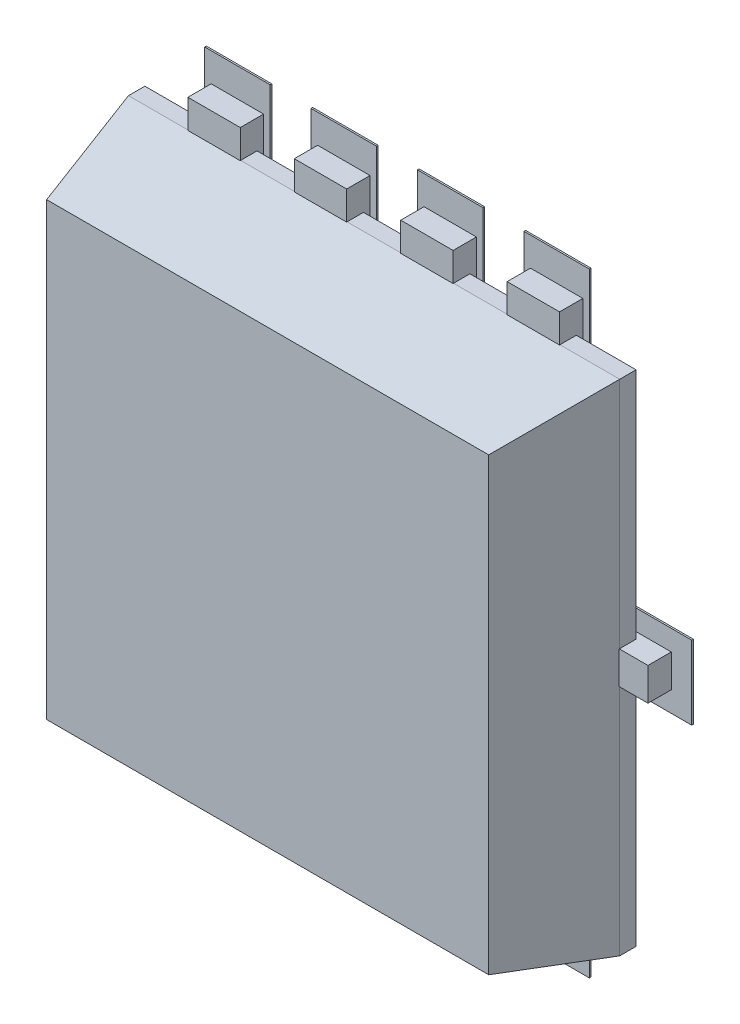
ISO-10303-21;
HEADER;
FILE_DESCRIPTION(('STEP AP214'),'2;1');
FILE_NAME('part.step','',(''),(''),'','','');
FILE_SCHEMA(('AUTOMOTIVE_DESIGN { 1 0 10303 214 1 1 1 1 }'));
ENDSEC;
DATA;
#1=APPLICATION_CONTEXT('core data for automotive mechanical design processes');
#2=APPLICATION_PROTOCOL_DEFINITION('international standard','automotive_design',2000,#1);
#3=PRODUCT_CONTEXT('',#1,'mechanical');
#4=PRODUCT('Part','Part','',(#3));
#5=PRODUCT_RELATED_PRODUCT_CATEGORY('part','',(#4));
#6=PRODUCT_DEFINITION_FORMATION('','',#4);
#7=PRODUCT_DEFINITION_CONTEXT('part definition',#1,'design');
#8=PRODUCT_DEFINITION('design','',#6,#7);
#9=PRODUCT_DEFINITION_SHAPE('','',#8);
#10=(LENGTH_UNIT() NAMED_UNIT(*) SI_UNIT(.MILLI.,.METRE.));
#11=(NAMED_UNIT(*) PLANE_ANGLE_UNIT() SI_UNIT($,.RADIAN.));
#12=(NAMED_UNIT(*) SI_UNIT($,.STERADIAN.) SOLID_ANGLE_UNIT());
#13=UNCERTAINTY_MEASURE_WITH_UNIT(LENGTH_MEASURE(1.E-05),#10,'distance_accuracy_value','');
#14=(GEOMETRIC_REPRESENTATION_CONTEXT(3) GLOBAL_UNCERTAINTY_ASSIGNED_CONTEXT((#13)) GLOBAL_UNIT_ASSIGNED_CONTEXT((#10,
#11,#12)) REPRESENTATION_CONTEXT('',''));
#15=CARTESIAN_POINT('',(0.,0.,0.));
#16=DIRECTION('',(0.,0.,1.));
#17=DIRECTION('',(1.,0.,0.));
#18=AXIS2_PLACEMENT_3D('',#15,#16,#17);
#19=CARTESIAN_POINT('',(-1.17500000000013,1.87500000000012,0.0762));
#20=DIRECTION('',(-1.,0.,0.));
#21=DIRECTION('',(0.,0.,1.));
#22=AXIS2_PLACEMENT_3D('',#19,#20,#21);
#23=PLANE('',#22);
#24=DIRECTION('',(0.,0.,1.));
#25=VECTOR('',#24,1.);
#26=CARTESIAN_POINT('',(-1.17500000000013,1.87500000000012,0.0762));
#27=LINE('',#26,#25);
#28=CARTESIAN_POINT('',(-1.17500000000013,1.87500000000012,0.0762));
#29=VERTEX_POINT('',#28);
#30=CARTESIAN_POINT('',(-1.17500000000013,1.87500000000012,0.0862000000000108));
#31=VERTEX_POINT('',#30);
#32=EDGE_CURVE('E888',#29,#31,#27,.T.);
#33=ORIENTED_EDGE('',*,*,#32,.F.);
#34=DIRECTION('',(0.,1.,0.));
#35=VECTOR('',#34,1.);
#36=CARTESIAN_POINT('',(-1.17500000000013,0.,0.0762));
#37=LINE('',#36,#35);
#38=CARTESIAN_POINT('',(-1.17500000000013,1.34999999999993,0.0762));
#39=VERTEX_POINT('',#38);
#40=EDGE_CURVE('E1042',#29,#39,#37,.F.);
#41=ORIENTED_EDGE('',*,*,#40,.T.);
#42=DIRECTION('',(0.,0.,1.));
#43=VECTOR('',#42,1.);
#44=CARTESIAN_POINT('',(-1.17500000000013,1.34999999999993,0.0762));
#45=LINE('',#44,#43);
#46=CARTESIAN_POINT('',(-1.17500000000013,1.34999999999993,0.0862000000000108));
#47=VERTEX_POINT('',#46);
#48=EDGE_CURVE('E917',#47,#39,#45,.F.);
#49=ORIENTED_EDGE('',*,*,#48,.F.);
#50=DIRECTION('',(0.,1.,0.));
#51=VECTOR('',#50,1.);
#52=CARTESIAN_POINT('',(-1.17500000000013,0.,0.0862000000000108));
#53=LINE('',#52,#51);
#54=EDGE_CURVE('E1007',#31,#47,#53,.F.);
#55=ORIENTED_EDGE('',*,*,#54,.F.);
#56=EDGE_LOOP('',(#33,#41,#49,#55));
#57=FACE_BOUND('',#56,.T.);
#58=ADVANCED_FACE('F16',(#57),#23,.T.);
#59=CARTESIAN_POINT('',(-1.17500000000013,1.34999999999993,0.0762));
#60=DIRECTION('',(0.,1.,0.));
#61=DIRECTION('',(0.,0.,1.));
#62=AXIS2_PLACEMENT_3D('',#59,#60,#61);
#63=PLANE('',#62);
#64=ORIENTED_EDGE('',*,*,#48,.T.);
#65=DIRECTION('',(1.,0.,0.));
#66=VECTOR('',#65,1.);
#67=CARTESIAN_POINT('',(0.,1.34999999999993,0.0762));
#68=LINE('',#67,#66);
#69=CARTESIAN_POINT('',(-1.34499999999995,1.34999999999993,0.0762));
#70=VERTEX_POINT('',#69);
#71=EDGE_CURVE('E1044',#39,#70,#68,.F.);
#72=ORIENTED_EDGE('',*,*,#71,.T.);
#73=DIRECTION('',(0.,0.,1.));
#74=VECTOR('',#73,1.);
#75=CARTESIAN_POINT('',(-1.34499999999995,1.34999999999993,0.0762));
#76=LINE('',#75,#74);
#77=CARTESIAN_POINT('',(-1.34499999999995,1.34999999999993,0.0862000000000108));
#78=VERTEX_POINT('',#77);
#79=EDGE_CURVE('E920',#78,#70,#76,.F.);
#80=ORIENTED_EDGE('',*,*,#79,.F.);
#81=DIRECTION('',(1.,0.,0.));
#82=VECTOR('',#81,1.);
#83=CARTESIAN_POINT('',(0.,1.34999999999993,0.0862000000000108));
#84=LINE('',#83,#82);
#85=EDGE_CURVE('E1010',#47,#78,#84,.F.);
#86=ORIENTED_EDGE('',*,*,#85,.F.);
#87=EDGE_LOOP('',(#64,#72,#80,#86));
#88=FACE_BOUND('',#87,.T.);
#89=ADVANCED_FACE('F2255',(#88),#63,.T.);
#90=CARTESIAN_POINT('',(-1.34499999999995,1.34999999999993,0.0762));
#91=DIRECTION('',(-1.,0.,0.));
#92=DIRECTION('',(0.,0.,1.));
#93=AXIS2_PLACEMENT_3D('',#90,#91,#92);
#94=PLANE('',#93);
#95=ORIENTED_EDGE('',*,*,#79,.T.);
#96=DIRECTION('',(0.,1.,0.));
#97=VECTOR('',#96,1.);
#98=CARTESIAN_POINT('',(-1.34499999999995,0.,0.0762));
#99=LINE('',#98,#97);
#100=CARTESIAN_POINT('',(-1.34499999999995,0.224999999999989,0.0762));
#101=VERTEX_POINT('',#100);
#102=EDGE_CURVE('E1046',#70,#101,#99,.F.);
#103=ORIENTED_EDGE('',*,*,#102,.T.);
#104=DIRECTION('',(0.,0.,1.));
#105=VECTOR('',#104,1.);
#106=CARTESIAN_POINT('',(-1.34499999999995,0.224999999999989,0.0762));
#107=LINE('',#106,#105);
#108=CARTESIAN_POINT('',(-1.34499999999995,0.224999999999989,0.0862000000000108));
#109=VERTEX_POINT('',#108);
#110=EDGE_CURVE('E923',#109,#101,#107,.F.);
#111=ORIENTED_EDGE('',*,*,#110,.F.);
#112=DIRECTION('',(0.,1.,0.));
#113=VECTOR('',#112,1.);
#114=CARTESIAN_POINT('',(-1.34499999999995,0.,0.0862000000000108));
#115=LINE('',#114,#113);
#116=EDGE_CURVE('E1013',#78,#109,#115,.F.);
#117=ORIENTED_EDGE('',*,*,#116,.F.);
#118=EDGE_LOOP('',(#95,#103,#111,#117));
#119=FACE_BOUND('',#118,.T.);
#120=ADVANCED_FACE('F2251',(#119),#94,.T.);
#121=CARTESIAN_POINT('',(-1.34499999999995,0.224999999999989,0.0762));
#122=DIRECTION('',(0.,1.,0.));
#123=DIRECTION('',(0.,0.,1.));
#124=AXIS2_PLACEMENT_3D('',#121,#122,#123);
#125=PLANE('',#124);
#126=ORIENTED_EDGE('',*,*,#110,.T.);
#127=DIRECTION('',(1.,0.,0.));
#128=VECTOR('',#127,1.);
#129=CARTESIAN_POINT('',(0.,0.224999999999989,0.0762));
#130=LINE('',#129,#128);
#131=CARTESIAN_POINT('',(-1.79999999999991,0.224999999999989,0.0762));
#132=VERTEX_POINT('',#131);
#133=EDGE_CURVE('E1048',#101,#132,#130,.F.);
#134=ORIENTED_EDGE('',*,*,#133,.T.);
#135=DIRECTION('',(0.,0.,1.));
#136=VECTOR('',#135,1.);
#137=CARTESIAN_POINT('',(-1.79999999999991,0.224999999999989,0.0762));
#138=LINE('',#137,#136);
#139=CARTESIAN_POINT('',(-1.79999999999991,0.224999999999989,0.0862000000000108));
#140=VERTEX_POINT('',#139);
#141=EDGE_CURVE('E811',#140,#132,#138,.F.);
#142=ORIENTED_EDGE('',*,*,#141,.F.);
#143=DIRECTION('',(1.,0.,0.));
#144=VECTOR('',#143,1.);
#145=CARTESIAN_POINT('',(0.,0.224999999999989,0.0862000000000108));
#146=LINE('',#145,#144);
#147=EDGE_CURVE('E1016',#109,#140,#146,.F.);
#148=ORIENTED_EDGE('',*,*,#147,.F.);
#149=EDGE_LOOP('',(#126,#134,#142,#148));
#150=FACE_BOUND('',#149,.T.);
#151=ADVANCED_FACE('F2246',(#150),#125,.T.);
#152=CARTESIAN_POINT('',(-1.79999999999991,0.224999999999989,0.0762));
#153=DIRECTION('',(-1.,0.,0.));
#154=DIRECTION('',(0.,0.,1.));
#155=AXIS2_PLACEMENT_3D('',#152,#153,#154);
#156=PLANE('',#155);
#157=ORIENTED_EDGE('',*,*,#141,.T.);
#158=DIRECTION('',(0.,1.,0.));
#159=VECTOR('',#158,1.);
#160=CARTESIAN_POINT('',(-1.79999999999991,0.,0.0762));
#161=LINE('',#160,#159);
#162=CARTESIAN_POINT('',(-1.79999999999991,-0.224999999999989,0.0762));
#163=VERTEX_POINT('',#162);
#164=EDGE_CURVE('E1050',#132,#163,#161,.F.);
#165=ORIENTED_EDGE('',*,*,#164,.T.);
#166=DIRECTION('',(0.,0.,-1.));
#167=VECTOR('',#166,1.);
#168=CARTESIAN_POINT('',(-1.79999999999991,-0.224999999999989,0.0762));
#169=LINE('',#168,#167);
#170=CARTESIAN_POINT('',(-1.79999999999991,-0.224999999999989,0.0862000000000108));
#171=VERTEX_POINT('',#170);
#172=EDGE_CURVE('E878',#171,#163,#169,.T.);
#173=ORIENTED_EDGE('',*,*,#172,.F.);
#174=DIRECTION('',(0.,1.,0.));
#175=VECTOR('',#174,1.);
#176=CARTESIAN_POINT('',(-1.79999999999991,0.,0.0862000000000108));
#177=LINE('',#176,#175);
#178=EDGE_CURVE('E1019',#140,#171,#177,.F.);
#179=ORIENTED_EDGE('',*,*,#178,.F.);
#180=EDGE_LOOP('',(#157,#165,#173,#179));
#181=FACE_BOUND('',#180,.T.);
#182=ADVANCED_FACE('F2243',(#181),#156,.T.);
#183=CARTESIAN_POINT('',(1.34499999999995,-0.224999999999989,0.0762));
#184=DIRECTION('',(0.,-1.,0.));
#185=DIRECTION('',(0.,0.,-1.));
#186=AXIS2_PLACEMENT_3D('',#183,#184,#185);
#187=PLANE('',#186);
#188=DIRECTION('',(0.,0.,-1.));
#189=VECTOR('',#188,1.);
#190=CARTESIAN_POINT('',(1.34499999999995,-0.224999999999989,0.0762));
#191=LINE('',#190,#189);
#192=CARTESIAN_POINT('',(1.34499999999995,-0.224999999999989,0.0762));
#193=VERTEX_POINT('',#192);
#194=CARTESIAN_POINT('',(1.34499999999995,-0.224999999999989,0.0862000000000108));
#195=VERTEX_POINT('',#194);
#196=EDGE_CURVE('E873',#193,#195,#191,.F.);
#197=ORIENTED_EDGE('',*,*,#196,.F.);
#198=DIRECTION('',(1.,0.,0.));
#199=VECTOR('',#198,1.);
#200=CARTESIAN_POINT('',(0.,-0.224999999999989,0.0762));
#201=LINE('',#200,#199);
#202=CARTESIAN_POINT('',(1.79999999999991,-0.224999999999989,0.0762));
#203=VERTEX_POINT('',#202);
#204=EDGE_CURVE('E797',#193,#203,#201,.T.);
#205=ORIENTED_EDGE('',*,*,#204,.T.);
#206=DIRECTION('',(0.,0.,-1.));
#207=VECTOR('',#206,1.);
#208=CARTESIAN_POINT('',(1.79999999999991,-0.224999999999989,0.0762));
#209=LINE('',#208,#207);
#210=CARTESIAN_POINT('',(1.79999999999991,-0.224999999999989,0.0862000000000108));
#211=VERTEX_POINT('',#210);
#212=EDGE_CURVE('E807',#211,#203,#209,.T.);
#213=ORIENTED_EDGE('',*,*,#212,.F.);
#214=DIRECTION('',(1.,0.,0.));
#215=VECTOR('',#214,1.);
#216=CARTESIAN_POINT('',(0.,-0.224999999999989,0.0862000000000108));
#217=LINE('',#216,#215);
#218=EDGE_CURVE('E818',#195,#211,#217,.T.);
#219=ORIENTED_EDGE('',*,*,#218,.F.);
#220=EDGE_LOOP('',(#197,#205,#213,#219));
#221=FACE_BOUND('',#220,.T.);
#222=ADVANCED_FACE('F2336',(#221),#187,.T.);
#223=CARTESIAN_POINT('',(1.79999999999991,-0.224999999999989,0.0762));
#224=DIRECTION('',(1.,0.,0.));
#225=DIRECTION('',(0.,0.,-1.));
#226=AXIS2_PLACEMENT_3D('',#223,#224,#225);
#227=PLANE('',#226);
#228=ORIENTED_EDGE('',*,*,#212,.T.);
#229=DIRECTION('',(0.,1.,0.));
#230=VECTOR('',#229,1.);
#231=CARTESIAN_POINT('',(1.79999999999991,0.,0.0762));
#232=LINE('',#231,#230);
#233=CARTESIAN_POINT('',(1.79999999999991,0.224999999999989,0.0762));
#234=VERTEX_POINT('',#233);
#235=EDGE_CURVE('E802',#203,#234,#232,.T.);
#236=ORIENTED_EDGE('',*,*,#235,.T.);
#237=DIRECTION('',(0.,0.,1.));
#238=VECTOR('',#237,1.);
#239=CARTESIAN_POINT('',(1.79999999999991,0.224999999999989,0.0762));
#240=LINE('',#239,#238);
#241=CARTESIAN_POINT('',(1.79999999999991,0.224999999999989,0.0862000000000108));
#242=VERTEX_POINT('',#241);
#243=EDGE_CURVE('E810',#242,#234,#240,.F.);
#244=ORIENTED_EDGE('',*,*,#243,.F.);
#245=DIRECTION('',(0.,1.,0.));
#246=VECTOR('',#245,1.);
#247=CARTESIAN_POINT('',(1.79999999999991,0.,0.0862000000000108));
#248=LINE('',#247,#246);
#249=EDGE_CURVE('E814',#211,#242,#248,.T.);
#250=ORIENTED_EDGE('',*,*,#249,.F.);
#251=EDGE_LOOP('',(#228,#236,#244,#250));
#252=FACE_BOUND('',#251,.T.);
#253=ADVANCED_FACE('F2334',(#252),#227,.T.);
#254=CARTESIAN_POINT('',(1.79999999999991,0.224999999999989,0.0762));
#255=DIRECTION('',(0.,1.,0.));
#256=DIRECTION('',(0.,0.,1.));
#257=AXIS2_PLACEMENT_3D('',#254,#255,#256);
#258=PLANE('',#257);
#259=ORIENTED_EDGE('',*,*,#243,.T.);
#260=DIRECTION('',(1.,0.,0.));
#261=VECTOR('',#260,1.);
#262=CARTESIAN_POINT('',(0.,0.224999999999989,0.0762));
#263=LINE('',#262,#261);
#264=CARTESIAN_POINT('',(1.34499999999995,0.224999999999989,0.0762));
#265=VERTEX_POINT('',#264);
#266=EDGE_CURVE('E804',#234,#265,#263,.F.);
#267=ORIENTED_EDGE('',*,*,#266,.T.);
#268=DIRECTION('',(0.,0.,-1.));
#269=VECTOR('',#268,1.);
#270=CARTESIAN_POINT('',(1.34499999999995,0.224999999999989,0.0762));
#271=LINE('',#270,#269);
#272=CARTESIAN_POINT('',(1.34499999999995,0.224999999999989,0.0862000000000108));
#273=VERTEX_POINT('',#272);
#274=EDGE_CURVE('E946',#273,#265,#271,.T.);
#275=ORIENTED_EDGE('',*,*,#274,.F.);
#276=DIRECTION('',(1.,0.,0.));
#277=VECTOR('',#276,1.);
#278=CARTESIAN_POINT('',(0.,0.224999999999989,0.0862000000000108));
#279=LINE('',#278,#277);
#280=EDGE_CURVE('E817',#242,#273,#279,.F.);
#281=ORIENTED_EDGE('',*,*,#280,.F.);
#282=EDGE_LOOP('',(#259,#267,#275,#281));
#283=FACE_BOUND('',#282,.T.);
#284=ADVANCED_FACE('F2330',(#283),#258,.T.);
#285=CARTESIAN_POINT('',(1.34499999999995,0.224999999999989,0.0762));
#286=DIRECTION('',(1.,0.,0.));
#287=DIRECTION('',(0.,0.,-1.));
#288=AXIS2_PLACEMENT_3D('',#285,#286,#287);
#289=PLANE('',#288);
#290=ORIENTED_EDGE('',*,*,#274,.T.);
#291=DIRECTION('',(0.,1.,0.));
#292=VECTOR('',#291,1.);
#293=CARTESIAN_POINT('',(1.34499999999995,0.,0.0762));
#294=LINE('',#293,#292);
#295=CARTESIAN_POINT('',(1.34499999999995,1.34999999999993,0.0762));
#296=VERTEX_POINT('',#295);
#297=EDGE_CURVE('E1056',#265,#296,#294,.T.);
#298=ORIENTED_EDGE('',*,*,#297,.T.);
#299=DIRECTION('',(0.,0.,1.));
#300=VECTOR('',#299,1.);
#301=CARTESIAN_POINT('',(1.34499999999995,1.34999999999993,0.0762));
#302=LINE('',#301,#300);
#303=CARTESIAN_POINT('',(1.34499999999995,1.34999999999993,0.0862000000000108));
#304=VERTEX_POINT('',#303);
#305=EDGE_CURVE('E949',#304,#296,#302,.F.);
#306=ORIENTED_EDGE('',*,*,#305,.F.);
#307=DIRECTION('',(0.,1.,0.));
#308=VECTOR('',#307,1.);
#309=CARTESIAN_POINT('',(1.34499999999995,0.,0.0862000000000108));
#310=LINE('',#309,#308);
#311=EDGE_CURVE('E959',#273,#304,#310,.T.);
#312=ORIENTED_EDGE('',*,*,#311,.F.);
#313=EDGE_LOOP('',(#290,#298,#306,#312));
#314=FACE_BOUND('',#313,.T.);
#315=ADVANCED_FACE('F2325',(#314),#289,.T.);
#316=CARTESIAN_POINT('',(1.34499999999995,1.34999999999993,0.0762));
#317=DIRECTION('',(0.,1.,0.));
#318=DIRECTION('',(0.,0.,1.));
#319=AXIS2_PLACEMENT_3D('',#316,#317,#318);
#320=PLANE('',#319);
#321=ORIENTED_EDGE('',*,*,#305,.T.);
#322=DIRECTION('',(1.,0.,0.));
#323=VECTOR('',#322,1.);
#324=CARTESIAN_POINT('',(0.,1.34999999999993,0.0762));
#325=LINE('',#324,#323);
#326=CARTESIAN_POINT('',(1.17500000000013,1.34999999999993,0.0762));
#327=VERTEX_POINT('',#326);
#328=EDGE_CURVE('E1058',#296,#327,#325,.F.);
#329=ORIENTED_EDGE('',*,*,#328,.T.);
#330=DIRECTION('',(0.,0.,-1.));
#331=VECTOR('',#330,1.);
#332=CARTESIAN_POINT('',(1.17500000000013,1.34999999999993,0.0762));
#333=LINE('',#332,#331);
#334=CARTESIAN_POINT('',(1.17500000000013,1.34999999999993,0.0862000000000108));
#335=VERTEX_POINT('',#334);
#336=EDGE_CURVE('E952',#335,#327,#333,.T.);
#337=ORIENTED_EDGE('',*,*,#336,.F.);
#338=DIRECTION('',(1.,0.,0.));
#339=VECTOR('',#338,1.);
#340=CARTESIAN_POINT('',(0.,1.34999999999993,0.0862000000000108));
#341=LINE('',#340,#339);
#342=EDGE_CURVE('E962',#304,#335,#341,.F.);
#343=ORIENTED_EDGE('',*,*,#342,.F.);
#344=EDGE_LOOP('',(#321,#329,#337,#343));
#345=FACE_BOUND('',#344,.T.);
#346=ADVANCED_FACE('F2322',(#345),#320,.T.);
#347=CARTESIAN_POINT('',(1.17500000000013,1.34999999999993,0.0762));
#348=DIRECTION('',(1.,0.,0.));
#349=DIRECTION('',(0.,0.,-1.));
#350=AXIS2_PLACEMENT_3D('',#347,#348,#349);
#351=PLANE('',#350);
#352=ORIENTED_EDGE('',*,*,#336,.T.);
#353=DIRECTION('',(0.,1.,0.));
#354=VECTOR('',#353,1.);
#355=CARTESIAN_POINT('',(1.17500000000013,0.,0.0762));
#356=LINE('',#355,#354);
#357=CARTESIAN_POINT('',(1.17500000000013,1.87500000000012,0.0762));
#358=VERTEX_POINT('',#357);
#359=EDGE_CURVE('E1060',#327,#358,#356,.T.);
#360=ORIENTED_EDGE('',*,*,#359,.T.);
#361=DIRECTION('',(0.,0.,1.));
#362=VECTOR('',#361,1.);
#363=CARTESIAN_POINT('',(1.17500000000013,1.87500000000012,0.0762));
#364=LINE('',#363,#362);
#365=CARTESIAN_POINT('',(1.17500000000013,1.87500000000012,0.0862000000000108));
#366=VERTEX_POINT('',#365);
#367=EDGE_CURVE('E990',#366,#358,#364,.F.);
#368=ORIENTED_EDGE('',*,*,#367,.F.);
#369=DIRECTION('',(0.,1.,0.));
#370=VECTOR('',#369,1.);
#371=CARTESIAN_POINT('',(1.17500000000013,0.,0.0862000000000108));
#372=LINE('',#371,#370);
#373=EDGE_CURVE('E965',#335,#366,#372,.T.);
#374=ORIENTED_EDGE('',*,*,#373,.F.);
#375=EDGE_LOOP('',(#352,#360,#368,#374));
#376=FACE_BOUND('',#375,.T.);
#377=ADVANCED_FACE('F2318',(#376),#351,.T.);
#378=CARTESIAN_POINT('',(-1.79999999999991,-0.224999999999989,0.0762));
#379=DIRECTION('',(0.,-1.,0.));
#380=DIRECTION('',(0.,0.,-1.));
#381=AXIS2_PLACEMENT_3D('',#378,#379,#380);
#382=PLANE('',#381);
#383=ORIENTED_EDGE('',*,*,#172,.T.);
#384=DIRECTION('',(1.,0.,0.));
#385=VECTOR('',#384,1.);
#386=CARTESIAN_POINT('',(0.,-0.224999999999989,0.0762));
#387=LINE('',#386,#385);
#388=CARTESIAN_POINT('',(-1.34499999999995,-0.224999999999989,0.0762));
#389=VERTEX_POINT('',#388);
#390=EDGE_CURVE('E774',#163,#389,#387,.T.);
#391=ORIENTED_EDGE('',*,*,#390,.T.);
#392=DIRECTION('',(0.,0.,1.));
#393=VECTOR('',#392,1.);
#394=CARTESIAN_POINT('',(-1.34499999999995,-0.224999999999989,0.0762));
#395=LINE('',#394,#393);
#396=CARTESIAN_POINT('',(-1.34499999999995,-0.224999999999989,0.0862000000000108));
#397=VERTEX_POINT('',#396);
#398=EDGE_CURVE('E894',#397,#389,#395,.F.);
#399=ORIENTED_EDGE('',*,*,#398,.F.);
#400=DIRECTION('',(1.,0.,0.));
#401=VECTOR('',#400,1.);
#402=CARTESIAN_POINT('',(0.,-0.224999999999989,0.0862000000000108));
#403=LINE('',#402,#401);
#404=EDGE_CURVE('E916',#171,#397,#403,.T.);
#405=ORIENTED_EDGE('',*,*,#404,.F.);
#406=EDGE_LOOP('',(#383,#391,#399,#405));
#407=FACE_BOUND('',#406,.T.);
#408=ADVANCED_FACE('F2240',(#407),#382,.T.);
#409=CARTESIAN_POINT('',(0.,0.,0.0862000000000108));
#410=DIRECTION('',(0.,0.,1.));
#411=DIRECTION('',(1.,0.,0.));
#412=AXIS2_PLACEMENT_3D('',#409,#410,#411);
#413=PLANE('',#412);
#414=DIRECTION('',(1.,0.,0.));
#415=VECTOR('',#414,1.);
#416=CARTESIAN_POINT('',(0.,-0.100000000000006,0.0862000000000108));
#417=LINE('',#416,#415);
#418=CARTESIAN_POINT('',(1.6749999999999,-0.100000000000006,0.0862000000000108));
#419=VERTEX_POINT('',#418);
#420=CARTESIAN_POINT('',(1.13500000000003,-0.100000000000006,0.0862000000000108));
#421=VERTEX_POINT('',#420);
#422=EDGE_CURVE('E849',#419,#421,#417,.F.);
#423=ORIENTED_EDGE('',*,*,#422,.T.);
#424=DIRECTION('',(0.,1.,0.));
#425=VECTOR('',#424,1.);
#426=CARTESIAN_POINT('',(1.13500000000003,0.,0.0862000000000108));
#427=LINE('',#426,#425);
#428=CARTESIAN_POINT('',(1.13500000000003,-0.59899999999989,0.0862000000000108));
#429=VERTEX_POINT('',#428);
#430=EDGE_CURVE('E861',#421,#429,#427,.F.);
#431=ORIENTED_EDGE('',*,*,#430,.T.);
#432=DIRECTION('',(1.,0.,0.));
#433=VECTOR('',#432,1.);
#434=CARTESIAN_POINT('',(0.,-0.59899999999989,0.0862000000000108));
#435=LINE('',#434,#433);
#436=CARTESIAN_POINT('',(1.34499999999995,-0.59899999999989,0.0862000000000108));
#437=VERTEX_POINT('',#436);
#438=EDGE_CURVE('E876',#429,#437,#435,.T.);
#439=ORIENTED_EDGE('',*,*,#438,.T.);
#440=DIRECTION('',(0.,1.,0.));
#441=VECTOR('',#440,1.);
#442=CARTESIAN_POINT('',(1.34499999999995,-0.59899999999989,0.0862000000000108));
#443=LINE('',#442,#441);
#444=EDGE_CURVE('E885',#195,#437,#443,.F.);
#445=ORIENTED_EDGE('',*,*,#444,.F.);
#446=ORIENTED_EDGE('',*,*,#218,.T.);
#447=ORIENTED_EDGE('',*,*,#249,.T.);
#448=ORIENTED_EDGE('',*,*,#280,.T.);
#449=ORIENTED_EDGE('',*,*,#311,.T.);
#450=ORIENTED_EDGE('',*,*,#342,.T.);
#451=ORIENTED_EDGE('',*,*,#373,.T.);
#452=DIRECTION('',(1.,0.,0.));
#453=VECTOR('',#452,1.);
#454=CARTESIAN_POINT('',(1.17500000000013,1.87500000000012,0.0862000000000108));
#455=LINE('',#454,#453);
#456=CARTESIAN_POINT('',(0.774999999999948,1.87500000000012,0.0862000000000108));
#457=VERTEX_POINT('',#456);
#458=EDGE_CURVE('E987',#457,#366,#455,.T.);
#459=ORIENTED_EDGE('',*,*,#458,.F.);
#460=DIRECTION('',(0.,1.,0.));
#461=VECTOR('',#460,1.);
#462=CARTESIAN_POINT('',(0.774999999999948,0.,0.0862000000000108));
#463=LINE('',#462,#461);
#464=CARTESIAN_POINT('',(0.774999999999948,1.34999999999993,0.0862000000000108));
#465=VERTEX_POINT('',#464);
#466=EDGE_CURVE('E967',#457,#465,#463,.F.);
#467=ORIENTED_EDGE('',*,*,#466,.T.);
#468=DIRECTION('',(1.,0.,0.));
#469=VECTOR('',#468,1.);
#470=CARTESIAN_POINT('',(0.,1.34999999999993,0.0862000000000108));
#471=LINE('',#470,#469);
#472=CARTESIAN_POINT('',(0.815000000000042,1.34999999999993,0.0862000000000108));
#473=VERTEX_POINT('',#472);
#474=EDGE_CURVE('E970',#465,#473,#471,.T.);
#475=ORIENTED_EDGE('',*,*,#474,.T.);
#476=DIRECTION('',(0.,1.,0.));
#477=VECTOR('',#476,1.);
#478=CARTESIAN_POINT('',(0.815000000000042,0.,0.0862000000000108));
#479=LINE('',#478,#477);
#480=CARTESIAN_POINT('',(0.815000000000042,1.70000000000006,0.0862000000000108));
#481=VERTEX_POINT('',#480);
#482=EDGE_CURVE('E973',#473,#481,#479,.T.);
#483=ORIENTED_EDGE('',*,*,#482,.T.);
#484=DIRECTION('',(1.,0.,0.));
#485=VECTOR('',#484,1.);
#486=CARTESIAN_POINT('',(0.,1.70000000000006,0.0862000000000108));
#487=LINE('',#486,#485);
#488=CARTESIAN_POINT('',(1.13500000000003,1.70000000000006,0.0862000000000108));
#489=VERTEX_POINT('',#488);
#490=EDGE_CURVE('E837',#481,#489,#487,.T.);
#491=ORIENTED_EDGE('',*,*,#490,.T.);
#492=DIRECTION('',(0.,1.,0.));
#493=VECTOR('',#492,1.);
#494=CARTESIAN_POINT('',(1.13500000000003,0.100000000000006,0.0862000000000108));
#495=LINE('',#494,#493);
#496=CARTESIAN_POINT('',(1.13500000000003,0.100000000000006,0.0862000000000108));
#497=VERTEX_POINT('',#496);
#498=EDGE_CURVE('E824',#497,#489,#495,.T.);
#499=ORIENTED_EDGE('',*,*,#498,.F.);
#500=DIRECTION('',(1.,0.,0.));
#501=VECTOR('',#500,1.);
#502=CARTESIAN_POINT('',(0.,0.100000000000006,0.0862000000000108));
#503=LINE('',#502,#501);
#504=CARTESIAN_POINT('',(1.6749999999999,0.100000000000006,0.0862000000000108));
#505=VERTEX_POINT('',#504);
#506=EDGE_CURVE('E833',#497,#505,#503,.T.);
#507=ORIENTED_EDGE('',*,*,#506,.T.);
#508=DIRECTION('',(0.,1.,0.));
#509=VECTOR('',#508,1.);
#510=CARTESIAN_POINT('',(1.6749999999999,0.,0.0862000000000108));
#511=LINE('',#510,#509);
#512=EDGE_CURVE('E836',#505,#419,#511,.F.);
#513=ORIENTED_EDGE('',*,*,#512,.T.);
#514=EDGE_LOOP('',(#423,#431,#439,#445,#446,#447,#448,#449,#450,#451,#459,#467,#475,#483,#491,
#499,#507,#513));
#515=FACE_BOUND('',#514,.T.);
#516=ADVANCED_FACE('F2347',(#515),#413,.T.);
#517=CARTESIAN_POINT('',(1.34499999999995,-0.59899999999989,0.0762));
#518=DIRECTION('',(1.,0.,0.));
#519=DIRECTION('',(0.,0.,-1.));
#520=AXIS2_PLACEMENT_3D('',#517,#518,#519);
#521=PLANE('',#520);
#522=DIRECTION('',(0.,0.,-1.));
#523=VECTOR('',#522,1.);
#524=CARTESIAN_POINT('',(1.34499999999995,-0.59899999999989,0.0762));
#525=LINE('',#524,#523);
#526=CARTESIAN_POINT('',(1.34499999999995,-0.59899999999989,0.0762));
#527=VERTEX_POINT('',#526);
#528=EDGE_CURVE('E980',#527,#437,#525,.F.);
#529=ORIENTED_EDGE('',*,*,#528,.F.);
#530=DIRECTION('',(0.,1.,0.));
#531=VECTOR('',#530,1.);
#532=CARTESIAN_POINT('',(1.34499999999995,0.,0.0762));
#533=LINE('',#532,#531);
#534=EDGE_CURVE('E791',#527,#193,#533,.T.);
#535=ORIENTED_EDGE('',*,*,#534,.T.);
#536=ORIENTED_EDGE('',*,*,#196,.T.);
#537=ORIENTED_EDGE('',*,*,#444,.T.);
#538=EDGE_LOOP('',(#529,#535,#536,#537));
#539=FACE_BOUND('',#538,.T.);
#540=ADVANCED_FACE('F2341',(#539),#521,.T.);
#541=CARTESIAN_POINT('',(-0.774999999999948,1.87500000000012,0.0762));
#542=DIRECTION('',(0.,1.,0.));
#543=DIRECTION('',(0.,0.,1.));
#544=AXIS2_PLACEMENT_3D('',#541,#542,#543);
#545=PLANE('',#544);
#546=DIRECTION('',(0.,0.,-1.));
#547=VECTOR('',#546,1.);
#548=CARTESIAN_POINT('',(-0.774999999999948,1.87500000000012,0.0762));
#549=LINE('',#548,#547);
#550=CARTESIAN_POINT('',(-0.774999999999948,1.87500000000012,0.0762));
#551=VERTEX_POINT('',#550);
#552=CARTESIAN_POINT('',(-0.774999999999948,1.87500000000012,0.0862000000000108));
#553=VERTEX_POINT('',#552);
#554=EDGE_CURVE('E1096',#551,#553,#549,.F.);
#555=ORIENTED_EDGE('',*,*,#554,.F.);
#556=DIRECTION('',(1.,0.,0.));
#557=VECTOR('',#556,1.);
#558=CARTESIAN_POINT('',(0.,1.87500000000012,0.0762));
#559=LINE('',#558,#557);
#560=EDGE_CURVE('E1039',#551,#29,#559,.F.);
#561=ORIENTED_EDGE('',*,*,#560,.T.);
#562=ORIENTED_EDGE('',*,*,#32,.T.);
#563=DIRECTION('',(1.,0.,0.));
#564=VECTOR('',#563,1.);
#565=CARTESIAN_POINT('',(0.,1.87500000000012,0.0862000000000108));
#566=LINE('',#565,#564);
#567=EDGE_CURVE('E1004',#553,#31,#566,.F.);
#568=ORIENTED_EDGE('',*,*,#567,.F.);
#569=EDGE_LOOP('',(#555,#561,#562,#568));
#570=FACE_BOUND('',#569,.T.);
#571=ADVANCED_FACE('F2262',(#570),#545,.T.);
#572=CARTESIAN_POINT('',(1.17500000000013,1.87500000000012,0.0762));
#573=DIRECTION('',(0.,1.,0.));
#574=DIRECTION('',(0.,0.,1.));
#575=AXIS2_PLACEMENT_3D('',#572,#573,#574);
#576=PLANE('',#575);
#577=ORIENTED_EDGE('',*,*,#367,.T.);
#578=DIRECTION('',(1.,0.,0.));
#579=VECTOR('',#578,1.);
#580=CARTESIAN_POINT('',(0.,1.87500000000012,0.0762));
#581=LINE('',#580,#579);
#582=CARTESIAN_POINT('',(0.774999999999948,1.87500000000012,0.0762));
#583=VERTEX_POINT('',#582);
#584=EDGE_CURVE('E1062',#358,#583,#581,.F.);
#585=ORIENTED_EDGE('',*,*,#584,.T.);
#586=DIRECTION('',(0.,0.,1.));
#587=VECTOR('',#586,1.);
#588=CARTESIAN_POINT('',(0.774999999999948,1.87500000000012,0.0762));
#589=LINE('',#588,#587);
#590=EDGE_CURVE('E1123',#457,#583,#589,.F.);
#591=ORIENTED_EDGE('',*,*,#590,.F.);
#592=ORIENTED_EDGE('',*,*,#458,.T.);
#593=EDGE_LOOP('',(#577,#585,#591,#592));
#594=FACE_BOUND('',#593,.T.);
#595=ADVANCED_FACE('F2312',(#594),#576,.T.);
#596=CARTESIAN_POINT('',(0.,0.,0.0862000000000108));
#597=DIRECTION('',(0.,0.,1.));
#598=DIRECTION('',(1.,0.,0.));
#599=AXIS2_PLACEMENT_3D('',#596,#597,#598);
#600=PLANE('',#599);
#601=DIRECTION('',(1.,0.,0.));
#602=VECTOR('',#601,1.);
#603=CARTESIAN_POINT('',(0.,-0.100000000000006,0.0862000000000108));
#604=LINE('',#603,#602);
#605=CARTESIAN_POINT('',(-1.13500000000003,-0.100000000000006,0.0862000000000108));
#606=VERTEX_POINT('',#605);
#607=CARTESIAN_POINT('',(-1.6749999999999,-0.100000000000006,0.0862000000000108));
#608=VERTEX_POINT('',#607);
#609=EDGE_CURVE('E905',#606,#608,#604,.F.);
#610=ORIENTED_EDGE('',*,*,#609,.T.);
#611=DIRECTION('',(0.,1.,0.));
#612=VECTOR('',#611,1.);
#613=CARTESIAN_POINT('',(-1.6749999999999,0.,0.0862000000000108));
#614=LINE('',#613,#612);
#615=CARTESIAN_POINT('',(-1.6749999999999,0.100000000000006,0.0862000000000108));
#616=VERTEX_POINT('',#615);
#617=EDGE_CURVE('E908',#608,#616,#614,.T.);
#618=ORIENTED_EDGE('',*,*,#617,.T.);
#619=DIRECTION('',(1.,0.,0.));
#620=VECTOR('',#619,1.);
#621=CARTESIAN_POINT('',(0.,0.100000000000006,0.0862000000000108));
#622=LINE('',#621,#620);
#623=CARTESIAN_POINT('',(-1.13500000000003,0.100000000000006,0.0862000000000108));
#624=VERTEX_POINT('',#623);
#625=EDGE_CURVE('E993',#616,#624,#622,.T.);
#626=ORIENTED_EDGE('',*,*,#625,.T.);
#627=DIRECTION('',(0.,1.,0.));
#628=VECTOR('',#627,1.);
#629=CARTESIAN_POINT('',(-1.13500000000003,1.70000000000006,0.0862000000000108));
#630=LINE('',#629,#628);
#631=CARTESIAN_POINT('',(-1.13500000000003,1.70000000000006,0.0862000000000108));
#632=VERTEX_POINT('',#631);
#633=EDGE_CURVE('E1035',#632,#624,#630,.F.);
#634=ORIENTED_EDGE('',*,*,#633,.F.);
#635=DIRECTION('',(1.,0.,0.));
#636=VECTOR('',#635,1.);
#637=CARTESIAN_POINT('',(0.,1.70000000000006,0.0862000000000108));
#638=LINE('',#637,#636);
#639=CARTESIAN_POINT('',(-0.815000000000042,1.70000000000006,0.0862000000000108));
#640=VERTEX_POINT('',#639);
#641=EDGE_CURVE('E996',#632,#640,#638,.T.);
#642=ORIENTED_EDGE('',*,*,#641,.T.);
#643=DIRECTION('',(0.,1.,0.));
#644=VECTOR('',#643,1.);
#645=CARTESIAN_POINT('',(-0.815000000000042,0.,0.0862000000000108));
#646=LINE('',#645,#644);
#647=CARTESIAN_POINT('',(-0.815000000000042,1.34999999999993,0.0862000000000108));
#648=VERTEX_POINT('',#647);
#649=EDGE_CURVE('E999',#640,#648,#646,.F.);
#650=ORIENTED_EDGE('',*,*,#649,.T.);
#651=DIRECTION('',(1.,0.,0.));
#652=VECTOR('',#651,1.);
#653=CARTESIAN_POINT('',(0.,1.34999999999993,0.0862000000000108));
#654=LINE('',#653,#652);
#655=CARTESIAN_POINT('',(-0.774999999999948,1.34999999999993,0.0862000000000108));
#656=VERTEX_POINT('',#655);
#657=EDGE_CURVE('E1002',#648,#656,#654,.T.);
#658=ORIENTED_EDGE('',*,*,#657,.T.);
#659=DIRECTION('',(0.,1.,0.));
#660=VECTOR('',#659,1.);
#661=CARTESIAN_POINT('',(-0.774999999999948,1.34999999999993,0.0862000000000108));
#662=LINE('',#661,#660);
#663=EDGE_CURVE('E1099',#553,#656,#662,.F.);
#664=ORIENTED_EDGE('',*,*,#663,.F.);
#665=ORIENTED_EDGE('',*,*,#567,.T.);
#666=ORIENTED_EDGE('',*,*,#54,.T.);
#667=ORIENTED_EDGE('',*,*,#85,.T.);
#668=ORIENTED_EDGE('',*,*,#116,.T.);
#669=ORIENTED_EDGE('',*,*,#147,.T.);
#670=ORIENTED_EDGE('',*,*,#178,.T.);
#671=ORIENTED_EDGE('',*,*,#404,.T.);
#672=DIRECTION('',(0.,1.,0.));
#673=VECTOR('',#672,1.);
#674=CARTESIAN_POINT('',(-1.34499999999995,-0.224999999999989,0.0862000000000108));
#675=LINE('',#674,#673);
#676=CARTESIAN_POINT('',(-1.34499999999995,-0.59899999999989,0.0862000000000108));
#677=VERTEX_POINT('',#676);
#678=EDGE_CURVE('E891',#677,#397,#675,.T.);
#679=ORIENTED_EDGE('',*,*,#678,.F.);
#680=DIRECTION('',(1.,0.,0.));
#681=VECTOR('',#680,1.);
#682=CARTESIAN_POINT('',(0.,-0.59899999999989,0.0862000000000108));
#683=LINE('',#682,#681);
#684=CARTESIAN_POINT('',(-1.13500000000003,-0.59899999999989,0.0862000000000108));
#685=VERTEX_POINT('',#684);
#686=EDGE_CURVE('E912',#677,#685,#683,.T.);
#687=ORIENTED_EDGE('',*,*,#686,.T.);
#688=DIRECTION('',(0.,1.,0.));
#689=VECTOR('',#688,1.);
#690=CARTESIAN_POINT('',(-1.13500000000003,0.,0.0862000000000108));
#691=LINE('',#690,#689);
#692=EDGE_CURVE('E782',#685,#606,#691,.T.);
#693=ORIENTED_EDGE('',*,*,#692,.T.);
#694=EDGE_LOOP('',(#610,#618,#626,#634,#642,#650,#658,#664,#665,#666,#667,#668,#669,#670,#671,
#679,#687,#693));
#695=FACE_BOUND('',#694,.T.);
#696=ADVANCED_FACE('F1984',(#695),#600,.T.);
#697=CARTESIAN_POINT('',(0.,0.,0.0762));
#698=DIRECTION('',(0.,0.,1.));
#699=DIRECTION('',(1.,0.,0.));
#700=AXIS2_PLACEMENT_3D('',#697,#698,#699);
#701=PLANE('',#700);
#702=DIRECTION('',(1.,0.,0.));
#703=VECTOR('',#702,1.);
#704=CARTESIAN_POINT('',(0.524999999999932,1.87500000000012,0.0762));
#705=LINE('',#704,#703);
#706=CARTESIAN_POINT('',(0.524999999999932,1.87500000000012,0.0762));
#707=VERTEX_POINT('',#706);
#708=CARTESIAN_POINT('',(0.125000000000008,1.87500000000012,0.0762));
#709=VERTEX_POINT('',#708);
#710=EDGE_CURVE('E1115',#707,#709,#705,.F.);
#711=ORIENTED_EDGE('',*,*,#710,.F.);
#712=DIRECTION('',(0.,1.,0.));
#713=VECTOR('',#712,1.);
#714=CARTESIAN_POINT('',(0.524999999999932,1.34999999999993,0.0762));
#715=LINE('',#714,#713);
#716=CARTESIAN_POINT('',(0.524999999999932,1.34999999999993,0.0762));
#717=VERTEX_POINT('',#716);
#718=EDGE_CURVE('E1129',#717,#707,#715,.T.);
#719=ORIENTED_EDGE('',*,*,#718,.F.);
#720=DIRECTION('',(1.,0.,0.));
#721=VECTOR('',#720,1.);
#722=CARTESIAN_POINT('',(0.,1.34999999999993,0.0762));
#723=LINE('',#722,#721);
#724=CARTESIAN_POINT('',(0.774999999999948,1.34999999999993,0.0762));
#725=VERTEX_POINT('',#724);
#726=EDGE_CURVE('E895',#725,#717,#723,.F.);
#727=ORIENTED_EDGE('',*,*,#726,.F.);
#728=DIRECTION('',(0.,1.,0.));
#729=VECTOR('',#728,1.);
#730=CARTESIAN_POINT('',(0.774999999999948,1.87500000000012,0.0762));
#731=LINE('',#730,#729);
#732=EDGE_CURVE('E1126',#583,#725,#731,.F.);
#733=ORIENTED_EDGE('',*,*,#732,.F.);
#734=ORIENTED_EDGE('',*,*,#584,.F.);
#735=ORIENTED_EDGE('',*,*,#359,.F.);
#736=ORIENTED_EDGE('',*,*,#328,.F.);
#737=ORIENTED_EDGE('',*,*,#297,.F.);
#738=ORIENTED_EDGE('',*,*,#266,.F.);
#739=ORIENTED_EDGE('',*,*,#235,.F.);
#740=ORIENTED_EDGE('',*,*,#204,.F.);
#741=ORIENTED_EDGE('',*,*,#534,.F.);
#742=DIRECTION('',(1.,0.,0.));
#743=VECTOR('',#742,1.);
#744=CARTESIAN_POINT('',(-1.34499999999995,-0.59899999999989,0.0762));
#745=LINE('',#744,#743);
#746=CARTESIAN_POINT('',(1.13500000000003,-0.59899999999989,0.0762));
#747=VERTEX_POINT('',#746);
#748=EDGE_CURVE('E830',#747,#527,#745,.T.);
#749=ORIENTED_EDGE('',*,*,#748,.F.);
#750=DIRECTION('',(0.,1.,0.));
#751=VECTOR('',#750,1.);
#752=CARTESIAN_POINT('',(1.13500000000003,-0.599999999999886,0.0762));
#753=LINE('',#752,#751);
#754=CARTESIAN_POINT('',(1.13500000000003,-0.599999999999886,0.0762));
#755=VERTEX_POINT('',#754);
#756=EDGE_CURVE('E790',#755,#747,#753,.T.);
#757=ORIENTED_EDGE('',*,*,#756,.F.);
#758=DIRECTION('',(1.,0.,0.));
#759=VECTOR('',#758,1.);
#760=CARTESIAN_POINT('',(-1.13500000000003,-0.599999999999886,0.0762));
#761=LINE('',#760,#759);
#762=CARTESIAN_POINT('',(-1.13500000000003,-0.599999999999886,0.0762));
#763=VERTEX_POINT('',#762);
#764=EDGE_CURVE('E788',#763,#755,#761,.T.);
#765=ORIENTED_EDGE('',*,*,#764,.F.);
#766=DIRECTION('',(0.,1.,0.));
#767=VECTOR('',#766,1.);
#768=CARTESIAN_POINT('',(-1.13500000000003,-0.100000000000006,0.0762));
#769=LINE('',#768,#767);
#770=CARTESIAN_POINT('',(-1.13500000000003,-0.59899999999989,0.0762));
#771=VERTEX_POINT('',#770);
#772=EDGE_CURVE('E19',#771,#763,#769,.F.);
#773=ORIENTED_EDGE('',*,*,#772,.F.);
#774=DIRECTION('',(1.,0.,0.));
#775=VECTOR('',#774,1.);
#776=CARTESIAN_POINT('',(0.,-0.59899999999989,0.0762));
#777=LINE('',#776,#775);
#778=CARTESIAN_POINT('',(-1.34499999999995,-0.59899999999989,0.0762));
#779=VERTEX_POINT('',#778);
#780=EDGE_CURVE('E763',#779,#771,#777,.T.);
#781=ORIENTED_EDGE('',*,*,#780,.F.);
#782=DIRECTION('',(0.,1.,0.));
#783=VECTOR('',#782,1.);
#784=CARTESIAN_POINT('',(-1.34499999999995,-0.224999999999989,0.0762));
#785=LINE('',#784,#783);
#786=EDGE_CURVE('E934',#389,#779,#785,.F.);
#787=ORIENTED_EDGE('',*,*,#786,.F.);
#788=ORIENTED_EDGE('',*,*,#390,.F.);
#789=ORIENTED_EDGE('',*,*,#164,.F.);
#790=ORIENTED_EDGE('',*,*,#133,.F.);
#791=ORIENTED_EDGE('',*,*,#102,.F.);
#792=ORIENTED_EDGE('',*,*,#71,.F.);
#793=ORIENTED_EDGE('',*,*,#40,.F.);
#794=ORIENTED_EDGE('',*,*,#560,.F.);
#795=DIRECTION('',(0.,1.,0.));
#796=VECTOR('',#795,1.);
#797=CARTESIAN_POINT('',(-0.774999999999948,1.34999999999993,0.0762));
#798=LINE('',#797,#796);
#799=CARTESIAN_POINT('',(-0.774999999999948,1.34999999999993,0.0762));
#800=VERTEX_POINT('',#799);
#801=EDGE_CURVE('E983',#800,#551,#798,.T.);
#802=ORIENTED_EDGE('',*,*,#801,.F.);
#803=DIRECTION('',(1.,0.,0.));
#804=VECTOR('',#803,1.);
#805=CARTESIAN_POINT('',(0.,1.34999999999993,0.0762));
#806=LINE('',#805,#804);
#807=CARTESIAN_POINT('',(-0.524999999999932,1.34999999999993,0.0762));
#808=VERTEX_POINT('',#807);
#809=EDGE_CURVE('E1037',#808,#800,#806,.F.);
#810=ORIENTED_EDGE('',*,*,#809,.F.);
#811=DIRECTION('',(0.,1.,0.));
#812=VECTOR('',#811,1.);
#813=CARTESIAN_POINT('',(-0.524999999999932,1.87500000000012,0.0762));
#814=LINE('',#813,#812);
#815=CARTESIAN_POINT('',(-0.524999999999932,1.87500000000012,0.0762));
#816=VERTEX_POINT('',#815);
#817=EDGE_CURVE('E1107',#816,#808,#814,.F.);
#818=ORIENTED_EDGE('',*,*,#817,.F.);
#819=DIRECTION('',(1.,0.,0.));
#820=VECTOR('',#819,1.);
#821=CARTESIAN_POINT('',(-0.125000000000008,1.87500000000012,0.0762));
#822=LINE('',#821,#820);
#823=CARTESIAN_POINT('',(-0.125000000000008,1.87500000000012,0.0762));
#824=VERTEX_POINT('',#823);
#825=EDGE_CURVE('E1102',#824,#816,#822,.F.);
#826=ORIENTED_EDGE('',*,*,#825,.F.);
#827=DIRECTION('',(0.,1.,0.));
#828=VECTOR('',#827,1.);
#829=CARTESIAN_POINT('',(-0.125000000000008,1.34999999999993,0.0762));
#830=LINE('',#829,#828);
#831=CARTESIAN_POINT('',(-0.125000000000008,1.34999999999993,0.0762));
#832=VERTEX_POINT('',#831);
#833=EDGE_CURVE('E1110',#832,#824,#830,.T.);
#834=ORIENTED_EDGE('',*,*,#833,.F.);
#835=DIRECTION('',(1.,0.,0.));
#836=VECTOR('',#835,1.);
#837=CARTESIAN_POINT('',(0.,1.34999999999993,0.0762));
#838=LINE('',#837,#836);
#839=CARTESIAN_POINT('',(0.125000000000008,1.34999999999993,0.0762));
#840=VERTEX_POINT('',#839);
#841=EDGE_CURVE('E1025',#840,#832,#838,.F.);
#842=ORIENTED_EDGE('',*,*,#841,.F.);
#843=DIRECTION('',(0.,1.,0.));
#844=VECTOR('',#843,1.);
#845=CARTESIAN_POINT('',(0.125000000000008,1.87500000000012,0.0762));
#846=LINE('',#845,#844);
#847=EDGE_CURVE('E1120',#709,#840,#846,.F.);
#848=ORIENTED_EDGE('',*,*,#847,.F.);
#849=EDGE_LOOP('',(#711,#719,#727,#733,#734,#735,#736,#737,#738,#739,#740,#741,#749,#757,#765,
#773,#781,#787,#788,#789,#790,#791,#792,#793,#794,#802,#810,#818,#826,#834,#842,#848));
#850=FACE_BOUND('',#849,.T.);
#851=ADVANCED_FACE('F786',(#850),#701,.F.);
#852=CARTESIAN_POINT('',(-1.34499999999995,-0.224999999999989,0.0762));
#853=DIRECTION('',(-1.,0.,0.));
#854=DIRECTION('',(0.,0.,1.));
#855=AXIS2_PLACEMENT_3D('',#852,#853,#854);
#856=PLANE('',#855);
#857=ORIENTED_EDGE('',*,*,#398,.T.);
#858=ORIENTED_EDGE('',*,*,#786,.T.);
#859=DIRECTION('',(0.,0.,-1.));
#860=VECTOR('',#859,1.);
#861=CARTESIAN_POINT('',(-1.34499999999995,-0.59899999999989,0.0762));
#862=LINE('',#861,#860);
#863=EDGE_CURVE('E769',#677,#779,#862,.T.);
#864=ORIENTED_EDGE('',*,*,#863,.F.);
#865=ORIENTED_EDGE('',*,*,#678,.T.);
#866=EDGE_LOOP('',(#857,#858,#864,#865));
#867=FACE_BOUND('',#866,.T.);
#868=ADVANCED_FACE('F2235',(#867),#856,.T.);
#869=CARTESIAN_POINT('',(0.,0.,0.0762));
#870=DIRECTION('',(0.,0.,1.));
#871=DIRECTION('',(1.,0.,0.));
#872=AXIS2_PLACEMENT_3D('',#869,#870,#871);
#873=PLANE('',#872);
#874=DIRECTION('',(1.,0.,0.));
#875=VECTOR('',#874,1.);
#876=CARTESIAN_POINT('',(1.17500000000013,-1.09949999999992,0.0762));
#877=LINE('',#876,#875);
#878=CARTESIAN_POINT('',(1.17500000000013,-1.09949999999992,0.0762));
#879=VERTEX_POINT('',#878);
#880=CARTESIAN_POINT('',(0.774999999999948,-1.09949999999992,0.0762));
#881=VERTEX_POINT('',#880);
#882=EDGE_CURVE('E1150',#879,#881,#877,.F.);
#883=ORIENTED_EDGE('',*,*,#882,.F.);
#884=DIRECTION('',(0.,1.,0.));
#885=VECTOR('',#884,1.);
#886=CARTESIAN_POINT('',(1.17500000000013,-1.87450000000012,0.0762));
#887=LINE('',#886,#885);
#888=CARTESIAN_POINT('',(1.17500000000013,-1.87450000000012,0.0762));
#889=VERTEX_POINT('',#888);
#890=EDGE_CURVE('E931',#889,#879,#887,.T.);
#891=ORIENTED_EDGE('',*,*,#890,.F.);
#892=DIRECTION('',(1.,0.,0.));
#893=VECTOR('',#892,1.);
#894=CARTESIAN_POINT('',(0.774999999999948,-1.87450000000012,0.0762));
#895=LINE('',#894,#893);
#896=CARTESIAN_POINT('',(0.774999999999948,-1.87450000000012,0.0762));
#897=VERTEX_POINT('',#896);
#898=EDGE_CURVE('E1163',#897,#889,#895,.T.);
#899=ORIENTED_EDGE('',*,*,#898,.F.);
#900=DIRECTION('',(0.,1.,0.));
#901=VECTOR('',#900,1.);
#902=CARTESIAN_POINT('',(0.774999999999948,-1.09949999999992,0.0762));
#903=LINE('',#902,#901);
#904=EDGE_CURVE('E1155',#881,#897,#903,.F.);
#905=ORIENTED_EDGE('',*,*,#904,.F.);
#906=EDGE_LOOP('',(#883,#891,#899,#905));
#907=FACE_BOUND('',#906,.T.);
#908=ADVANCED_FACE('F2466',(#907),#873,.F.);
#909=CARTESIAN_POINT('',(0.,0.,0.0762));
#910=DIRECTION('',(0.,0.,1.));
#911=DIRECTION('',(1.,0.,0.));
#912=AXIS2_PLACEMENT_3D('',#909,#910,#911);
#913=PLANE('',#912);
#914=DIRECTION('',(1.,0.,0.));
#915=VECTOR('',#914,1.);
#916=CARTESIAN_POINT('',(0.524999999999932,-1.09949999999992,0.0762));
#917=LINE('',#916,#915);
#918=CARTESIAN_POINT('',(0.524999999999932,-1.09949999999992,0.0762));
#919=VERTEX_POINT('',#918);
#920=CARTESIAN_POINT('',(0.125000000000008,-1.09949999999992,0.0762));
#921=VERTEX_POINT('',#920);
#922=EDGE_CURVE('E1171',#919,#921,#917,.F.);
#923=ORIENTED_EDGE('',*,*,#922,.F.);
#924=DIRECTION('',(0.,1.,0.));
#925=VECTOR('',#924,1.);
#926=CARTESIAN_POINT('',(0.524999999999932,-1.87450000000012,0.0762));
#927=LINE('',#926,#925);
#928=CARTESIAN_POINT('',(0.524999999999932,-1.87450000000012,0.0762));
#929=VERTEX_POINT('',#928);
#930=EDGE_CURVE('E1166',#929,#919,#927,.T.);
#931=ORIENTED_EDGE('',*,*,#930,.F.);
#932=DIRECTION('',(1.,0.,0.));
#933=VECTOR('',#932,1.);
#934=CARTESIAN_POINT('',(0.125000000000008,-1.87450000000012,0.0762));
#935=LINE('',#934,#933);
#936=CARTESIAN_POINT('',(0.125000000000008,-1.87450000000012,0.0762));
#937=VERTEX_POINT('',#936);
#938=EDGE_CURVE('E1184',#937,#929,#935,.T.);
#939=ORIENTED_EDGE('',*,*,#938,.F.);
#940=DIRECTION('',(0.,1.,0.));
#941=VECTOR('',#940,1.);
#942=CARTESIAN_POINT('',(0.125000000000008,-1.09949999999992,0.0762));
#943=LINE('',#942,#941);
#944=EDGE_CURVE('E1176',#921,#937,#943,.F.);
#945=ORIENTED_EDGE('',*,*,#944,.F.);
#946=EDGE_LOOP('',(#923,#931,#939,#945));
#947=FACE_BOUND('',#946,.T.);
#948=ADVANCED_FACE('F2462',(#947),#913,.F.);
#949=CARTESIAN_POINT('',(0.,0.,0.0762));
#950=DIRECTION('',(0.,0.,1.));
#951=DIRECTION('',(1.,0.,0.));
#952=AXIS2_PLACEMENT_3D('',#949,#950,#951);
#953=PLANE('',#952);
#954=DIRECTION('',(1.,0.,0.));
#955=VECTOR('',#954,1.);
#956=CARTESIAN_POINT('',(-0.125000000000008,-1.09949999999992,0.0762));
#957=LINE('',#956,#955);
#958=CARTESIAN_POINT('',(-0.125000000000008,-1.09949999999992,0.0762));
#959=VERTEX_POINT('',#958);
#960=CARTESIAN_POINT('',(-0.524999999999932,-1.09949999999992,0.0762));
#961=VERTEX_POINT('',#960);
#962=EDGE_CURVE('E1192',#959,#961,#957,.F.);
#963=ORIENTED_EDGE('',*,*,#962,.F.);
#964=DIRECTION('',(0.,1.,0.));
#965=VECTOR('',#964,1.);
#966=CARTESIAN_POINT('',(-0.125000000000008,-1.87450000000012,0.0762));
#967=LINE('',#966,#965);
#968=CARTESIAN_POINT('',(-0.125000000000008,-1.87450000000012,0.0762));
#969=VERTEX_POINT('',#968);
#970=EDGE_CURVE('E1187',#969,#959,#967,.T.);
#971=ORIENTED_EDGE('',*,*,#970,.F.);
#972=DIRECTION('',(1.,0.,0.));
#973=VECTOR('',#972,1.);
#974=CARTESIAN_POINT('',(-0.524999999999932,-1.87450000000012,0.0762));
#975=LINE('',#974,#973);
#976=CARTESIAN_POINT('',(-0.524999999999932,-1.87450000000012,0.0762));
#977=VERTEX_POINT('',#976);
#978=EDGE_CURVE('E1205',#977,#969,#975,.T.);
#979=ORIENTED_EDGE('',*,*,#978,.F.);
#980=DIRECTION('',(0.,1.,0.));
#981=VECTOR('',#980,1.);
#982=CARTESIAN_POINT('',(-0.524999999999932,-1.09949999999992,0.0762));
#983=LINE('',#982,#981);
#984=EDGE_CURVE('E1197',#961,#977,#983,.F.);
#985=ORIENTED_EDGE('',*,*,#984,.F.);
#986=EDGE_LOOP('',(#963,#971,#979,#985));
#987=FACE_BOUND('',#986,.T.);
#988=ADVANCED_FACE('F2458',(#987),#953,.F.);
#989=CARTESIAN_POINT('',(0.,0.,0.0762));
#990=DIRECTION('',(0.,0.,1.));
#991=DIRECTION('',(1.,0.,0.));
#992=AXIS2_PLACEMENT_3D('',#989,#990,#991);
#993=PLANE('',#992);
#994=DIRECTION('',(1.,0.,0.));
#995=VECTOR('',#994,1.);
#996=CARTESIAN_POINT('',(-0.774999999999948,-1.09949999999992,0.0762));
#997=LINE('',#996,#995);
#998=CARTESIAN_POINT('',(-0.774999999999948,-1.09949999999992,0.0762));
#999=VERTEX_POINT('',#998);
#1000=CARTESIAN_POINT('',(-1.17500000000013,-1.09949999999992,0.0762));
#1001=VERTEX_POINT('',#1000);
#1002=EDGE_CURVE('E1213',#999,#1001,#997,.F.);
#1003=ORIENTED_EDGE('',*,*,#1002,.F.);
#1004=DIRECTION('',(0.,1.,0.));
#1005=VECTOR('',#1004,1.);
#1006=CARTESIAN_POINT('',(-0.774999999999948,-1.87450000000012,0.0762));
#1007=LINE('',#1006,#1005);
#1008=CARTESIAN_POINT('',(-0.774999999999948,-1.87450000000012,0.0762));
#1009=VERTEX_POINT('',#1008);
#1010=EDGE_CURVE('E1208',#1009,#999,#1007,.T.);
#1011=ORIENTED_EDGE('',*,*,#1010,.F.);
#1012=DIRECTION('',(1.,0.,0.));
#1013=VECTOR('',#1012,1.);
#1014=CARTESIAN_POINT('',(-1.17500000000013,-1.87450000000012,0.0762));
#1015=LINE('',#1014,#1013);
#1016=CARTESIAN_POINT('',(-1.17500000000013,-1.87450000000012,0.0762));
#1017=VERTEX_POINT('',#1016);
#1018=EDGE_CURVE('E1226',#1017,#1009,#1015,.T.);
#1019=ORIENTED_EDGE('',*,*,#1018,.F.);
#1020=DIRECTION('',(0.,1.,0.));
#1021=VECTOR('',#1020,1.);
#1022=CARTESIAN_POINT('',(-1.17500000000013,-1.09949999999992,0.0762));
#1023=LINE('',#1022,#1021);
#1024=EDGE_CURVE('E1218',#1001,#1017,#1023,.F.);
#1025=ORIENTED_EDGE('',*,*,#1024,.F.);
#1026=EDGE_LOOP('',(#1003,#1011,#1019,#1025));
#1027=FACE_BOUND('',#1026,.T.);
#1028=ADVANCED_FACE('F2455',(#1027),#993,.F.);
#1029=CARTESIAN_POINT('',(1.13500000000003,0.100000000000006,0.0762));
#1030=DIRECTION('',(1.,0.,0.));
#1031=DIRECTION('',(0.,0.,-1.));
#1032=AXIS2_PLACEMENT_3D('',#1029,#1030,#1031);
#1033=PLANE('',#1032);
#1034=DIRECTION('',(0.,0.,-1.));
#1035=VECTOR('',#1034,1.);
#1036=CARTESIAN_POINT('',(1.13500000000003,0.100000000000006,0.0762));
#1037=LINE('',#1036,#1035);
#1038=CARTESIAN_POINT('',(1.13500000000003,0.100000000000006,0.126200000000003));
#1039=VERTEX_POINT('',#1038);
#1040=EDGE_CURVE('E821',#1039,#497,#1037,.T.);
#1041=ORIENTED_EDGE('',*,*,#1040,.T.);
#1042=ORIENTED_EDGE('',*,*,#498,.T.);
#1043=DIRECTION('',(0.,0.,-1.));
#1044=VECTOR('',#1043,1.);
#1045=CARTESIAN_POINT('',(1.13500000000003,1.70000000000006,0.0762));
#1046=LINE('',#1045,#1044);
#1047=CARTESIAN_POINT('',(1.13500000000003,1.70000000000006,0.2286));
#1048=VERTEX_POINT('',#1047);
#1049=EDGE_CURVE('E936',#489,#1048,#1046,.F.);
#1050=ORIENTED_EDGE('',*,*,#1049,.T.);
#1051=DIRECTION('',(0.,1.,0.));
#1052=VECTOR('',#1051,1.);
#1053=CARTESIAN_POINT('',(1.13500000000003,0.100000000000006,0.2286));
#1054=LINE('',#1053,#1052);
#1055=CARTESIAN_POINT('',(1.13500000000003,1.52446923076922,0.228600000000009));
#1056=VERTEX_POINT('',#1055);
#1057=EDGE_CURVE('E1069',#1048,#1056,#1054,.F.);
#1058=ORIENTED_EDGE('',*,*,#1057,.T.);
#1059=DIRECTION('',(0.,0.224859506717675,-0.974391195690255));
#1060=VECTOR('',#1059,1.);
#1061=CARTESIAN_POINT('',(1.13500000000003,1.52446923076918,0.2286));
#1062=LINE('',#1061,#1060);
#1063=CARTESIAN_POINT('',(1.13500000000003,1.52500000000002,0.226300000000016));
#1064=VERTEX_POINT('',#1063);
#1065=EDGE_CURVE('E1072',#1056,#1064,#1062,.T.);
#1066=ORIENTED_EDGE('',*,*,#1065,.T.);
#1067=DIRECTION('',(0.,0.,-1.));
#1068=VECTOR('',#1067,1.);
#1069=CARTESIAN_POINT('',(1.13500000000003,1.525,0.0762));
#1070=LINE('',#1069,#1068);
#1071=CARTESIAN_POINT('',(1.13500000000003,1.525,0.126200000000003));
#1072=VERTEX_POINT('',#1071);
#1073=EDGE_CURVE('E825',#1064,#1072,#1070,.T.);
#1074=ORIENTED_EDGE('',*,*,#1073,.T.);
#1075=DIRECTION('',(0.,1.,0.));
#1076=VECTOR('',#1075,1.);
#1077=CARTESIAN_POINT('',(1.13500000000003,0.,0.126200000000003));
#1078=LINE('',#1077,#1076);
#1079=EDGE_CURVE('E1233',#1072,#1039,#1078,.F.);
#1080=ORIENTED_EDGE('',*,*,#1079,.T.);
#1081=EDGE_LOOP('',(#1041,#1042,#1050,#1058,#1066,#1074,#1080));
#1082=FACE_BOUND('',#1081,.T.);
#1083=ADVANCED_FACE('F1918',(#1082),#1033,.T.);
#1084=CARTESIAN_POINT('',(-1.34499999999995,-0.59899999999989,0.0762));
#1085=DIRECTION('',(0.,-1.,0.));
#1086=DIRECTION('',(0.,0.,-1.));
#1087=AXIS2_PLACEMENT_3D('',#1084,#1085,#1086);
#1088=PLANE('',#1087);
#1089=ORIENTED_EDGE('',*,*,#438,.F.);
#1090=DIRECTION('',(0.,0.,-1.));
#1091=VECTOR('',#1090,1.);
#1092=CARTESIAN_POINT('',(1.13500000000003,-0.59899999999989,0.0762));
#1093=LINE('',#1092,#1091);
#1094=EDGE_CURVE('E1240',#747,#429,#1093,.F.);
#1095=ORIENTED_EDGE('',*,*,#1094,.F.);
#1096=ORIENTED_EDGE('',*,*,#748,.T.);
#1097=ORIENTED_EDGE('',*,*,#528,.T.);
#1098=EDGE_LOOP('',(#1089,#1095,#1096,#1097));
#1099=FACE_BOUND('',#1098,.T.);
#1100=ADVANCED_FACE('F2343',(#1099),#1088,.T.);
#1101=CARTESIAN_POINT('',(-0.774999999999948,1.34999999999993,0.0762));
#1102=DIRECTION('',(1.,0.,0.));
#1103=DIRECTION('',(0.,0.,-1.));
#1104=AXIS2_PLACEMENT_3D('',#1101,#1102,#1103);
#1105=PLANE('',#1104);
#1106=ORIENTED_EDGE('',*,*,#663,.T.);
#1107=DIRECTION('',(0.,0.,1.));
#1108=VECTOR('',#1107,1.);
#1109=CARTESIAN_POINT('',(-0.774999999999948,1.34999999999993,0.0762));
#1110=LINE('',#1109,#1108);
#1111=EDGE_CURVE('E1250',#800,#656,#1110,.T.);
#1112=ORIENTED_EDGE('',*,*,#1111,.F.);
#1113=ORIENTED_EDGE('',*,*,#801,.T.);
#1114=ORIENTED_EDGE('',*,*,#554,.T.);
#1115=EDGE_LOOP('',(#1106,#1112,#1113,#1114));
#1116=FACE_BOUND('',#1115,.T.);
#1117=ADVANCED_FACE('F2265',(#1116),#1105,.T.);
#1118=CARTESIAN_POINT('',(-0.125000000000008,1.87500000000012,0.0762));
#1119=DIRECTION('',(0.,1.,0.));
#1120=DIRECTION('',(0.,0.,1.));
#1121=AXIS2_PLACEMENT_3D('',#1118,#1119,#1120);
#1122=PLANE('',#1121);
#1123=DIRECTION('',(0.,0.,-1.));
#1124=VECTOR('',#1123,1.);
#1125=CARTESIAN_POINT('',(-0.125000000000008,1.87500000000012,0.0762));
#1126=LINE('',#1125,#1124);
#1127=CARTESIAN_POINT('',(-0.125000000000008,1.87500000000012,0.0862000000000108));
#1128=VERTEX_POINT('',#1127);
#1129=EDGE_CURVE('E1113',#824,#1128,#1126,.F.);
#1130=ORIENTED_EDGE('',*,*,#1129,.F.);
#1131=ORIENTED_EDGE('',*,*,#825,.T.);
#1132=DIRECTION('',(0.,0.,1.));
#1133=VECTOR('',#1132,1.);
#1134=CARTESIAN_POINT('',(-0.524999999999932,1.87500000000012,0.0762));
#1135=LINE('',#1134,#1133);
#1136=CARTESIAN_POINT('',(-0.524999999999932,1.87500000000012,0.0862000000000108));
#1137=VERTEX_POINT('',#1136);
#1138=EDGE_CURVE('E1104',#1137,#816,#1135,.F.);
#1139=ORIENTED_EDGE('',*,*,#1138,.F.);
#1140=DIRECTION('',(1.,0.,0.));
#1141=VECTOR('',#1140,1.);
#1142=CARTESIAN_POINT('',(0.,1.87500000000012,0.0862000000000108));
#1143=LINE('',#1142,#1141);
#1144=EDGE_CURVE('E1258',#1128,#1137,#1143,.F.);
#1145=ORIENTED_EDGE('',*,*,#1144,.F.);
#1146=EDGE_LOOP('',(#1130,#1131,#1139,#1145));
#1147=FACE_BOUND('',#1146,.T.);
#1148=ADVANCED_FACE('F2277',(#1147),#1122,.T.);
#1149=CARTESIAN_POINT('',(-0.524999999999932,1.87500000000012,0.0762));
#1150=DIRECTION('',(-1.,0.,0.));
#1151=DIRECTION('',(0.,0.,1.));
#1152=AXIS2_PLACEMENT_3D('',#1149,#1150,#1151);
#1153=PLANE('',#1152);
#1154=ORIENTED_EDGE('',*,*,#817,.T.);
#1155=DIRECTION('',(0.,0.,1.));
#1156=VECTOR('',#1155,1.);
#1157=CARTESIAN_POINT('',(-0.524999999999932,1.34999999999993,0.0762));
#1158=LINE('',#1157,#1156);
#1159=CARTESIAN_POINT('',(-0.524999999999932,1.34999999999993,0.0862000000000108));
#1160=VERTEX_POINT('',#1159);
#1161=EDGE_CURVE('E1247',#1160,#808,#1158,.F.);
#1162=ORIENTED_EDGE('',*,*,#1161,.F.);
#1163=DIRECTION('',(0.,1.,0.));
#1164=VECTOR('',#1163,1.);
#1165=CARTESIAN_POINT('',(-0.524999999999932,0.,0.0862000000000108));
#1166=LINE('',#1165,#1164);
#1167=EDGE_CURVE('E1261',#1137,#1160,#1166,.F.);
#1168=ORIENTED_EDGE('',*,*,#1167,.F.);
#1169=ORIENTED_EDGE('',*,*,#1138,.T.);
#1170=EDGE_LOOP('',(#1154,#1162,#1168,#1169));
#1171=FACE_BOUND('',#1170,.T.);
#1172=ADVANCED_FACE('F2272',(#1171),#1153,.T.);
#1173=CARTESIAN_POINT('',(-0.125000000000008,1.34999999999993,0.0762));
#1174=DIRECTION('',(1.,0.,0.));
#1175=DIRECTION('',(0.,0.,-1.));
#1176=AXIS2_PLACEMENT_3D('',#1173,#1174,#1175);
#1177=PLANE('',#1176);
#1178=DIRECTION('',(0.,1.,0.));
#1179=VECTOR('',#1178,1.);
#1180=CARTESIAN_POINT('',(-0.125000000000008,0.,0.0862000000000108));
#1181=LINE('',#1180,#1179);
#1182=CARTESIAN_POINT('',(-0.125000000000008,1.34999999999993,0.0862000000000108));
#1183=VERTEX_POINT('',#1182);
#1184=EDGE_CURVE('E1255',#1183,#1128,#1181,.T.);
#1185=ORIENTED_EDGE('',*,*,#1184,.F.);
#1186=DIRECTION('',(0.,0.,1.));
#1187=VECTOR('',#1186,1.);
#1188=CARTESIAN_POINT('',(-0.125000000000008,1.34999999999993,0.0762));
#1189=LINE('',#1188,#1187);
#1190=EDGE_CURVE('E1273',#832,#1183,#1189,.T.);
#1191=ORIENTED_EDGE('',*,*,#1190,.F.);
#1192=ORIENTED_EDGE('',*,*,#833,.T.);
#1193=ORIENTED_EDGE('',*,*,#1129,.T.);
#1194=EDGE_LOOP('',(#1185,#1191,#1192,#1193));
#1195=FACE_BOUND('',#1194,.T.);
#1196=ADVANCED_FACE('F2282',(#1195),#1177,.T.);
#1197=CARTESIAN_POINT('',(0.524999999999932,1.87500000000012,0.0762));
#1198=DIRECTION('',(0.,1.,0.));
#1199=DIRECTION('',(0.,0.,1.));
#1200=AXIS2_PLACEMENT_3D('',#1197,#1198,#1199);
#1201=PLANE('',#1200);
#1202=DIRECTION('',(0.,0.,-1.));
#1203=VECTOR('',#1202,1.);
#1204=CARTESIAN_POINT('',(0.524999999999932,1.87500000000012,0.0762));
#1205=LINE('',#1204,#1203);
#1206=CARTESIAN_POINT('',(0.524999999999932,1.87500000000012,0.0862000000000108));
#1207=VERTEX_POINT('',#1206);
#1208=EDGE_CURVE('E1132',#707,#1207,#1205,.F.);
#1209=ORIENTED_EDGE('',*,*,#1208,.F.);
#1210=ORIENTED_EDGE('',*,*,#710,.T.);
#1211=DIRECTION('',(0.,0.,1.));
#1212=VECTOR('',#1211,1.);
#1213=CARTESIAN_POINT('',(0.125000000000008,1.87500000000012,0.0762));
#1214=LINE('',#1213,#1212);
#1215=CARTESIAN_POINT('',(0.125000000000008,1.87500000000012,0.0862000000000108));
#1216=VERTEX_POINT('',#1215);
#1217=EDGE_CURVE('E1117',#1216,#709,#1214,.F.);
#1218=ORIENTED_EDGE('',*,*,#1217,.F.);
#1219=DIRECTION('',(1.,0.,0.));
#1220=VECTOR('',#1219,1.);
#1221=CARTESIAN_POINT('',(0.,1.87500000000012,0.0862000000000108));
#1222=LINE('',#1221,#1220);
#1223=EDGE_CURVE('E1283',#1207,#1216,#1222,.F.);
#1224=ORIENTED_EDGE('',*,*,#1223,.F.);
#1225=EDGE_LOOP('',(#1209,#1210,#1218,#1224));
#1226=FACE_BOUND('',#1225,.T.);
#1227=ADVANCED_FACE('F2297',(#1226),#1201,.T.);
#1228=CARTESIAN_POINT('',(0.125000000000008,1.87500000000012,0.0762));
#1229=DIRECTION('',(-1.,0.,0.));
#1230=DIRECTION('',(0.,0.,1.));
#1231=AXIS2_PLACEMENT_3D('',#1228,#1229,#1230);
#1232=PLANE('',#1231);
#1233=ORIENTED_EDGE('',*,*,#847,.T.);
#1234=DIRECTION('',(0.,0.,1.));
#1235=VECTOR('',#1234,1.);
#1236=CARTESIAN_POINT('',(0.125000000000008,1.34999999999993,0.0762));
#1237=LINE('',#1236,#1235);
#1238=CARTESIAN_POINT('',(0.125000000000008,1.34999999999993,0.0862000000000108));
#1239=VERTEX_POINT('',#1238);
#1240=EDGE_CURVE('E1270',#1239,#840,#1237,.F.);
#1241=ORIENTED_EDGE('',*,*,#1240,.F.);
#1242=DIRECTION('',(0.,1.,0.));
#1243=VECTOR('',#1242,1.);
#1244=CARTESIAN_POINT('',(0.125000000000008,0.,0.0862000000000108));
#1245=LINE('',#1244,#1243);
#1246=EDGE_CURVE('E1286',#1216,#1239,#1245,.F.);
#1247=ORIENTED_EDGE('',*,*,#1246,.F.);
#1248=ORIENTED_EDGE('',*,*,#1217,.T.);
#1249=EDGE_LOOP('',(#1233,#1241,#1247,#1248));
#1250=FACE_BOUND('',#1249,.T.);
#1251=ADVANCED_FACE('F2291',(#1250),#1232,.T.);
#1252=CARTESIAN_POINT('',(0.774999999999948,1.87500000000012,0.0762));
#1253=DIRECTION('',(-1.,0.,0.));
#1254=DIRECTION('',(0.,0.,1.));
#1255=AXIS2_PLACEMENT_3D('',#1252,#1253,#1254);
#1256=PLANE('',#1255);
#1257=ORIENTED_EDGE('',*,*,#732,.T.);
#1258=DIRECTION('',(0.,0.,1.));
#1259=VECTOR('',#1258,1.);
#1260=CARTESIAN_POINT('',(0.774999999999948,1.34999999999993,0.0762));
#1261=LINE('',#1260,#1259);
#1262=EDGE_CURVE('E1295',#465,#725,#1261,.F.);
#1263=ORIENTED_EDGE('',*,*,#1262,.F.);
#1264=ORIENTED_EDGE('',*,*,#466,.F.);
#1265=ORIENTED_EDGE('',*,*,#590,.T.);
#1266=EDGE_LOOP('',(#1257,#1263,#1264,#1265));
#1267=FACE_BOUND('',#1266,.T.);
#1268=ADVANCED_FACE('F2308',(#1267),#1256,.T.);
#1269=CARTESIAN_POINT('',(0.524999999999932,1.34999999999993,0.0762));
#1270=DIRECTION('',(1.,0.,0.));
#1271=DIRECTION('',(0.,0.,-1.));
#1272=AXIS2_PLACEMENT_3D('',#1269,#1270,#1271);
#1273=PLANE('',#1272);
#1274=DIRECTION('',(0.,1.,0.));
#1275=VECTOR('',#1274,1.);
#1276=CARTESIAN_POINT('',(0.524999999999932,0.,0.0862000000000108));
#1277=LINE('',#1276,#1275);
#1278=CARTESIAN_POINT('',(0.524999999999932,1.34999999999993,0.0862000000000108));
#1279=VERTEX_POINT('',#1278);
#1280=EDGE_CURVE('E1280',#1279,#1207,#1277,.T.);
#1281=ORIENTED_EDGE('',*,*,#1280,.F.);
#1282=DIRECTION('',(0.,0.,1.));
#1283=VECTOR('',#1282,1.);
#1284=CARTESIAN_POINT('',(0.524999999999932,1.34999999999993,0.0762));
#1285=LINE('',#1284,#1283);
#1286=EDGE_CURVE('E1298',#717,#1279,#1285,.T.);
#1287=ORIENTED_EDGE('',*,*,#1286,.F.);
#1288=ORIENTED_EDGE('',*,*,#718,.T.);
#1289=ORIENTED_EDGE('',*,*,#1208,.T.);
#1290=EDGE_LOOP('',(#1281,#1287,#1288,#1289));
#1291=FACE_BOUND('',#1290,.T.);
#1292=ADVANCED_FACE('F2299',(#1291),#1273,.T.);
#1293=CARTESIAN_POINT('',(-1.13500000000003,1.70000000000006,0.0762));
#1294=DIRECTION('',(-1.,0.,0.));
#1295=DIRECTION('',(0.,0.,1.));
#1296=AXIS2_PLACEMENT_3D('',#1293,#1294,#1295);
#1297=PLANE('',#1296);
#1298=DIRECTION('',(0.,0.,1.));
#1299=VECTOR('',#1298,1.);
#1300=CARTESIAN_POINT('',(-1.13500000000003,1.70000000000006,0.0762));
#1301=LINE('',#1300,#1299);
#1302=CARTESIAN_POINT('',(-1.13500000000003,1.70000000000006,0.2286));
#1303=VERTEX_POINT('',#1302);
#1304=EDGE_CURVE('E1244',#632,#1303,#1301,.T.);
#1305=ORIENTED_EDGE('',*,*,#1304,.F.);
#1306=ORIENTED_EDGE('',*,*,#633,.T.);
#1307=DIRECTION('',(0.,0.,1.));
#1308=VECTOR('',#1307,1.);
#1309=CARTESIAN_POINT('',(-1.13500000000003,0.100000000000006,0.0762));
#1310=LINE('',#1309,#1308);
#1311=CARTESIAN_POINT('',(-1.13500000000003,0.100000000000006,0.126200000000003));
#1312=VERTEX_POINT('',#1311);
#1313=EDGE_CURVE('E1134',#624,#1312,#1310,.T.);
#1314=ORIENTED_EDGE('',*,*,#1313,.T.);
#1315=DIRECTION('',(0.,1.,0.));
#1316=VECTOR('',#1315,1.);
#1317=CARTESIAN_POINT('',(-1.13500000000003,0.,0.126200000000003));
#1318=LINE('',#1317,#1316);
#1319=CARTESIAN_POINT('',(-1.13500000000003,1.525,0.126200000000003));
#1320=VERTEX_POINT('',#1319);
#1321=EDGE_CURVE('E1305',#1312,#1320,#1318,.T.);
#1322=ORIENTED_EDGE('',*,*,#1321,.T.);
#1323=DIRECTION('',(0.,0.,1.));
#1324=VECTOR('',#1323,1.);
#1325=CARTESIAN_POINT('',(-1.13500000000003,1.525,0.0762));
#1326=LINE('',#1325,#1324);
#1327=CARTESIAN_POINT('',(-1.13500000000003,1.52500000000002,0.226300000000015));
#1328=VERTEX_POINT('',#1327);
#1329=EDGE_CURVE('E1136',#1320,#1328,#1326,.T.);
#1330=ORIENTED_EDGE('',*,*,#1329,.T.);
#1331=DIRECTION('',(0.,-0.224859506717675,0.974391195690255));
#1332=VECTOR('',#1331,1.);
#1333=CARTESIAN_POINT('',(-1.13500000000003,1.525,0.226300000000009));
#1334=LINE('',#1333,#1332);
#1335=CARTESIAN_POINT('',(-1.13500000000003,1.52446923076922,0.228600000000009));
#1336=VERTEX_POINT('',#1335);
#1337=EDGE_CURVE('E1139',#1328,#1336,#1334,.T.);
#1338=ORIENTED_EDGE('',*,*,#1337,.T.);
#1339=DIRECTION('',(0.,1.,0.));
#1340=VECTOR('',#1339,1.);
#1341=CARTESIAN_POINT('',(-1.13500000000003,1.70000000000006,0.2286));
#1342=LINE('',#1341,#1340);
#1343=EDGE_CURVE('E1142',#1336,#1303,#1342,.T.);
#1344=ORIENTED_EDGE('',*,*,#1343,.T.);
#1345=EDGE_LOOP('',(#1305,#1306,#1314,#1322,#1330,#1338,#1344));
#1346=FACE_BOUND('',#1345,.T.);
#1347=ADVANCED_FACE('F1857',(#1346),#1297,.T.);
#1348=CARTESIAN_POINT('',(-1.13500000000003,-0.599999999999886,0.0762));
#1349=DIRECTION('',(0.,-1.,0.));
#1350=DIRECTION('',(0.,0.,-1.));
#1351=AXIS2_PLACEMENT_3D('',#1348,#1349,#1350);
#1352=PLANE('',#1351);
#1353=DIRECTION('',(0.,0.,-1.));
#1354=VECTOR('',#1353,1.);
#1355=CARTESIAN_POINT('',(1.13500000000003,-0.599999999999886,0.0762));
#1356=LINE('',#1355,#1354);
#1357=CARTESIAN_POINT('',(1.13500000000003,-0.599999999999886,0.126200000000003));
#1358=VERTEX_POINT('',#1357);
#1359=EDGE_CURVE('E1236',#1358,#755,#1356,.T.);
#1360=ORIENTED_EDGE('',*,*,#1359,.F.);
#1361=DIRECTION('',(1.,0.,0.));
#1362=VECTOR('',#1361,1.);
#1363=CARTESIAN_POINT('',(0.,-0.599999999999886,0.126200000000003));
#1364=LINE('',#1363,#1362);
#1365=CARTESIAN_POINT('',(-1.13500000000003,-0.599999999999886,0.126200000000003));
#1366=VERTEX_POINT('',#1365);
#1367=EDGE_CURVE('E1079',#1358,#1366,#1364,.F.);
#1368=ORIENTED_EDGE('',*,*,#1367,.T.);
#1369=DIRECTION('',(0.,0.,-1.));
#1370=VECTOR('',#1369,1.);
#1371=CARTESIAN_POINT('',(-1.13500000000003,-0.599999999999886,0.0762));
#1372=LINE('',#1371,#1370);
#1373=EDGE_CURVE('E1033',#1366,#763,#1372,.T.);
#1374=ORIENTED_EDGE('',*,*,#1373,.T.);
#1375=ORIENTED_EDGE('',*,*,#764,.T.);
#1376=EDGE_LOOP('',(#1360,#1368,#1374,#1375));
#1377=FACE_BOUND('',#1376,.T.);
#1378=ADVANCED_FACE('F2429',(#1377),#1352,.T.);
#1379=CARTESIAN_POINT('',(-1.34499999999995,-0.59899999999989,0.0762));
#1380=DIRECTION('',(0.,-1.,0.));
#1381=DIRECTION('',(0.,0.,-1.));
#1382=AXIS2_PLACEMENT_3D('',#1379,#1380,#1381);
#1383=PLANE('',#1382);
#1384=ORIENTED_EDGE('',*,*,#780,.T.);
#1385=DIRECTION('',(0.,0.,1.));
#1386=VECTOR('',#1385,1.);
#1387=CARTESIAN_POINT('',(-1.13500000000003,-0.59899999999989,0.0762));
#1388=LINE('',#1387,#1386);
#1389=EDGE_CURVE('E766',#685,#771,#1388,.F.);
#1390=ORIENTED_EDGE('',*,*,#1389,.F.);
#1391=ORIENTED_EDGE('',*,*,#686,.F.);
#1392=ORIENTED_EDGE('',*,*,#863,.T.);
#1393=EDGE_LOOP('',(#1384,#1390,#1391,#1392));
#1394=FACE_BOUND('',#1393,.T.);
#1395=ADVANCED_FACE('F765',(#1394),#1383,.T.);
#1396=CARTESIAN_POINT('',(1.17500000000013,-1.87450000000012,0.0762));
#1397=DIRECTION('',(1.,0.,0.));
#1398=DIRECTION('',(0.,0.,-1.));
#1399=AXIS2_PLACEMENT_3D('',#1396,#1397,#1398);
#1400=PLANE('',#1399);
#1401=DIRECTION('',(0.,0.,-1.));
#1402=VECTOR('',#1401,1.);
#1403=CARTESIAN_POINT('',(1.17500000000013,-1.87450000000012,0.0762));
#1404=LINE('',#1403,#1402);
#1405=CARTESIAN_POINT('',(1.17500000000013,-1.87450000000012,0.0862000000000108));
#1406=VERTEX_POINT('',#1405);
#1407=EDGE_CURVE('E1157',#889,#1406,#1404,.F.);
#1408=ORIENTED_EDGE('',*,*,#1407,.F.);
#1409=ORIENTED_EDGE('',*,*,#890,.T.);
#1410=DIRECTION('',(0.,0.,1.));
#1411=VECTOR('',#1410,1.);
#1412=CARTESIAN_POINT('',(1.17500000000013,-1.09949999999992,0.0762));
#1413=LINE('',#1412,#1411);
#1414=CARTESIAN_POINT('',(1.17500000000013,-1.09949999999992,0.0862000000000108));
#1415=VERTEX_POINT('',#1414);
#1416=EDGE_CURVE('E1147',#1415,#879,#1413,.F.);
#1417=ORIENTED_EDGE('',*,*,#1416,.F.);
#1418=DIRECTION('',(0.,1.,0.));
#1419=VECTOR('',#1418,1.);
#1420=CARTESIAN_POINT('',(1.17500000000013,0.,0.0862000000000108));
#1421=LINE('',#1420,#1419);
#1422=EDGE_CURVE('E1340',#1406,#1415,#1421,.T.);
#1423=ORIENTED_EDGE('',*,*,#1422,.F.);
#1424=EDGE_LOOP('',(#1408,#1409,#1417,#1423));
#1425=FACE_BOUND('',#1424,.T.);
#1426=ADVANCED_FACE('F2422',(#1425),#1400,.T.);
#1427=CARTESIAN_POINT('',(1.17500000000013,-1.09949999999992,0.0762));
#1428=DIRECTION('',(0.,1.,0.));
#1429=DIRECTION('',(0.,0.,1.));
#1430=AXIS2_PLACEMENT_3D('',#1427,#1428,#1429);
#1431=PLANE('',#1430);
#1432=ORIENTED_EDGE('',*,*,#1416,.T.);
#1433=ORIENTED_EDGE('',*,*,#882,.T.);
#1434=DIRECTION('',(0.,0.,1.));
#1435=VECTOR('',#1434,1.);
#1436=CARTESIAN_POINT('',(0.774999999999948,-1.09949999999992,0.0762));
#1437=LINE('',#1436,#1435);
#1438=CARTESIAN_POINT('',(0.774999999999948,-1.09949999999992,0.0862000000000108));
#1439=VERTEX_POINT('',#1438);
#1440=EDGE_CURVE('E1152',#1439,#881,#1437,.F.);
#1441=ORIENTED_EDGE('',*,*,#1440,.F.);
#1442=DIRECTION('',(1.,0.,0.));
#1443=VECTOR('',#1442,1.);
#1444=CARTESIAN_POINT('',(0.,-1.09949999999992,0.0862000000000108));
#1445=LINE('',#1444,#1443);
#1446=EDGE_CURVE('E1343',#1415,#1439,#1445,.F.);
#1447=ORIENTED_EDGE('',*,*,#1446,.F.);
#1448=EDGE_LOOP('',(#1432,#1433,#1441,#1447));
#1449=FACE_BOUND('',#1448,.T.);
#1450=ADVANCED_FACE('F2418',(#1449),#1431,.T.);
#1451=CARTESIAN_POINT('',(0.774999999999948,-1.09949999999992,0.0762));
#1452=DIRECTION('',(-1.,0.,0.));
#1453=DIRECTION('',(0.,0.,1.));
#1454=AXIS2_PLACEMENT_3D('',#1451,#1452,#1453);
#1455=PLANE('',#1454);
#1456=ORIENTED_EDGE('',*,*,#1440,.T.);
#1457=ORIENTED_EDGE('',*,*,#904,.T.);
#1458=DIRECTION('',(0.,0.,-1.));
#1459=VECTOR('',#1458,1.);
#1460=CARTESIAN_POINT('',(0.774999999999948,-1.87450000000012,0.0762));
#1461=LINE('',#1460,#1459);
#1462=CARTESIAN_POINT('',(0.774999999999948,-1.87450000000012,0.0862000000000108));
#1463=VERTEX_POINT('',#1462);
#1464=EDGE_CURVE('E1160',#1463,#897,#1461,.T.);
#1465=ORIENTED_EDGE('',*,*,#1464,.F.);
#1466=DIRECTION('',(0.,1.,0.));
#1467=VECTOR('',#1466,1.);
#1468=CARTESIAN_POINT('',(0.774999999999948,0.,0.0862000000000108));
#1469=LINE('',#1468,#1467);
#1470=EDGE_CURVE('E1346',#1439,#1463,#1469,.F.);
#1471=ORIENTED_EDGE('',*,*,#1470,.F.);
#1472=EDGE_LOOP('',(#1456,#1457,#1465,#1471));
#1473=FACE_BOUND('',#1472,.T.);
#1474=ADVANCED_FACE('F2414',(#1473),#1455,.T.);
#1475=CARTESIAN_POINT('',(0.774999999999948,-1.87450000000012,0.0762));
#1476=DIRECTION('',(0.,-1.,0.));
#1477=DIRECTION('',(0.,0.,-1.));
#1478=AXIS2_PLACEMENT_3D('',#1475,#1476,#1477);
#1479=PLANE('',#1478);
#1480=ORIENTED_EDGE('',*,*,#1464,.T.);
#1481=ORIENTED_EDGE('',*,*,#898,.T.);
#1482=ORIENTED_EDGE('',*,*,#1407,.T.);
#1483=DIRECTION('',(1.,0.,0.));
#1484=VECTOR('',#1483,1.);
#1485=CARTESIAN_POINT('',(0.,-1.87450000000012,0.0862000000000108));
#1486=LINE('',#1485,#1484);
#1487=EDGE_CURVE('E1349',#1463,#1406,#1486,.T.);
#1488=ORIENTED_EDGE('',*,*,#1487,.F.);
#1489=EDGE_LOOP('',(#1480,#1481,#1482,#1488));
#1490=FACE_BOUND('',#1489,.T.);
#1491=ADVANCED_FACE('F2410',(#1490),#1479,.T.);
#1492=CARTESIAN_POINT('',(0.524999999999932,-1.87450000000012,0.0762));
#1493=DIRECTION('',(1.,0.,0.));
#1494=DIRECTION('',(0.,0.,-1.));
#1495=AXIS2_PLACEMENT_3D('',#1492,#1493,#1494);
#1496=PLANE('',#1495);
#1497=DIRECTION('',(0.,0.,-1.));
#1498=VECTOR('',#1497,1.);
#1499=CARTESIAN_POINT('',(0.524999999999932,-1.87450000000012,0.0762));
#1500=LINE('',#1499,#1498);
#1501=CARTESIAN_POINT('',(0.524999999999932,-1.87450000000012,0.0862000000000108));
#1502=VERTEX_POINT('',#1501);
#1503=EDGE_CURVE('E1178',#929,#1502,#1500,.F.);
#1504=ORIENTED_EDGE('',*,*,#1503,.F.);
#1505=ORIENTED_EDGE('',*,*,#930,.T.);
#1506=DIRECTION('',(0.,0.,1.));
#1507=VECTOR('',#1506,1.);
#1508=CARTESIAN_POINT('',(0.524999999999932,-1.09949999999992,0.0762));
#1509=LINE('',#1508,#1507);
#1510=CARTESIAN_POINT('',(0.524999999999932,-1.09949999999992,0.0862000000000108));
#1511=VERTEX_POINT('',#1510);
#1512=EDGE_CURVE('E1168',#1511,#919,#1509,.F.);
#1513=ORIENTED_EDGE('',*,*,#1512,.F.);
#1514=DIRECTION('',(0.,1.,0.));
#1515=VECTOR('',#1514,1.);
#1516=CARTESIAN_POINT('',(0.524999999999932,0.,0.0862000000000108));
#1517=LINE('',#1516,#1515);
#1518=EDGE_CURVE('E1361',#1502,#1511,#1517,.T.);
#1519=ORIENTED_EDGE('',*,*,#1518,.F.);
#1520=EDGE_LOOP('',(#1504,#1505,#1513,#1519));
#1521=FACE_BOUND('',#1520,.T.);
#1522=ADVANCED_FACE('F2406',(#1521),#1496,.T.);
#1523=CARTESIAN_POINT('',(0.524999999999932,-1.09949999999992,0.0762));
#1524=DIRECTION('',(0.,1.,0.));
#1525=DIRECTION('',(0.,0.,1.));
#1526=AXIS2_PLACEMENT_3D('',#1523,#1524,#1525);
#1527=PLANE('',#1526);
#1528=ORIENTED_EDGE('',*,*,#1512,.T.);
#1529=ORIENTED_EDGE('',*,*,#922,.T.);
#1530=DIRECTION('',(0.,0.,1.));
#1531=VECTOR('',#1530,1.);
#1532=CARTESIAN_POINT('',(0.125000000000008,-1.09949999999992,0.0762));
#1533=LINE('',#1532,#1531);
#1534=CARTESIAN_POINT('',(0.125000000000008,-1.09949999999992,0.0862000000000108));
#1535=VERTEX_POINT('',#1534);
#1536=EDGE_CURVE('E1173',#1535,#921,#1533,.F.);
#1537=ORIENTED_EDGE('',*,*,#1536,.F.);
#1538=DIRECTION('',(1.,0.,0.));
#1539=VECTOR('',#1538,1.);
#1540=CARTESIAN_POINT('',(0.,-1.09949999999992,0.0862000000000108));
#1541=LINE('',#1540,#1539);
#1542=EDGE_CURVE('E1364',#1511,#1535,#1541,.F.);
#1543=ORIENTED_EDGE('',*,*,#1542,.F.);
#1544=EDGE_LOOP('',(#1528,#1529,#1537,#1543));
#1545=FACE_BOUND('',#1544,.T.);
#1546=ADVANCED_FACE('F2402',(#1545),#1527,.T.);
#1547=CARTESIAN_POINT('',(0.125000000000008,-1.09949999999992,0.0762));
#1548=DIRECTION('',(-1.,0.,0.));
#1549=DIRECTION('',(0.,0.,1.));
#1550=AXIS2_PLACEMENT_3D('',#1547,#1548,#1549);
#1551=PLANE('',#1550);
#1552=ORIENTED_EDGE('',*,*,#1536,.T.);
#1553=ORIENTED_EDGE('',*,*,#944,.T.);
#1554=DIRECTION('',(0.,0.,-1.));
#1555=VECTOR('',#1554,1.);
#1556=CARTESIAN_POINT('',(0.125000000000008,-1.87450000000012,0.0762));
#1557=LINE('',#1556,#1555);
#1558=CARTESIAN_POINT('',(0.125000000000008,-1.87450000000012,0.0862000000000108));
#1559=VERTEX_POINT('',#1558);
#1560=EDGE_CURVE('E1181',#1559,#937,#1557,.T.);
#1561=ORIENTED_EDGE('',*,*,#1560,.F.);
#1562=DIRECTION('',(0.,1.,0.));
#1563=VECTOR('',#1562,1.);
#1564=CARTESIAN_POINT('',(0.125000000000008,0.,0.0862000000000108));
#1565=LINE('',#1564,#1563);
#1566=EDGE_CURVE('E1367',#1535,#1559,#1565,.F.);
#1567=ORIENTED_EDGE('',*,*,#1566,.F.);
#1568=EDGE_LOOP('',(#1552,#1553,#1561,#1567));
#1569=FACE_BOUND('',#1568,.T.);
#1570=ADVANCED_FACE('F2398',(#1569),#1551,.T.);
#1571=CARTESIAN_POINT('',(0.125000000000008,-1.87450000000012,0.0762));
#1572=DIRECTION('',(0.,-1.,0.));
#1573=DIRECTION('',(0.,0.,-1.));
#1574=AXIS2_PLACEMENT_3D('',#1571,#1572,#1573);
#1575=PLANE('',#1574);
#1576=ORIENTED_EDGE('',*,*,#1560,.T.);
#1577=ORIENTED_EDGE('',*,*,#938,.T.);
#1578=ORIENTED_EDGE('',*,*,#1503,.T.);
#1579=DIRECTION('',(1.,0.,0.));
#1580=VECTOR('',#1579,1.);
#1581=CARTESIAN_POINT('',(0.,-1.87450000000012,0.0862000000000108));
#1582=LINE('',#1581,#1580);
#1583=EDGE_CURVE('E1370',#1559,#1502,#1582,.T.);
#1584=ORIENTED_EDGE('',*,*,#1583,.F.);
#1585=EDGE_LOOP('',(#1576,#1577,#1578,#1584));
#1586=FACE_BOUND('',#1585,.T.);
#1587=ADVANCED_FACE('F2394',(#1586),#1575,.T.);
#1588=CARTESIAN_POINT('',(-0.125000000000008,-1.87450000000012,0.0762));
#1589=DIRECTION('',(1.,0.,0.));
#1590=DIRECTION('',(0.,0.,-1.));
#1591=AXIS2_PLACEMENT_3D('',#1588,#1589,#1590);
#1592=PLANE('',#1591);
#1593=DIRECTION('',(0.,0.,-1.));
#1594=VECTOR('',#1593,1.);
#1595=CARTESIAN_POINT('',(-0.125000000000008,-1.87450000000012,0.0762));
#1596=LINE('',#1595,#1594);
#1597=CARTESIAN_POINT('',(-0.125000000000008,-1.87450000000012,0.0862000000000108));
#1598=VERTEX_POINT('',#1597);
#1599=EDGE_CURVE('E1199',#969,#1598,#1596,.F.);
#1600=ORIENTED_EDGE('',*,*,#1599,.F.);
#1601=ORIENTED_EDGE('',*,*,#970,.T.);
#1602=DIRECTION('',(0.,0.,1.));
#1603=VECTOR('',#1602,1.);
#1604=CARTESIAN_POINT('',(-0.125000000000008,-1.09949999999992,0.0762));
#1605=LINE('',#1604,#1603);
#1606=CARTESIAN_POINT('',(-0.125000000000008,-1.09949999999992,0.0862000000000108));
#1607=VERTEX_POINT('',#1606);
#1608=EDGE_CURVE('E1189',#1607,#959,#1605,.F.);
#1609=ORIENTED_EDGE('',*,*,#1608,.F.);
#1610=DIRECTION('',(0.,1.,0.));
#1611=VECTOR('',#1610,1.);
#1612=CARTESIAN_POINT('',(-0.125000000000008,0.,0.0862000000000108));
#1613=LINE('',#1612,#1611);
#1614=EDGE_CURVE('E1382',#1598,#1607,#1613,.T.);
#1615=ORIENTED_EDGE('',*,*,#1614,.F.);
#1616=EDGE_LOOP('',(#1600,#1601,#1609,#1615));
#1617=FACE_BOUND('',#1616,.T.);
#1618=ADVANCED_FACE('F2390',(#1617),#1592,.T.);
#1619=CARTESIAN_POINT('',(-0.125000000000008,-1.09949999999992,0.0762));
#1620=DIRECTION('',(0.,1.,0.));
#1621=DIRECTION('',(0.,0.,1.));
#1622=AXIS2_PLACEMENT_3D('',#1619,#1620,#1621);
#1623=PLANE('',#1622);
#1624=ORIENTED_EDGE('',*,*,#1608,.T.);
#1625=ORIENTED_EDGE('',*,*,#962,.T.);
#1626=DIRECTION('',(0.,0.,1.));
#1627=VECTOR('',#1626,1.);
#1628=CARTESIAN_POINT('',(-0.524999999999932,-1.09949999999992,0.0762));
#1629=LINE('',#1628,#1627);
#1630=CARTESIAN_POINT('',(-0.524999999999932,-1.09949999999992,0.0862000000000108));
#1631=VERTEX_POINT('',#1630);
#1632=EDGE_CURVE('E1194',#1631,#961,#1629,.F.);
#1633=ORIENTED_EDGE('',*,*,#1632,.F.);
#1634=DIRECTION('',(1.,0.,0.));
#1635=VECTOR('',#1634,1.);
#1636=CARTESIAN_POINT('',(0.,-1.09949999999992,0.0862000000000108));
#1637=LINE('',#1636,#1635);
#1638=EDGE_CURVE('E1385',#1607,#1631,#1637,.F.);
#1639=ORIENTED_EDGE('',*,*,#1638,.F.);
#1640=EDGE_LOOP('',(#1624,#1625,#1633,#1639));
#1641=FACE_BOUND('',#1640,.T.);
#1642=ADVANCED_FACE('F2386',(#1641),#1623,.T.);
#1643=CARTESIAN_POINT('',(-0.524999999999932,-1.09949999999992,0.0762));
#1644=DIRECTION('',(-1.,0.,0.));
#1645=DIRECTION('',(0.,0.,1.));
#1646=AXIS2_PLACEMENT_3D('',#1643,#1644,#1645);
#1647=PLANE('',#1646);
#1648=ORIENTED_EDGE('',*,*,#1632,.T.);
#1649=ORIENTED_EDGE('',*,*,#984,.T.);
#1650=DIRECTION('',(0.,0.,-1.));
#1651=VECTOR('',#1650,1.);
#1652=CARTESIAN_POINT('',(-0.524999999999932,-1.87450000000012,0.0762));
#1653=LINE('',#1652,#1651);
#1654=CARTESIAN_POINT('',(-0.524999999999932,-1.87450000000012,0.0862000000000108));
#1655=VERTEX_POINT('',#1654);
#1656=EDGE_CURVE('E1202',#1655,#977,#1653,.T.);
#1657=ORIENTED_EDGE('',*,*,#1656,.F.);
#1658=DIRECTION('',(0.,1.,0.));
#1659=VECTOR('',#1658,1.);
#1660=CARTESIAN_POINT('',(-0.524999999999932,0.,0.0862000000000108));
#1661=LINE('',#1660,#1659);
#1662=EDGE_CURVE('E1388',#1631,#1655,#1661,.F.);
#1663=ORIENTED_EDGE('',*,*,#1662,.F.);
#1664=EDGE_LOOP('',(#1648,#1649,#1657,#1663));
#1665=FACE_BOUND('',#1664,.T.);
#1666=ADVANCED_FACE('F2382',(#1665),#1647,.T.);
#1667=CARTESIAN_POINT('',(-0.524999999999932,-1.87450000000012,0.0762));
#1668=DIRECTION('',(0.,-1.,0.));
#1669=DIRECTION('',(0.,0.,-1.));
#1670=AXIS2_PLACEMENT_3D('',#1667,#1668,#1669);
#1671=PLANE('',#1670);
#1672=ORIENTED_EDGE('',*,*,#1656,.T.);
#1673=ORIENTED_EDGE('',*,*,#978,.T.);
#1674=ORIENTED_EDGE('',*,*,#1599,.T.);
#1675=DIRECTION('',(1.,0.,0.));
#1676=VECTOR('',#1675,1.);
#1677=CARTESIAN_POINT('',(0.,-1.87450000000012,0.0862000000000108));
#1678=LINE('',#1677,#1676);
#1679=EDGE_CURVE('E1391',#1655,#1598,#1678,.T.);
#1680=ORIENTED_EDGE('',*,*,#1679,.F.);
#1681=EDGE_LOOP('',(#1672,#1673,#1674,#1680));
#1682=FACE_BOUND('',#1681,.T.);
#1683=ADVANCED_FACE('F2378',(#1682),#1671,.T.);
#1684=CARTESIAN_POINT('',(-0.774999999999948,-1.87450000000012,0.0762));
#1685=DIRECTION('',(1.,0.,0.));
#1686=DIRECTION('',(0.,0.,-1.));
#1687=AXIS2_PLACEMENT_3D('',#1684,#1685,#1686);
#1688=PLANE('',#1687);
#1689=DIRECTION('',(0.,0.,-1.));
#1690=VECTOR('',#1689,1.);
#1691=CARTESIAN_POINT('',(-0.774999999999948,-1.87450000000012,0.0762));
#1692=LINE('',#1691,#1690);
#1693=CARTESIAN_POINT('',(-0.774999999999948,-1.87450000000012,0.0862000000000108));
#1694=VERTEX_POINT('',#1693);
#1695=EDGE_CURVE('E1220',#1009,#1694,#1692,.F.);
#1696=ORIENTED_EDGE('',*,*,#1695,.F.);
#1697=ORIENTED_EDGE('',*,*,#1010,.T.);
#1698=DIRECTION('',(0.,0.,1.));
#1699=VECTOR('',#1698,1.);
#1700=CARTESIAN_POINT('',(-0.774999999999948,-1.09949999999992,0.0762));
#1701=LINE('',#1700,#1699);
#1702=CARTESIAN_POINT('',(-0.774999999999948,-1.09949999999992,0.0862000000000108));
#1703=VERTEX_POINT('',#1702);
#1704=EDGE_CURVE('E1210',#1703,#999,#1701,.F.);
#1705=ORIENTED_EDGE('',*,*,#1704,.F.);
#1706=DIRECTION('',(0.,1.,0.));
#1707=VECTOR('',#1706,1.);
#1708=CARTESIAN_POINT('',(-0.774999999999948,0.,0.0862000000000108));
#1709=LINE('',#1708,#1707);
#1710=EDGE_CURVE('E1403',#1694,#1703,#1709,.T.);
#1711=ORIENTED_EDGE('',*,*,#1710,.F.);
#1712=EDGE_LOOP('',(#1696,#1697,#1705,#1711));
#1713=FACE_BOUND('',#1712,.T.);
#1714=ADVANCED_FACE('F2374',(#1713),#1688,.T.);
#1715=CARTESIAN_POINT('',(-0.774999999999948,-1.09949999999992,0.0762));
#1716=DIRECTION('',(0.,1.,0.));
#1717=DIRECTION('',(0.,0.,1.));
#1718=AXIS2_PLACEMENT_3D('',#1715,#1716,#1717);
#1719=PLANE('',#1718);
#1720=ORIENTED_EDGE('',*,*,#1704,.T.);
#1721=ORIENTED_EDGE('',*,*,#1002,.T.);
#1722=DIRECTION('',(0.,0.,1.));
#1723=VECTOR('',#1722,1.);
#1724=CARTESIAN_POINT('',(-1.17500000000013,-1.09949999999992,0.0762));
#1725=LINE('',#1724,#1723);
#1726=CARTESIAN_POINT('',(-1.17500000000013,-1.09949999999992,0.0862000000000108));
#1727=VERTEX_POINT('',#1726);
#1728=EDGE_CURVE('E1215',#1727,#1001,#1725,.F.);
#1729=ORIENTED_EDGE('',*,*,#1728,.F.);
#1730=DIRECTION('',(1.,0.,0.));
#1731=VECTOR('',#1730,1.);
#1732=CARTESIAN_POINT('',(0.,-1.09949999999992,0.0862000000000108));
#1733=LINE('',#1732,#1731);
#1734=EDGE_CURVE('E1406',#1703,#1727,#1733,.F.);
#1735=ORIENTED_EDGE('',*,*,#1734,.F.);
#1736=EDGE_LOOP('',(#1720,#1721,#1729,#1735));
#1737=FACE_BOUND('',#1736,.T.);
#1738=ADVANCED_FACE('F2370',(#1737),#1719,.T.);
#1739=CARTESIAN_POINT('',(-1.17500000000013,-1.09949999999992,0.0762));
#1740=DIRECTION('',(-1.,0.,0.));
#1741=DIRECTION('',(0.,0.,1.));
#1742=AXIS2_PLACEMENT_3D('',#1739,#1740,#1741);
#1743=PLANE('',#1742);
#1744=ORIENTED_EDGE('',*,*,#1728,.T.);
#1745=ORIENTED_EDGE('',*,*,#1024,.T.);
#1746=DIRECTION('',(0.,0.,-1.));
#1747=VECTOR('',#1746,1.);
#1748=CARTESIAN_POINT('',(-1.17500000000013,-1.87450000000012,0.0762));
#1749=LINE('',#1748,#1747);
#1750=CARTESIAN_POINT('',(-1.17500000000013,-1.87450000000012,0.0862000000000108));
#1751=VERTEX_POINT('',#1750);
#1752=EDGE_CURVE('E1223',#1751,#1017,#1749,.T.);
#1753=ORIENTED_EDGE('',*,*,#1752,.F.);
#1754=DIRECTION('',(0.,1.,0.));
#1755=VECTOR('',#1754,1.);
#1756=CARTESIAN_POINT('',(-1.17500000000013,0.,0.0862000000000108));
#1757=LINE('',#1756,#1755);
#1758=EDGE_CURVE('E1409',#1727,#1751,#1757,.F.);
#1759=ORIENTED_EDGE('',*,*,#1758,.F.);
#1760=EDGE_LOOP('',(#1744,#1745,#1753,#1759));
#1761=FACE_BOUND('',#1760,.T.);
#1762=ADVANCED_FACE('F2366',(#1761),#1743,.T.);
#1763=CARTESIAN_POINT('',(-1.17500000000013,-1.87450000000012,0.0762));
#1764=DIRECTION('',(0.,-1.,0.));
#1765=DIRECTION('',(0.,0.,-1.));
#1766=AXIS2_PLACEMENT_3D('',#1763,#1764,#1765);
#1767=PLANE('',#1766);
#1768=ORIENTED_EDGE('',*,*,#1752,.T.);
#1769=ORIENTED_EDGE('',*,*,#1018,.T.);
#1770=ORIENTED_EDGE('',*,*,#1695,.T.);
#1771=DIRECTION('',(1.,0.,0.));
#1772=VECTOR('',#1771,1.);
#1773=CARTESIAN_POINT('',(0.,-1.87450000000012,0.0862000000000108));
#1774=LINE('',#1773,#1772);
#1775=EDGE_CURVE('E1412',#1751,#1694,#1774,.T.);
#1776=ORIENTED_EDGE('',*,*,#1775,.F.);
#1777=EDGE_LOOP('',(#1768,#1769,#1770,#1776));
#1778=FACE_BOUND('',#1777,.T.);
#1779=ADVANCED_FACE('F2359',(#1778),#1767,.T.);
#1780=CARTESIAN_POINT('',(0.,0.,0.126200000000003));
#1781=DIRECTION('',(0.,0.,1.));
#1782=DIRECTION('',(1.,0.,0.));
#1783=AXIS2_PLACEMENT_3D('',#1780,#1781,#1782);
#1784=PLANE('',#1783);
#1785=DIRECTION('',(1.,0.,0.));
#1786=VECTOR('',#1785,1.);
#1787=CARTESIAN_POINT('',(0.,1.525,0.126200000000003));
#1788=LINE('',#1787,#1786);
#1789=CARTESIAN_POINT('',(1.5000000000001,1.525,0.126200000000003));
#1790=VERTEX_POINT('',#1789);
#1791=EDGE_CURVE('E1231',#1790,#1072,#1788,.F.);
#1792=ORIENTED_EDGE('',*,*,#1791,.F.);
#1793=DIRECTION('',(0.,1.,0.));
#1794=VECTOR('',#1793,1.);
#1795=CARTESIAN_POINT('',(1.5000000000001,-1.525,0.126200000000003));
#1796=LINE('',#1795,#1794);
#1797=CARTESIAN_POINT('',(1.5000000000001,0.100000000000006,0.126200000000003));
#1798=VERTEX_POINT('',#1797);
#1799=EDGE_CURVE('E1423',#1798,#1790,#1796,.T.);
#1800=ORIENTED_EDGE('',*,*,#1799,.F.);
#1801=DIRECTION('',(1.,0.,0.));
#1802=VECTOR('',#1801,1.);
#1803=CARTESIAN_POINT('',(0.,0.100000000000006,0.126200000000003));
#1804=LINE('',#1803,#1802);
#1805=EDGE_CURVE('E1229',#1039,#1798,#1804,.T.);
#1806=ORIENTED_EDGE('',*,*,#1805,.F.);
#1807=ORIENTED_EDGE('',*,*,#1079,.F.);
#1808=EDGE_LOOP('',(#1792,#1800,#1806,#1807));
#1809=FACE_BOUND('',#1808,.T.);
#1810=ADVANCED_FACE('F2352',(#1809),#1784,.F.);
#1811=CARTESIAN_POINT('',(1.6749999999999,-0.100000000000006,0.0762));
#1812=DIRECTION('',(1.,0.,0.));
#1813=DIRECTION('',(0.,0.,-1.));
#1814=AXIS2_PLACEMENT_3D('',#1811,#1812,#1813);
#1815=PLANE('',#1814);
#1816=DIRECTION('',(0.,0.,-1.));
#1817=VECTOR('',#1816,1.);
#1818=CARTESIAN_POINT('',(1.6749999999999,-0.100000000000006,0.0762));
#1819=LINE('',#1818,#1817);
#1820=CARTESIAN_POINT('',(1.6749999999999,-0.100000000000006,0.2286));
#1821=VERTEX_POINT('',#1820);
#1822=EDGE_CURVE('E852',#419,#1821,#1819,.F.);
#1823=ORIENTED_EDGE('',*,*,#1822,.F.);
#1824=ORIENTED_EDGE('',*,*,#512,.F.);
#1825=DIRECTION('',(0.,0.,1.));
#1826=VECTOR('',#1825,1.);
#1827=CARTESIAN_POINT('',(1.6749999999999,0.100000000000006,0.0762));
#1828=LINE('',#1827,#1826);
#1829=CARTESIAN_POINT('',(1.6749999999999,0.100000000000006,0.2286));
#1830=VERTEX_POINT('',#1829);
#1831=EDGE_CURVE('E840',#1830,#505,#1828,.F.);
#1832=ORIENTED_EDGE('',*,*,#1831,.F.);
#1833=DIRECTION('',(0.,1.,0.));
#1834=VECTOR('',#1833,1.);
#1835=CARTESIAN_POINT('',(1.6749999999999,0.,0.2286));
#1836=LINE('',#1835,#1834);
#1837=EDGE_CURVE('E843',#1821,#1830,#1836,.T.);
#1838=ORIENTED_EDGE('',*,*,#1837,.F.);
#1839=EDGE_LOOP('',(#1823,#1824,#1832,#1838));
#1840=FACE_BOUND('',#1839,.T.);
#1841=ADVANCED_FACE('F2350',(#1840),#1815,.T.);
#1842=CARTESIAN_POINT('',(1.13500000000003,-0.599999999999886,0.0762));
#1843=DIRECTION('',(1.,0.,0.));
#1844=DIRECTION('',(0.,0.,-1.));
#1845=AXIS2_PLACEMENT_3D('',#1842,#1843,#1844);
#1846=PLANE('',#1845);
#1847=ORIENTED_EDGE('',*,*,#1094,.T.);
#1848=ORIENTED_EDGE('',*,*,#430,.F.);
#1849=DIRECTION('',(0.,0.,-1.));
#1850=VECTOR('',#1849,1.);
#1851=CARTESIAN_POINT('',(1.13500000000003,-0.100000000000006,0.0762));
#1852=LINE('',#1851,#1850);
#1853=CARTESIAN_POINT('',(1.13500000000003,-0.100000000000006,0.126200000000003));
#1854=VERTEX_POINT('',#1853);
#1855=EDGE_CURVE('E864',#1854,#421,#1852,.T.);
#1856=ORIENTED_EDGE('',*,*,#1855,.F.);
#1857=DIRECTION('',(0.,1.,0.));
#1858=VECTOR('',#1857,1.);
#1859=CARTESIAN_POINT('',(1.13500000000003,0.,0.126200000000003));
#1860=LINE('',#1859,#1858);
#1861=EDGE_CURVE('E1083',#1854,#1358,#1860,.F.);
#1862=ORIENTED_EDGE('',*,*,#1861,.T.);
#1863=ORIENTED_EDGE('',*,*,#1359,.T.);
#1864=ORIENTED_EDGE('',*,*,#756,.T.);
#1865=EDGE_LOOP('',(#1847,#1848,#1856,#1862,#1863,#1864));
#1866=FACE_BOUND('',#1865,.T.);
#1867=ADVANCED_FACE('F2344',(#1866),#1846,.T.);
#1868=CARTESIAN_POINT('',(-0.815000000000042,1.70000000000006,0.0762));
#1869=DIRECTION('',(0.,1.,0.));
#1870=DIRECTION('',(0.,0.,1.));
#1871=AXIS2_PLACEMENT_3D('',#1868,#1869,#1870);
#1872=PLANE('',#1871);
#1873=DIRECTION('',(0.,0.,-1.));
#1874=VECTOR('',#1873,1.);
#1875=CARTESIAN_POINT('',(-0.815000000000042,1.70000000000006,0.0762));
#1876=LINE('',#1875,#1874);
#1877=CARTESIAN_POINT('',(-0.815000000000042,1.70000000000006,0.2286));
#1878=VERTEX_POINT('',#1877);
#1879=EDGE_CURVE('E1446',#640,#1878,#1876,.F.);
#1880=ORIENTED_EDGE('',*,*,#1879,.F.);
#1881=ORIENTED_EDGE('',*,*,#641,.F.);
#1882=ORIENTED_EDGE('',*,*,#1304,.T.);
#1883=DIRECTION('',(1.,0.,0.));
#1884=VECTOR('',#1883,1.);
#1885=CARTESIAN_POINT('',(0.,1.70000000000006,0.2286));
#1886=LINE('',#1885,#1884);
#1887=EDGE_CURVE('E1443',#1878,#1303,#1886,.F.);
#1888=ORIENTED_EDGE('',*,*,#1887,.F.);
#1889=EDGE_LOOP('',(#1880,#1881,#1882,#1888));
#1890=FACE_BOUND('',#1889,.T.);
#1891=ADVANCED_FACE('F1981',(#1890),#1872,.T.);
#1892=CARTESIAN_POINT('',(-0.485000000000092,1.34999999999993,0.0762));
#1893=DIRECTION('',(0.,1.,0.));
#1894=DIRECTION('',(0.,0.,1.));
#1895=AXIS2_PLACEMENT_3D('',#1892,#1893,#1894);
#1896=PLANE('',#1895);
#1897=DIRECTION('',(0.,0.,1.));
#1898=VECTOR('',#1897,1.);
#1899=CARTESIAN_POINT('',(-0.485000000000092,1.34999999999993,0.0762));
#1900=LINE('',#1899,#1898);
#1901=CARTESIAN_POINT('',(-0.485000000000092,1.34999999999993,0.0862000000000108));
#1902=VERTEX_POINT('',#1901);
#1903=CARTESIAN_POINT('',(-0.485000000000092,1.34999999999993,0.126200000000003));
#1904=VERTEX_POINT('',#1903);
#1905=EDGE_CURVE('E1464',#1902,#1904,#1900,.T.);
#1906=ORIENTED_EDGE('',*,*,#1905,.F.);
#1907=DIRECTION('',(1.,0.,0.));
#1908=VECTOR('',#1907,1.);
#1909=CARTESIAN_POINT('',(0.,1.34999999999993,0.0862000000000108));
#1910=LINE('',#1909,#1908);
#1911=EDGE_CURVE('E1264',#1160,#1902,#1910,.T.);
#1912=ORIENTED_EDGE('',*,*,#1911,.F.);
#1913=ORIENTED_EDGE('',*,*,#1161,.T.);
#1914=ORIENTED_EDGE('',*,*,#809,.T.);
#1915=ORIENTED_EDGE('',*,*,#1111,.T.);
#1916=ORIENTED_EDGE('',*,*,#657,.F.);
#1917=DIRECTION('',(0.,0.,-1.));
#1918=VECTOR('',#1917,1.);
#1919=CARTESIAN_POINT('',(-0.815000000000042,1.34999999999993,0.0762));
#1920=LINE('',#1919,#1918);
#1921=CARTESIAN_POINT('',(-0.815000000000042,1.34999999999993,0.126200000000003));
#1922=VERTEX_POINT('',#1921);
#1923=EDGE_CURVE('E1455',#1922,#648,#1920,.T.);
#1924=ORIENTED_EDGE('',*,*,#1923,.F.);
#1925=DIRECTION('',(1.,0.,0.));
#1926=VECTOR('',#1925,1.);
#1927=CARTESIAN_POINT('',(0.,1.34999999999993,0.126200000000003));
#1928=LINE('',#1927,#1926);
#1929=EDGE_CURVE('E1253',#1922,#1904,#1928,.T.);
#1930=ORIENTED_EDGE('',*,*,#1929,.T.);
#1931=EDGE_LOOP('',(#1906,#1912,#1913,#1914,#1915,#1916,#1924,#1930));
#1932=FACE_BOUND('',#1931,.T.);
#1933=ADVANCED_FACE('F2267',(#1932),#1896,.T.);
#1934=CARTESIAN_POINT('',(0.,0.,0.126200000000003));
#1935=DIRECTION('',(0.,0.,1.));
#1936=DIRECTION('',(1.,0.,0.));
#1937=AXIS2_PLACEMENT_3D('',#1934,#1935,#1936);
#1938=PLANE('',#1937);
#1939=DIRECTION('',(0.,1.,0.));
#1940=VECTOR('',#1939,1.);
#1941=CARTESIAN_POINT('',(-0.815000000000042,1.34999999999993,0.126200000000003));
#1942=LINE('',#1941,#1940);
#1943=CARTESIAN_POINT('',(-0.815000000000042,1.525,0.126200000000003));
#1944=VERTEX_POINT('',#1943);
#1945=EDGE_CURVE('E1452',#1944,#1922,#1942,.F.);
#1946=ORIENTED_EDGE('',*,*,#1945,.F.);
#1947=DIRECTION('',(1.,0.,0.));
#1948=VECTOR('',#1947,1.);
#1949=CARTESIAN_POINT('',(1.5000000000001,1.525,0.126200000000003));
#1950=LINE('',#1949,#1948);
#1951=CARTESIAN_POINT('',(-0.485000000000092,1.525,0.126200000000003));
#1952=VERTEX_POINT('',#1951);
#1953=EDGE_CURVE('E1458',#1952,#1944,#1950,.F.);
#1954=ORIENTED_EDGE('',*,*,#1953,.F.);
#1955=DIRECTION('',(0.,1.,0.));
#1956=VECTOR('',#1955,1.);
#1957=CARTESIAN_POINT('',(-0.485000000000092,1.70000000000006,0.126200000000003));
#1958=LINE('',#1957,#1956);
#1959=EDGE_CURVE('E1467',#1904,#1952,#1958,.T.);
#1960=ORIENTED_EDGE('',*,*,#1959,.F.);
#1961=ORIENTED_EDGE('',*,*,#1929,.F.);
#1962=EDGE_LOOP('',(#1946,#1954,#1960,#1961));
#1963=FACE_BOUND('',#1962,.T.);
#1964=ADVANCED_FACE('F2854',(#1963),#1938,.F.);
#1965=CARTESIAN_POINT('',(-0.165,1.70000000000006,0.0762));
#1966=DIRECTION('',(0.,1.,0.));
#1967=DIRECTION('',(0.,0.,1.));
#1968=AXIS2_PLACEMENT_3D('',#1965,#1966,#1967);
#1969=PLANE('',#1968);
#1970=DIRECTION('',(0.,0.,-1.));
#1971=VECTOR('',#1970,1.);
#1972=CARTESIAN_POINT('',(-0.165,1.70000000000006,0.0762));
#1973=LINE('',#1972,#1971);
#1974=CARTESIAN_POINT('',(-0.165,1.70000000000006,0.0862000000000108));
#1975=VERTEX_POINT('',#1974);
#1976=CARTESIAN_POINT('',(-0.165,1.70000000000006,0.2286));
#1977=VERTEX_POINT('',#1976);
#1978=EDGE_CURVE('E1485',#1975,#1977,#1973,.F.);
#1979=ORIENTED_EDGE('',*,*,#1978,.F.);
#1980=DIRECTION('',(1.,0.,0.));
#1981=VECTOR('',#1980,1.);
#1982=CARTESIAN_POINT('',(0.,1.70000000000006,0.0862000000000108));
#1983=LINE('',#1982,#1981);
#1984=CARTESIAN_POINT('',(-0.485000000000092,1.70000000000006,0.0862000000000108));
#1985=VERTEX_POINT('',#1984);
#1986=EDGE_CURVE('E1267',#1985,#1975,#1983,.T.);
#1987=ORIENTED_EDGE('',*,*,#1986,.F.);
#1988=DIRECTION('',(0.,0.,1.));
#1989=VECTOR('',#1988,1.);
#1990=CARTESIAN_POINT('',(-0.485000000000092,1.70000000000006,0.0762));
#1991=LINE('',#1990,#1989);
#1992=CARTESIAN_POINT('',(-0.485000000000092,1.70000000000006,0.2286));
#1993=VERTEX_POINT('',#1992);
#1994=EDGE_CURVE('E1473',#1993,#1985,#1991,.F.);
#1995=ORIENTED_EDGE('',*,*,#1994,.F.);
#1996=DIRECTION('',(1.,0.,0.));
#1997=VECTOR('',#1996,1.);
#1998=CARTESIAN_POINT('',(0.,1.70000000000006,0.2286));
#1999=LINE('',#1998,#1997);
#2000=EDGE_CURVE('E1479',#1977,#1993,#1999,.F.);
#2001=ORIENTED_EDGE('',*,*,#2000,.F.);
#2002=EDGE_LOOP('',(#1979,#1987,#1995,#2001));
#2003=FACE_BOUND('',#2002,.T.);
#2004=ADVANCED_FACE('F2863',(#2003),#1969,.T.);
#2005=CARTESIAN_POINT('',(0.,0.,0.0862000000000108));
#2006=DIRECTION('',(0.,0.,1.));
#2007=DIRECTION('',(1.,0.,0.));
#2008=AXIS2_PLACEMENT_3D('',#2005,#2006,#2007);
#2009=PLANE('',#2008);
#2010=DIRECTION('',(0.,1.,0.));
#2011=VECTOR('',#2010,1.);
#2012=CARTESIAN_POINT('',(-0.165,1.34999999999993,0.0862000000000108));
#2013=LINE('',#2012,#2011);
#2014=CARTESIAN_POINT('',(-0.165,1.34999999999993,0.0862000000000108));
#2015=VERTEX_POINT('',#2014);
#2016=EDGE_CURVE('E1497',#2015,#1975,#2013,.T.);
#2017=ORIENTED_EDGE('',*,*,#2016,.F.);
#2018=DIRECTION('',(1.,0.,0.));
#2019=VECTOR('',#2018,1.);
#2020=CARTESIAN_POINT('',(0.165,1.34999999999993,0.0862000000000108));
#2021=LINE('',#2020,#2019);
#2022=EDGE_CURVE('E1276',#1183,#2015,#2021,.F.);
#2023=ORIENTED_EDGE('',*,*,#2022,.F.);
#2024=ORIENTED_EDGE('',*,*,#1184,.T.);
#2025=ORIENTED_EDGE('',*,*,#1144,.T.);
#2026=ORIENTED_EDGE('',*,*,#1167,.T.);
#2027=ORIENTED_EDGE('',*,*,#1911,.T.);
#2028=DIRECTION('',(0.,1.,0.));
#2029=VECTOR('',#2028,1.);
#2030=CARTESIAN_POINT('',(-0.485000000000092,1.70000000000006,0.0862000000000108));
#2031=LINE('',#2030,#2029);
#2032=EDGE_CURVE('E1476',#1985,#1902,#2031,.F.);
#2033=ORIENTED_EDGE('',*,*,#2032,.F.);
#2034=ORIENTED_EDGE('',*,*,#1986,.T.);
#2035=EDGE_LOOP('',(#2017,#2023,#2024,#2025,#2026,#2027,#2033,#2034));
#2036=FACE_BOUND('',#2035,.T.);
#2037=ADVANCED_FACE('F2873',(#2036),#2009,.T.);
#2038=CARTESIAN_POINT('',(0.165,1.34999999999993,0.0762));
#2039=DIRECTION('',(0.,1.,0.));
#2040=DIRECTION('',(0.,0.,1.));
#2041=AXIS2_PLACEMENT_3D('',#2038,#2039,#2040);
#2042=PLANE('',#2041);
#2043=DIRECTION('',(0.,0.,1.));
#2044=VECTOR('',#2043,1.);
#2045=CARTESIAN_POINT('',(0.165,1.34999999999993,0.0762));
#2046=LINE('',#2045,#2044);
#2047=CARTESIAN_POINT('',(0.165,1.34999999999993,0.0862000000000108));
#2048=VERTEX_POINT('',#2047);
#2049=CARTESIAN_POINT('',(0.165,1.34999999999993,0.126200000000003));
#2050=VERTEX_POINT('',#2049);
#2051=EDGE_CURVE('E1506',#2048,#2050,#2046,.T.);
#2052=ORIENTED_EDGE('',*,*,#2051,.F.);
#2053=DIRECTION('',(1.,0.,0.));
#2054=VECTOR('',#2053,1.);
#2055=CARTESIAN_POINT('',(0.,1.34999999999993,0.0862000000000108));
#2056=LINE('',#2055,#2054);
#2057=EDGE_CURVE('E1289',#1239,#2048,#2056,.T.);
#2058=ORIENTED_EDGE('',*,*,#2057,.F.);
#2059=ORIENTED_EDGE('',*,*,#1240,.T.);
#2060=ORIENTED_EDGE('',*,*,#841,.T.);
#2061=ORIENTED_EDGE('',*,*,#1190,.T.);
#2062=ORIENTED_EDGE('',*,*,#2022,.T.);
#2063=DIRECTION('',(0.,0.,-1.));
#2064=VECTOR('',#2063,1.);
#2065=CARTESIAN_POINT('',(-0.165,1.34999999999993,0.0762));
#2066=LINE('',#2065,#2064);
#2067=CARTESIAN_POINT('',(-0.165,1.34999999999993,0.126200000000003));
#2068=VERTEX_POINT('',#2067);
#2069=EDGE_CURVE('E1494',#2068,#2015,#2066,.T.);
#2070=ORIENTED_EDGE('',*,*,#2069,.F.);
#2071=DIRECTION('',(1.,0.,0.));
#2072=VECTOR('',#2071,1.);
#2073=CARTESIAN_POINT('',(0.,1.34999999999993,0.126200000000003));
#2074=LINE('',#2073,#2072);
#2075=EDGE_CURVE('E1278',#2068,#2050,#2074,.T.);
#2076=ORIENTED_EDGE('',*,*,#2075,.T.);
#2077=EDGE_LOOP('',(#2052,#2058,#2059,#2060,#2061,#2062,#2070,#2076));
#2078=FACE_BOUND('',#2077,.T.);
#2079=ADVANCED_FACE('F2285',(#2078),#2042,.T.);
#2080=CARTESIAN_POINT('',(0.,0.,0.126200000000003));
#2081=DIRECTION('',(0.,0.,1.));
#2082=DIRECTION('',(1.,0.,0.));
#2083=AXIS2_PLACEMENT_3D('',#2080,#2081,#2082);
#2084=PLANE('',#2083);
#2085=DIRECTION('',(0.,1.,0.));
#2086=VECTOR('',#2085,1.);
#2087=CARTESIAN_POINT('',(-0.165,1.34999999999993,0.126200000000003));
#2088=LINE('',#2087,#2086);
#2089=CARTESIAN_POINT('',(-0.165,1.525,0.126200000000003));
#2090=VERTEX_POINT('',#2089);
#2091=EDGE_CURVE('E1491',#2090,#2068,#2088,.F.);
#2092=ORIENTED_EDGE('',*,*,#2091,.F.);
#2093=DIRECTION('',(1.,0.,0.));
#2094=VECTOR('',#2093,1.);
#2095=CARTESIAN_POINT('',(1.5000000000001,1.525,0.126200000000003));
#2096=LINE('',#2095,#2094);
#2097=CARTESIAN_POINT('',(0.165,1.525,0.126200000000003));
#2098=VERTEX_POINT('',#2097);
#2099=EDGE_CURVE('E1500',#2098,#2090,#2096,.F.);
#2100=ORIENTED_EDGE('',*,*,#2099,.F.);
#2101=DIRECTION('',(0.,1.,0.));
#2102=VECTOR('',#2101,1.);
#2103=CARTESIAN_POINT('',(0.165,1.70000000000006,0.126200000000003));
#2104=LINE('',#2103,#2102);
#2105=EDGE_CURVE('E1509',#2050,#2098,#2104,.T.);
#2106=ORIENTED_EDGE('',*,*,#2105,.F.);
#2107=ORIENTED_EDGE('',*,*,#2075,.F.);
#2108=EDGE_LOOP('',(#2092,#2100,#2106,#2107));
#2109=FACE_BOUND('',#2108,.T.);
#2110=ADVANCED_FACE('F2892',(#2109),#2084,.F.);
#2111=CARTESIAN_POINT('',(0.485000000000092,1.70000000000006,0.0762));
#2112=DIRECTION('',(0.,1.,0.));
#2113=DIRECTION('',(0.,0.,1.));
#2114=AXIS2_PLACEMENT_3D('',#2111,#2112,#2113);
#2115=PLANE('',#2114);
#2116=DIRECTION('',(0.,0.,-1.));
#2117=VECTOR('',#2116,1.);
#2118=CARTESIAN_POINT('',(0.485000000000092,1.70000000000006,0.0762));
#2119=LINE('',#2118,#2117);
#2120=CARTESIAN_POINT('',(0.485000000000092,1.70000000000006,0.0862000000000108));
#2121=VERTEX_POINT('',#2120);
#2122=CARTESIAN_POINT('',(0.485000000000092,1.70000000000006,0.2286));
#2123=VERTEX_POINT('',#2122);
#2124=EDGE_CURVE('E1527',#2121,#2123,#2119,.F.);
#2125=ORIENTED_EDGE('',*,*,#2124,.F.);
#2126=DIRECTION('',(1.,0.,0.));
#2127=VECTOR('',#2126,1.);
#2128=CARTESIAN_POINT('',(0.,1.70000000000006,0.0862000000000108));
#2129=LINE('',#2128,#2127);
#2130=CARTESIAN_POINT('',(0.165,1.70000000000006,0.0862000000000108));
#2131=VERTEX_POINT('',#2130);
#2132=EDGE_CURVE('E1292',#2131,#2121,#2129,.T.);
#2133=ORIENTED_EDGE('',*,*,#2132,.F.);
#2134=DIRECTION('',(0.,0.,1.));
#2135=VECTOR('',#2134,1.);
#2136=CARTESIAN_POINT('',(0.165,1.70000000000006,0.0762));
#2137=LINE('',#2136,#2135);
#2138=CARTESIAN_POINT('',(0.165,1.70000000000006,0.2286));
#2139=VERTEX_POINT('',#2138);
#2140=EDGE_CURVE('E1515',#2139,#2131,#2137,.F.);
#2141=ORIENTED_EDGE('',*,*,#2140,.F.);
#2142=DIRECTION('',(1.,0.,0.));
#2143=VECTOR('',#2142,1.);
#2144=CARTESIAN_POINT('',(0.,1.70000000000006,0.2286));
#2145=LINE('',#2144,#2143);
#2146=EDGE_CURVE('E1521',#2123,#2139,#2145,.F.);
#2147=ORIENTED_EDGE('',*,*,#2146,.F.);
#2148=EDGE_LOOP('',(#2125,#2133,#2141,#2147));
#2149=FACE_BOUND('',#2148,.T.);
#2150=ADVANCED_FACE('F2901',(#2149),#2115,.T.);
#2151=CARTESIAN_POINT('',(0.,0.,0.0862000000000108));
#2152=DIRECTION('',(0.,0.,1.));
#2153=DIRECTION('',(1.,0.,0.));
#2154=AXIS2_PLACEMENT_3D('',#2151,#2152,#2153);
#2155=PLANE('',#2154);
#2156=DIRECTION('',(0.,1.,0.));
#2157=VECTOR('',#2156,1.);
#2158=CARTESIAN_POINT('',(0.485000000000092,1.34999999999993,0.0862000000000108));
#2159=LINE('',#2158,#2157);
#2160=CARTESIAN_POINT('',(0.485000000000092,1.34999999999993,0.0862000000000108));
#2161=VERTEX_POINT('',#2160);
#2162=EDGE_CURVE('E1539',#2161,#2121,#2159,.T.);
#2163=ORIENTED_EDGE('',*,*,#2162,.F.);
#2164=DIRECTION('',(1.,0.,0.));
#2165=VECTOR('',#2164,1.);
#2166=CARTESIAN_POINT('',(0.815000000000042,1.34999999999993,0.0862000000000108));
#2167=LINE('',#2166,#2165);
#2168=EDGE_CURVE('E1301',#1279,#2161,#2167,.F.);
#2169=ORIENTED_EDGE('',*,*,#2168,.F.);
#2170=ORIENTED_EDGE('',*,*,#1280,.T.);
#2171=ORIENTED_EDGE('',*,*,#1223,.T.);
#2172=ORIENTED_EDGE('',*,*,#1246,.T.);
#2173=ORIENTED_EDGE('',*,*,#2057,.T.);
#2174=DIRECTION('',(0.,1.,0.));
#2175=VECTOR('',#2174,1.);
#2176=CARTESIAN_POINT('',(0.165,1.70000000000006,0.0862000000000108));
#2177=LINE('',#2176,#2175);
#2178=EDGE_CURVE('E1518',#2131,#2048,#2177,.F.);
#2179=ORIENTED_EDGE('',*,*,#2178,.F.);
#2180=ORIENTED_EDGE('',*,*,#2132,.T.);
#2181=EDGE_LOOP('',(#2163,#2169,#2170,#2171,#2172,#2173,#2179,#2180));
#2182=FACE_BOUND('',#2181,.T.);
#2183=ADVANCED_FACE('F2911',(#2182),#2155,.T.);
#2184=CARTESIAN_POINT('',(0.815000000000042,1.34999999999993,0.0762));
#2185=DIRECTION('',(0.,1.,0.));
#2186=DIRECTION('',(0.,0.,1.));
#2187=AXIS2_PLACEMENT_3D('',#2184,#2185,#2186);
#2188=PLANE('',#2187);
#2189=DIRECTION('',(0.,0.,1.));
#2190=VECTOR('',#2189,1.);
#2191=CARTESIAN_POINT('',(0.815000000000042,1.34999999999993,0.0762));
#2192=LINE('',#2191,#2190);
#2193=CARTESIAN_POINT('',(0.815000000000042,1.34999999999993,0.126200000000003));
#2194=VERTEX_POINT('',#2193);
#2195=EDGE_CURVE('E1548',#473,#2194,#2192,.T.);
#2196=ORIENTED_EDGE('',*,*,#2195,.F.);
#2197=ORIENTED_EDGE('',*,*,#474,.F.);
#2198=ORIENTED_EDGE('',*,*,#1262,.T.);
#2199=ORIENTED_EDGE('',*,*,#726,.T.);
#2200=ORIENTED_EDGE('',*,*,#1286,.T.);
#2201=ORIENTED_EDGE('',*,*,#2168,.T.);
#2202=DIRECTION('',(0.,0.,-1.));
#2203=VECTOR('',#2202,1.);
#2204=CARTESIAN_POINT('',(0.485000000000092,1.34999999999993,0.0762));
#2205=LINE('',#2204,#2203);
#2206=CARTESIAN_POINT('',(0.485000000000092,1.34999999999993,0.126200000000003));
#2207=VERTEX_POINT('',#2206);
#2208=EDGE_CURVE('E1536',#2207,#2161,#2205,.T.);
#2209=ORIENTED_EDGE('',*,*,#2208,.F.);
#2210=DIRECTION('',(1.,0.,0.));
#2211=VECTOR('',#2210,1.);
#2212=CARTESIAN_POINT('',(0.,1.34999999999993,0.126200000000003));
#2213=LINE('',#2212,#2211);
#2214=EDGE_CURVE('E1303',#2207,#2194,#2213,.T.);
#2215=ORIENTED_EDGE('',*,*,#2214,.T.);
#2216=EDGE_LOOP('',(#2196,#2197,#2198,#2199,#2200,#2201,#2209,#2215));
#2217=FACE_BOUND('',#2216,.T.);
#2218=ADVANCED_FACE('F2302',(#2217),#2188,.T.);
#2219=CARTESIAN_POINT('',(0.,0.,0.126200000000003));
#2220=DIRECTION('',(0.,0.,1.));
#2221=DIRECTION('',(1.,0.,0.));
#2222=AXIS2_PLACEMENT_3D('',#2219,#2220,#2221);
#2223=PLANE('',#2222);
#2224=DIRECTION('',(0.,1.,0.));
#2225=VECTOR('',#2224,1.);
#2226=CARTESIAN_POINT('',(0.485000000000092,1.34999999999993,0.126200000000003));
#2227=LINE('',#2226,#2225);
#2228=CARTESIAN_POINT('',(0.485000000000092,1.525,0.126200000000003));
#2229=VERTEX_POINT('',#2228);
#2230=EDGE_CURVE('E1533',#2229,#2207,#2227,.F.);
#2231=ORIENTED_EDGE('',*,*,#2230,.F.);
#2232=DIRECTION('',(1.,0.,0.));
#2233=VECTOR('',#2232,1.);
#2234=CARTESIAN_POINT('',(1.5000000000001,1.525,0.126200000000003));
#2235=LINE('',#2234,#2233);
#2236=CARTESIAN_POINT('',(0.815000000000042,1.525,0.126200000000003));
#2237=VERTEX_POINT('',#2236);
#2238=EDGE_CURVE('E1542',#2237,#2229,#2235,.F.);
#2239=ORIENTED_EDGE('',*,*,#2238,.F.);
#2240=DIRECTION('',(0.,1.,0.));
#2241=VECTOR('',#2240,1.);
#2242=CARTESIAN_POINT('',(0.815000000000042,1.70000000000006,0.126200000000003));
#2243=LINE('',#2242,#2241);
#2244=EDGE_CURVE('E1551',#2194,#2237,#2243,.T.);
#2245=ORIENTED_EDGE('',*,*,#2244,.F.);
#2246=ORIENTED_EDGE('',*,*,#2214,.F.);
#2247=EDGE_LOOP('',(#2231,#2239,#2245,#2246));
#2248=FACE_BOUND('',#2247,.T.);
#2249=ADVANCED_FACE('F1939',(#2248),#2223,.F.);
#2250=CARTESIAN_POINT('',(1.13500000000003,1.70000000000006,0.0762));
#2251=DIRECTION('',(0.,1.,0.));
#2252=DIRECTION('',(0.,0.,1.));
#2253=AXIS2_PLACEMENT_3D('',#2250,#2251,#2252);
#2254=PLANE('',#2253);
#2255=ORIENTED_EDGE('',*,*,#1049,.F.);
#2256=ORIENTED_EDGE('',*,*,#490,.F.);
#2257=DIRECTION('',(0.,0.,1.));
#2258=VECTOR('',#2257,1.);
#2259=CARTESIAN_POINT('',(0.815000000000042,1.70000000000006,0.0762));
#2260=LINE('',#2259,#2258);
#2261=CARTESIAN_POINT('',(0.815000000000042,1.70000000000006,0.2286));
#2262=VERTEX_POINT('',#2261);
#2263=EDGE_CURVE('E1557',#2262,#481,#2260,.F.);
#2264=ORIENTED_EDGE('',*,*,#2263,.F.);
#2265=DIRECTION('',(1.,0.,0.));
#2266=VECTOR('',#2265,1.);
#2267=CARTESIAN_POINT('',(0.,1.70000000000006,0.2286));
#2268=LINE('',#2267,#2266);
#2269=EDGE_CURVE('E1560',#1048,#2262,#2268,.F.);
#2270=ORIENTED_EDGE('',*,*,#2269,.F.);
#2271=EDGE_LOOP('',(#2255,#2256,#2264,#2270));
#2272=FACE_BOUND('',#2271,.T.);
#2273=ADVANCED_FACE('F1924',(#2272),#2254,.T.);
#2274=CARTESIAN_POINT('',(0.,0.,0.126200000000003));
#2275=DIRECTION('',(0.,0.,1.));
#2276=DIRECTION('',(1.,0.,0.));
#2277=AXIS2_PLACEMENT_3D('',#2274,#2275,#2276);
#2278=PLANE('',#2277);
#2279=DIRECTION('',(0.,1.,0.));
#2280=VECTOR('',#2279,1.);
#2281=CARTESIAN_POINT('',(-1.5000000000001,1.525,0.126200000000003));
#2282=LINE('',#2281,#2280);
#2283=CARTESIAN_POINT('',(-1.5000000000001,1.525,0.126200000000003));
#2284=VERTEX_POINT('',#2283);
#2285=CARTESIAN_POINT('',(-1.5000000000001,0.100000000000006,0.126200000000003));
#2286=VERTEX_POINT('',#2285);
#2287=EDGE_CURVE('E1569',#2284,#2286,#2282,.F.);
#2288=ORIENTED_EDGE('',*,*,#2287,.F.);
#2289=DIRECTION('',(1.,0.,0.));
#2290=VECTOR('',#2289,1.);
#2291=CARTESIAN_POINT('',(1.5000000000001,1.525,0.126200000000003));
#2292=LINE('',#2291,#2290);
#2293=EDGE_CURVE('E1441',#1320,#2284,#2292,.F.);
#2294=ORIENTED_EDGE('',*,*,#2293,.F.);
#2295=ORIENTED_EDGE('',*,*,#1321,.F.);
#2296=DIRECTION('',(1.,0.,0.));
#2297=VECTOR('',#2296,1.);
#2298=CARTESIAN_POINT('',(0.,0.100000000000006,0.126200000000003));
#2299=LINE('',#2298,#2297);
#2300=EDGE_CURVE('E1308',#2286,#1312,#2299,.T.);
#2301=ORIENTED_EDGE('',*,*,#2300,.F.);
#2302=EDGE_LOOP('',(#2288,#2294,#2295,#2301));
#2303=FACE_BOUND('',#2302,.T.);
#2304=ADVANCED_FACE('F1862',(#2303),#2278,.F.);
#2305=CARTESIAN_POINT('',(0.,0.,0.126200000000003));
#2306=DIRECTION('',(0.,0.,1.));
#2307=DIRECTION('',(1.,0.,0.));
#2308=AXIS2_PLACEMENT_3D('',#2305,#2306,#2307);
#2309=PLANE('',#2308);
#2310=DIRECTION('',(1.,0.,0.));
#2311=VECTOR('',#2310,1.);
#2312=CARTESIAN_POINT('',(0.,-1.525,0.126200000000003));
#2313=LINE('',#2312,#2311);
#2314=CARTESIAN_POINT('',(0.485000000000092,-1.525,0.126200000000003));
#2315=VERTEX_POINT('',#2314);
#2316=CARTESIAN_POINT('',(0.815000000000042,-1.525,0.126200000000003));
#2317=VERTEX_POINT('',#2316);
#2318=EDGE_CURVE('E1333',#2315,#2317,#2313,.T.);
#2319=ORIENTED_EDGE('',*,*,#2318,.F.);
#2320=DIRECTION('',(0.,1.,0.));
#2321=VECTOR('',#2320,1.);
#2322=CARTESIAN_POINT('',(0.485000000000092,0.,0.126200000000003));
#2323=LINE('',#2322,#2321);
#2324=CARTESIAN_POINT('',(0.485000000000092,-1.20000000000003,0.126200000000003));
#2325=VERTEX_POINT('',#2324);
#2326=EDGE_CURVE('E1331',#2325,#2315,#2323,.F.);
#2327=ORIENTED_EDGE('',*,*,#2326,.F.);
#2328=DIRECTION('',(1.,0.,0.));
#2329=VECTOR('',#2328,1.);
#2330=CARTESIAN_POINT('',(0.485000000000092,-1.20000000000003,0.126200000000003));
#2331=LINE('',#2330,#2329);
#2332=CARTESIAN_POINT('',(0.165,-1.20000000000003,0.126200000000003));
#2333=VERTEX_POINT('',#2332);
#2334=EDGE_CURVE('E1358',#2333,#2325,#2331,.T.);
#2335=ORIENTED_EDGE('',*,*,#2334,.F.);
#2336=DIRECTION('',(0.,1.,0.));
#2337=VECTOR('',#2336,1.);
#2338=CARTESIAN_POINT('',(0.165,0.,0.126200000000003));
#2339=LINE('',#2338,#2337);
#2340=CARTESIAN_POINT('',(0.165,-1.525,0.126200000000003));
#2341=VERTEX_POINT('',#2340);
#2342=EDGE_CURVE('E1329',#2341,#2333,#2339,.T.);
#2343=ORIENTED_EDGE('',*,*,#2342,.F.);
#2344=DIRECTION('',(1.,0.,0.));
#2345=VECTOR('',#2344,1.);
#2346=CARTESIAN_POINT('',(0.,-1.525,0.126200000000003));
#2347=LINE('',#2346,#2345);
#2348=CARTESIAN_POINT('',(-0.165,-1.525,0.126200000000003));
#2349=VERTEX_POINT('',#2348);
#2350=EDGE_CURVE('E1327',#2349,#2341,#2347,.T.);
#2351=ORIENTED_EDGE('',*,*,#2350,.F.);
#2352=DIRECTION('',(0.,1.,0.));
#2353=VECTOR('',#2352,1.);
#2354=CARTESIAN_POINT('',(-0.165,0.,0.126200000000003));
#2355=LINE('',#2354,#2353);
#2356=CARTESIAN_POINT('',(-0.165,-1.20000000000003,0.126200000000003));
#2357=VERTEX_POINT('',#2356);
#2358=EDGE_CURVE('E1325',#2357,#2349,#2355,.F.);
#2359=ORIENTED_EDGE('',*,*,#2358,.F.);
#2360=DIRECTION('',(1.,0.,0.));
#2361=VECTOR('',#2360,1.);
#2362=CARTESIAN_POINT('',(-0.165,-1.20000000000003,0.126200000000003));
#2363=LINE('',#2362,#2361);
#2364=CARTESIAN_POINT('',(-0.485000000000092,-1.20000000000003,0.126200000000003));
#2365=VERTEX_POINT('',#2364);
#2366=EDGE_CURVE('E1379',#2365,#2357,#2363,.T.);
#2367=ORIENTED_EDGE('',*,*,#2366,.F.);
#2368=DIRECTION('',(0.,1.,0.));
#2369=VECTOR('',#2368,1.);
#2370=CARTESIAN_POINT('',(-0.485000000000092,0.,0.126200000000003));
#2371=LINE('',#2370,#2369);
#2372=CARTESIAN_POINT('',(-0.485000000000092,-1.525,0.126200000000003));
#2373=VERTEX_POINT('',#2372);
#2374=EDGE_CURVE('E1323',#2373,#2365,#2371,.T.);
#2375=ORIENTED_EDGE('',*,*,#2374,.F.);
#2376=DIRECTION('',(1.,0.,0.));
#2377=VECTOR('',#2376,1.);
#2378=CARTESIAN_POINT('',(0.,-1.525,0.126200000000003));
#2379=LINE('',#2378,#2377);
#2380=CARTESIAN_POINT('',(-0.815000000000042,-1.525,0.126200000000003));
#2381=VERTEX_POINT('',#2380);
#2382=EDGE_CURVE('E1321',#2381,#2373,#2379,.T.);
#2383=ORIENTED_EDGE('',*,*,#2382,.F.);
#2384=DIRECTION('',(0.,1.,0.));
#2385=VECTOR('',#2384,1.);
#2386=CARTESIAN_POINT('',(-0.815000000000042,0.,0.126200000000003));
#2387=LINE('',#2386,#2385);
#2388=CARTESIAN_POINT('',(-0.815000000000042,-1.20000000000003,0.126200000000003));
#2389=VERTEX_POINT('',#2388);
#2390=EDGE_CURVE('E1319',#2389,#2381,#2387,.F.);
#2391=ORIENTED_EDGE('',*,*,#2390,.F.);
#2392=DIRECTION('',(1.,0.,0.));
#2393=VECTOR('',#2392,1.);
#2394=CARTESIAN_POINT('',(-0.815000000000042,-1.20000000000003,0.126200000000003));
#2395=LINE('',#2394,#2393);
#2396=CARTESIAN_POINT('',(-1.13500000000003,-1.20000000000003,0.126200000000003));
#2397=VERTEX_POINT('',#2396);
#2398=EDGE_CURVE('E1400',#2397,#2389,#2395,.T.);
#2399=ORIENTED_EDGE('',*,*,#2398,.F.);
#2400=DIRECTION('',(0.,1.,0.));
#2401=VECTOR('',#2400,1.);
#2402=CARTESIAN_POINT('',(-1.13500000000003,0.,0.126200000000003));
#2403=LINE('',#2402,#2401);
#2404=CARTESIAN_POINT('',(-1.13500000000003,-1.525,0.126200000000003));
#2405=VERTEX_POINT('',#2404);
#2406=EDGE_CURVE('E1317',#2405,#2397,#2403,.T.);
#2407=ORIENTED_EDGE('',*,*,#2406,.F.);
#2408=DIRECTION('',(1.,0.,0.));
#2409=VECTOR('',#2408,1.);
#2410=CARTESIAN_POINT('',(0.,-1.525,0.126200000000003));
#2411=LINE('',#2410,#2409);
#2412=CARTESIAN_POINT('',(-1.5000000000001,-1.525,0.126200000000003));
#2413=VERTEX_POINT('',#2412);
#2414=EDGE_CURVE('E1315',#2413,#2405,#2411,.T.);
#2415=ORIENTED_EDGE('',*,*,#2414,.F.);
#2416=DIRECTION('',(0.,1.,0.));
#2417=VECTOR('',#2416,1.);
#2418=CARTESIAN_POINT('',(-1.5000000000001,1.525,0.126200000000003));
#2419=LINE('',#2418,#2417);
#2420=CARTESIAN_POINT('',(-1.5000000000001,-0.100000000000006,0.126200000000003));
#2421=VERTEX_POINT('',#2420);
#2422=EDGE_CURVE('E902',#2421,#2413,#2419,.F.);
#2423=ORIENTED_EDGE('',*,*,#2422,.F.);
#2424=DIRECTION('',(1.,0.,0.));
#2425=VECTOR('',#2424,1.);
#2426=CARTESIAN_POINT('',(0.,-0.100000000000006,0.126200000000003));
#2427=LINE('',#2426,#2425);
#2428=CARTESIAN_POINT('',(-1.13500000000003,-0.100000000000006,0.126200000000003));
#2429=VERTEX_POINT('',#2428);
#2430=EDGE_CURVE('E1082',#2429,#2421,#2427,.F.);
#2431=ORIENTED_EDGE('',*,*,#2430,.F.);
#2432=DIRECTION('',(0.,1.,0.));
#2433=VECTOR('',#2432,1.);
#2434=CARTESIAN_POINT('',(-1.13500000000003,-0.100000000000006,0.126200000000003));
#2435=LINE('',#2434,#2433);
#2436=EDGE_CURVE('E783',#1366,#2429,#2435,.T.);
#2437=ORIENTED_EDGE('',*,*,#2436,.F.);
#2438=ORIENTED_EDGE('',*,*,#1367,.F.);
#2439=ORIENTED_EDGE('',*,*,#1861,.F.);
#2440=DIRECTION('',(1.,0.,0.));
#2441=VECTOR('',#2440,1.);
#2442=CARTESIAN_POINT('',(1.13500000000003,-0.100000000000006,0.126200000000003));
#2443=LINE('',#2442,#2441);
#2444=CARTESIAN_POINT('',(1.5000000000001,-0.100000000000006,0.126200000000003));
#2445=VERTEX_POINT('',#2444);
#2446=EDGE_CURVE('E868',#2445,#1854,#2443,.F.);
#2447=ORIENTED_EDGE('',*,*,#2446,.F.);
#2448=DIRECTION('',(0.,1.,0.));
#2449=VECTOR('',#2448,1.);
#2450=CARTESIAN_POINT('',(1.5000000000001,-1.525,0.126200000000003));
#2451=LINE('',#2450,#2449);
#2452=CARTESIAN_POINT('',(1.5000000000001,-1.525,0.126200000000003));
#2453=VERTEX_POINT('',#2452);
#2454=EDGE_CURVE('E1421',#2453,#2445,#2451,.T.);
#2455=ORIENTED_EDGE('',*,*,#2454,.F.);
#2456=DIRECTION('',(1.,0.,0.));
#2457=VECTOR('',#2456,1.);
#2458=CARTESIAN_POINT('',(0.,-1.525,0.126200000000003));
#2459=LINE('',#2458,#2457);
#2460=CARTESIAN_POINT('',(1.13500000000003,-1.525,0.126200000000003));
#2461=VERTEX_POINT('',#2460);
#2462=EDGE_CURVE('E1088',#2461,#2453,#2459,.T.);
#2463=ORIENTED_EDGE('',*,*,#2462,.F.);
#2464=DIRECTION('',(0.,1.,0.));
#2465=VECTOR('',#2464,1.);
#2466=CARTESIAN_POINT('',(1.13500000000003,0.,0.126200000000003));
#2467=LINE('',#2466,#2465);
#2468=CARTESIAN_POINT('',(1.13500000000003,-1.20000000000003,0.126200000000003));
#2469=VERTEX_POINT('',#2468);
#2470=EDGE_CURVE('E1311',#2469,#2461,#2467,.F.);
#2471=ORIENTED_EDGE('',*,*,#2470,.F.);
#2472=DIRECTION('',(1.,0.,0.));
#2473=VECTOR('',#2472,1.);
#2474=CARTESIAN_POINT('',(1.13500000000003,-1.20000000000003,0.126200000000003));
#2475=LINE('',#2474,#2473);
#2476=CARTESIAN_POINT('',(0.815000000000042,-1.20000000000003,0.126200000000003));
#2477=VERTEX_POINT('',#2476);
#2478=EDGE_CURVE('E1030',#2477,#2469,#2475,.T.);
#2479=ORIENTED_EDGE('',*,*,#2478,.F.);
#2480=DIRECTION('',(0.,1.,0.));
#2481=VECTOR('',#2480,1.);
#2482=CARTESIAN_POINT('',(0.815000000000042,0.,0.126200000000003));
#2483=LINE('',#2482,#2481);
#2484=EDGE_CURVE('E784',#2317,#2477,#2483,.T.);
#2485=ORIENTED_EDGE('',*,*,#2484,.F.);
#2486=EDGE_LOOP('',(#2319,#2327,#2335,#2343,#2351,#2359,#2367,#2375,#2383,#2391,#2399,#2407,
#2415,#2423,#2431,#2437,#2438,#2439,#2447,#2455,#2463,#2471,#2479,#2485));
#2487=FACE_BOUND('',#2486,.T.);
#2488=ADVANCED_FACE('F1999',(#2487),#2309,.F.);
#2489=CARTESIAN_POINT('',(-1.13500000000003,-0.100000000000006,0.0762));
#2490=DIRECTION('',(-1.,0.,0.));
#2491=DIRECTION('',(0.,0.,1.));
#2492=AXIS2_PLACEMENT_3D('',#2489,#2490,#2491);
#2493=PLANE('',#2492);
#2494=DIRECTION('',(0.,0.,-1.));
#2495=VECTOR('',#2494,1.);
#2496=CARTESIAN_POINT('',(-1.13500000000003,-0.100000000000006,0.0762));
#2497=LINE('',#2496,#2495);
#2498=EDGE_CURVE('E898',#606,#2429,#2497,.F.);
#2499=ORIENTED_EDGE('',*,*,#2498,.F.);
#2500=ORIENTED_EDGE('',*,*,#692,.F.);
#2501=ORIENTED_EDGE('',*,*,#1389,.T.);
#2502=ORIENTED_EDGE('',*,*,#772,.T.);
#2503=ORIENTED_EDGE('',*,*,#1373,.F.);
#2504=ORIENTED_EDGE('',*,*,#2436,.T.);
#2505=EDGE_LOOP('',(#2499,#2500,#2501,#2502,#2503,#2504));
#2506=FACE_BOUND('',#2505,.T.);
#2507=ADVANCED_FACE('F779',(#2506),#2493,.T.);
#2508=CARTESIAN_POINT('',(-1.6749999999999,0.100000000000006,0.0762));
#2509=DIRECTION('',(-1.,0.,0.));
#2510=DIRECTION('',(0.,0.,1.));
#2511=AXIS2_PLACEMENT_3D('',#2508,#2509,#2510);
#2512=PLANE('',#2511);
#2513=DIRECTION('',(0.,0.,1.));
#2514=VECTOR('',#2513,1.);
#2515=CARTESIAN_POINT('',(-1.6749999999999,0.100000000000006,0.0762));
#2516=LINE('',#2515,#2514);
#2517=CARTESIAN_POINT('',(-1.6749999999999,0.100000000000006,0.2286));
#2518=VERTEX_POINT('',#2517);
#2519=EDGE_CURVE('E1585',#616,#2518,#2516,.T.);
#2520=ORIENTED_EDGE('',*,*,#2519,.F.);
#2521=ORIENTED_EDGE('',*,*,#617,.F.);
#2522=DIRECTION('',(0.,0.,-1.));
#2523=VECTOR('',#2522,1.);
#2524=CARTESIAN_POINT('',(-1.6749999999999,-0.100000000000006,0.0762));
#2525=LINE('',#2524,#2523);
#2526=CARTESIAN_POINT('',(-1.6749999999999,-0.100000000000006,0.2286));
#2527=VERTEX_POINT('',#2526);
#2528=EDGE_CURVE('E1576',#2527,#608,#2525,.T.);
#2529=ORIENTED_EDGE('',*,*,#2528,.F.);
#2530=DIRECTION('',(0.,1.,0.));
#2531=VECTOR('',#2530,1.);
#2532=CARTESIAN_POINT('',(-1.6749999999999,0.,0.2286));
#2533=LINE('',#2532,#2531);
#2534=EDGE_CURVE('E1579',#2518,#2527,#2533,.F.);
#2535=ORIENTED_EDGE('',*,*,#2534,.F.);
#2536=EDGE_LOOP('',(#2520,#2521,#2529,#2535));
#2537=FACE_BOUND('',#2536,.T.);
#2538=ADVANCED_FACE('F1987',(#2537),#2512,.T.);
#2539=CARTESIAN_POINT('',(0.815000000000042,-1.70000000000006,0.0762));
#2540=DIRECTION('',(0.,-1.,0.));
#2541=DIRECTION('',(0.,0.,-1.));
#2542=AXIS2_PLACEMENT_3D('',#2539,#2540,#2541);
#2543=PLANE('',#2542);
#2544=DIRECTION('',(0.,0.,1.));
#2545=VECTOR('',#2544,1.);
#2546=CARTESIAN_POINT('',(0.815000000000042,-1.70000000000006,0.0762));
#2547=LINE('',#2546,#2545);
#2548=CARTESIAN_POINT('',(0.815000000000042,-1.70000000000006,0.0862000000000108));
#2549=VERTEX_POINT('',#2548);
#2550=CARTESIAN_POINT('',(0.815000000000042,-1.70000000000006,0.2286));
#2551=VERTEX_POINT('',#2550);
#2552=EDGE_CURVE('E1618',#2549,#2551,#2547,.T.);
#2553=ORIENTED_EDGE('',*,*,#2552,.F.);
#2554=DIRECTION('',(1.,0.,0.));
#2555=VECTOR('',#2554,1.);
#2556=CARTESIAN_POINT('',(0.,-1.70000000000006,0.0862000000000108));
#2557=LINE('',#2556,#2555);
#2558=CARTESIAN_POINT('',(1.13500000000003,-1.70000000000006,0.0862000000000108));
#2559=VERTEX_POINT('',#2558);
#2560=EDGE_CURVE('E1352',#2559,#2549,#2557,.F.);
#2561=ORIENTED_EDGE('',*,*,#2560,.F.);
#2562=DIRECTION('',(0.,0.,-1.));
#2563=VECTOR('',#2562,1.);
#2564=CARTESIAN_POINT('',(1.13500000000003,-1.70000000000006,0.0762));
#2565=LINE('',#2564,#2563);
#2566=CARTESIAN_POINT('',(1.13500000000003,-1.70000000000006,0.2286));
#2567=VERTEX_POINT('',#2566);
#2568=EDGE_CURVE('E1606',#2567,#2559,#2565,.T.);
#2569=ORIENTED_EDGE('',*,*,#2568,.F.);
#2570=DIRECTION('',(1.,0.,0.));
#2571=VECTOR('',#2570,1.);
#2572=CARTESIAN_POINT('',(0.,-1.70000000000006,0.2286));
#2573=LINE('',#2572,#2571);
#2574=EDGE_CURVE('E1612',#2551,#2567,#2573,.T.);
#2575=ORIENTED_EDGE('',*,*,#2574,.F.);
#2576=EDGE_LOOP('',(#2553,#2561,#2569,#2575));
#2577=FACE_BOUND('',#2576,.T.);
#2578=ADVANCED_FACE('F1989',(#2577),#2543,.T.);
#2579=CARTESIAN_POINT('',(1.13500000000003,-1.20000000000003,0.0762));
#2580=DIRECTION('',(0.,1.,0.));
#2581=DIRECTION('',(0.,0.,1.));
#2582=AXIS2_PLACEMENT_3D('',#2579,#2580,#2581);
#2583=PLANE('',#2582);
#2584=DIRECTION('',(0.,0.,-1.));
#2585=VECTOR('',#2584,1.);
#2586=CARTESIAN_POINT('',(1.13500000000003,-1.20000000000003,0.0762));
#2587=LINE('',#2586,#2585);
#2588=CARTESIAN_POINT('',(1.13500000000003,-1.20000000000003,0.0862000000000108));
#2589=VERTEX_POINT('',#2588);
#2590=EDGE_CURVE('E1600',#2589,#2469,#2587,.F.);
#2591=ORIENTED_EDGE('',*,*,#2590,.F.);
#2592=DIRECTION('',(1.,0.,0.));
#2593=VECTOR('',#2592,1.);
#2594=CARTESIAN_POINT('',(0.,-1.20000000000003,0.0862000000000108));
#2595=LINE('',#2594,#2593);
#2596=CARTESIAN_POINT('',(0.815000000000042,-1.20000000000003,0.0862000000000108));
#2597=VERTEX_POINT('',#2596);
#2598=EDGE_CURVE('E1355',#2597,#2589,#2595,.T.);
#2599=ORIENTED_EDGE('',*,*,#2598,.F.);
#2600=DIRECTION('',(0.,0.,1.));
#2601=VECTOR('',#2600,1.);
#2602=CARTESIAN_POINT('',(0.815000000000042,-1.20000000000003,0.0762));
#2603=LINE('',#2602,#2601);
#2604=EDGE_CURVE('E1624',#2477,#2597,#2603,.F.);
#2605=ORIENTED_EDGE('',*,*,#2604,.F.);
#2606=ORIENTED_EDGE('',*,*,#2478,.T.);
#2607=EDGE_LOOP('',(#2591,#2599,#2605,#2606));
#2608=FACE_BOUND('',#2607,.T.);
#2609=ADVANCED_FACE('F1996',(#2608),#2583,.T.);
#2610=CARTESIAN_POINT('',(0.,0.,0.0862000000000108));
#2611=DIRECTION('',(0.,0.,1.));
#2612=DIRECTION('',(1.,0.,0.));
#2613=AXIS2_PLACEMENT_3D('',#2610,#2611,#2612);
#2614=PLANE('',#2613);
#2615=DIRECTION('',(0.,1.,0.));
#2616=VECTOR('',#2615,1.);
#2617=CARTESIAN_POINT('',(0.815000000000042,-1.20000000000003,0.0862000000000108));
#2618=LINE('',#2617,#2616);
#2619=EDGE_CURVE('E1627',#2597,#2549,#2618,.F.);
#2620=ORIENTED_EDGE('',*,*,#2619,.F.);
#2621=ORIENTED_EDGE('',*,*,#2598,.T.);
#2622=DIRECTION('',(0.,1.,0.));
#2623=VECTOR('',#2622,1.);
#2624=CARTESIAN_POINT('',(1.13500000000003,-1.70000000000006,0.0862000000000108));
#2625=LINE('',#2624,#2623);
#2626=EDGE_CURVE('E1609',#2559,#2589,#2625,.T.);
#2627=ORIENTED_EDGE('',*,*,#2626,.F.);
#2628=ORIENTED_EDGE('',*,*,#2560,.T.);
#2629=EDGE_LOOP('',(#2620,#2621,#2627,#2628));
#2630=FACE_BOUND('',#2629,.T.);
#2631=ORIENTED_EDGE('',*,*,#1470,.T.);
#2632=ORIENTED_EDGE('',*,*,#1487,.T.);
#2633=ORIENTED_EDGE('',*,*,#1422,.T.);
#2634=ORIENTED_EDGE('',*,*,#1446,.T.);
#2635=EDGE_LOOP('',(#2631,#2632,#2633,#2634));
#2636=FACE_BOUND('',#2635,.T.);
#2637=ADVANCED_FACE('F2166',(#2630,#2636),#2614,.T.);
#2638=CARTESIAN_POINT('',(0.165,-1.70000000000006,0.0762));
#2639=DIRECTION('',(0.,-1.,0.));
#2640=DIRECTION('',(0.,0.,-1.));
#2641=AXIS2_PLACEMENT_3D('',#2638,#2639,#2640);
#2642=PLANE('',#2641);
#2643=DIRECTION('',(0.,0.,1.));
#2644=VECTOR('',#2643,1.);
#2645=CARTESIAN_POINT('',(0.165,-1.70000000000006,0.0762));
#2646=LINE('',#2645,#2644);
#2647=CARTESIAN_POINT('',(0.165,-1.70000000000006,0.0862000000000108));
#2648=VERTEX_POINT('',#2647);
#2649=CARTESIAN_POINT('',(0.165,-1.70000000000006,0.2286));
#2650=VERTEX_POINT('',#2649);
#2651=EDGE_CURVE('E1651',#2648,#2650,#2646,.T.);
#2652=ORIENTED_EDGE('',*,*,#2651,.F.);
#2653=DIRECTION('',(1.,0.,0.));
#2654=VECTOR('',#2653,1.);
#2655=CARTESIAN_POINT('',(0.,-1.70000000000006,0.0862000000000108));
#2656=LINE('',#2655,#2654);
#2657=CARTESIAN_POINT('',(0.485000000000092,-1.70000000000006,0.0862000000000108));
#2658=VERTEX_POINT('',#2657);
#2659=EDGE_CURVE('E1373',#2658,#2648,#2656,.F.);
#2660=ORIENTED_EDGE('',*,*,#2659,.F.);
#2661=DIRECTION('',(0.,0.,-1.));
#2662=VECTOR('',#2661,1.);
#2663=CARTESIAN_POINT('',(0.485000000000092,-1.70000000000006,0.0762));
#2664=LINE('',#2663,#2662);
#2665=CARTESIAN_POINT('',(0.485000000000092,-1.70000000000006,0.2286));
#2666=VERTEX_POINT('',#2665);
#2667=EDGE_CURVE('E1639',#2666,#2658,#2664,.T.);
#2668=ORIENTED_EDGE('',*,*,#2667,.F.);
#2669=DIRECTION('',(1.,0.,0.));
#2670=VECTOR('',#2669,1.);
#2671=CARTESIAN_POINT('',(0.,-1.70000000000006,0.2286));
#2672=LINE('',#2671,#2670);
#2673=EDGE_CURVE('E1645',#2650,#2666,#2672,.T.);
#2674=ORIENTED_EDGE('',*,*,#2673,.F.);
#2675=EDGE_LOOP('',(#2652,#2660,#2668,#2674));
#2676=FACE_BOUND('',#2675,.T.);
#2677=ADVANCED_FACE('F2162',(#2676),#2642,.T.);
#2678=CARTESIAN_POINT('',(0.485000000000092,-1.20000000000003,0.0762));
#2679=DIRECTION('',(0.,1.,0.));
#2680=DIRECTION('',(0.,0.,1.));
#2681=AXIS2_PLACEMENT_3D('',#2678,#2679,#2680);
#2682=PLANE('',#2681);
#2683=DIRECTION('',(0.,0.,-1.));
#2684=VECTOR('',#2683,1.);
#2685=CARTESIAN_POINT('',(0.485000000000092,-1.20000000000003,0.0762));
#2686=LINE('',#2685,#2684);
#2687=CARTESIAN_POINT('',(0.485000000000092,-1.20000000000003,0.0862000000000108));
#2688=VERTEX_POINT('',#2687);
#2689=EDGE_CURVE('E1633',#2688,#2325,#2686,.F.);
#2690=ORIENTED_EDGE('',*,*,#2689,.F.);
#2691=DIRECTION('',(1.,0.,0.));
#2692=VECTOR('',#2691,1.);
#2693=CARTESIAN_POINT('',(0.,-1.20000000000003,0.0862000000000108));
#2694=LINE('',#2693,#2692);
#2695=CARTESIAN_POINT('',(0.165,-1.20000000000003,0.0862000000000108));
#2696=VERTEX_POINT('',#2695);
#2697=EDGE_CURVE('E1376',#2696,#2688,#2694,.T.);
#2698=ORIENTED_EDGE('',*,*,#2697,.F.);
#2699=DIRECTION('',(0.,0.,1.));
#2700=VECTOR('',#2699,1.);
#2701=CARTESIAN_POINT('',(0.165,-1.20000000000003,0.0762));
#2702=LINE('',#2701,#2700);
#2703=EDGE_CURVE('E1657',#2333,#2696,#2702,.F.);
#2704=ORIENTED_EDGE('',*,*,#2703,.F.);
#2705=ORIENTED_EDGE('',*,*,#2334,.T.);
#2706=EDGE_LOOP('',(#2690,#2698,#2704,#2705));
#2707=FACE_BOUND('',#2706,.T.);
#2708=ADVANCED_FACE('F2158',(#2707),#2682,.T.);
#2709=CARTESIAN_POINT('',(0.,0.,0.0862000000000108));
#2710=DIRECTION('',(0.,0.,1.));
#2711=DIRECTION('',(1.,0.,0.));
#2712=AXIS2_PLACEMENT_3D('',#2709,#2710,#2711);
#2713=PLANE('',#2712);
#2714=DIRECTION('',(0.,1.,0.));
#2715=VECTOR('',#2714,1.);
#2716=CARTESIAN_POINT('',(0.165,-1.20000000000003,0.0862000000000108));
#2717=LINE('',#2716,#2715);
#2718=EDGE_CURVE('E1660',#2696,#2648,#2717,.F.);
#2719=ORIENTED_EDGE('',*,*,#2718,.F.);
#2720=ORIENTED_EDGE('',*,*,#2697,.T.);
#2721=DIRECTION('',(0.,1.,0.));
#2722=VECTOR('',#2721,1.);
#2723=CARTESIAN_POINT('',(0.485000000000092,-1.70000000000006,0.0862000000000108));
#2724=LINE('',#2723,#2722);
#2725=EDGE_CURVE('E1642',#2658,#2688,#2724,.T.);
#2726=ORIENTED_EDGE('',*,*,#2725,.F.);
#2727=ORIENTED_EDGE('',*,*,#2659,.T.);
#2728=EDGE_LOOP('',(#2719,#2720,#2726,#2727));
#2729=FACE_BOUND('',#2728,.T.);
#2730=ORIENTED_EDGE('',*,*,#1566,.T.);
#2731=ORIENTED_EDGE('',*,*,#1583,.T.);
#2732=ORIENTED_EDGE('',*,*,#1518,.T.);
#2733=ORIENTED_EDGE('',*,*,#1542,.T.);
#2734=EDGE_LOOP('',(#2730,#2731,#2732,#2733));
#2735=FACE_BOUND('',#2734,.T.);
#2736=ADVANCED_FACE('F2154',(#2729,#2735),#2713,.T.);
#2737=CARTESIAN_POINT('',(-0.485000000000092,-1.70000000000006,0.0762));
#2738=DIRECTION('',(0.,-1.,0.));
#2739=DIRECTION('',(0.,0.,-1.));
#2740=AXIS2_PLACEMENT_3D('',#2737,#2738,#2739);
#2741=PLANE('',#2740);
#2742=DIRECTION('',(0.,0.,1.));
#2743=VECTOR('',#2742,1.);
#2744=CARTESIAN_POINT('',(-0.485000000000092,-1.70000000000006,0.0762));
#2745=LINE('',#2744,#2743);
#2746=CARTESIAN_POINT('',(-0.485000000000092,-1.70000000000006,0.0862000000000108));
#2747=VERTEX_POINT('',#2746);
#2748=CARTESIAN_POINT('',(-0.485000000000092,-1.70000000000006,0.2286));
#2749=VERTEX_POINT('',#2748);
#2750=EDGE_CURVE('E1684',#2747,#2749,#2745,.T.);
#2751=ORIENTED_EDGE('',*,*,#2750,.F.);
#2752=DIRECTION('',(1.,0.,0.));
#2753=VECTOR('',#2752,1.);
#2754=CARTESIAN_POINT('',(0.,-1.70000000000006,0.0862000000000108));
#2755=LINE('',#2754,#2753);
#2756=CARTESIAN_POINT('',(-0.165,-1.70000000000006,0.0862000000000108));
#2757=VERTEX_POINT('',#2756);
#2758=EDGE_CURVE('E1397',#2757,#2747,#2755,.F.);
#2759=ORIENTED_EDGE('',*,*,#2758,.F.);
#2760=DIRECTION('',(0.,0.,-1.));
#2761=VECTOR('',#2760,1.);
#2762=CARTESIAN_POINT('',(-0.165,-1.70000000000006,0.0762));
#2763=LINE('',#2762,#2761);
#2764=CARTESIAN_POINT('',(-0.165,-1.70000000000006,0.2286));
#2765=VERTEX_POINT('',#2764);
#2766=EDGE_CURVE('E1672',#2765,#2757,#2763,.T.);
#2767=ORIENTED_EDGE('',*,*,#2766,.F.);
#2768=DIRECTION('',(1.,0.,0.));
#2769=VECTOR('',#2768,1.);
#2770=CARTESIAN_POINT('',(0.,-1.70000000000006,0.2286));
#2771=LINE('',#2770,#2769);
#2772=EDGE_CURVE('E1678',#2749,#2765,#2771,.T.);
#2773=ORIENTED_EDGE('',*,*,#2772,.F.);
#2774=EDGE_LOOP('',(#2751,#2759,#2767,#2773));
#2775=FACE_BOUND('',#2774,.T.);
#2776=ADVANCED_FACE('F2150',(#2775),#2741,.T.);
#2777=CARTESIAN_POINT('',(-0.165,-1.20000000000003,0.0762));
#2778=DIRECTION('',(0.,1.,0.));
#2779=DIRECTION('',(0.,0.,1.));
#2780=AXIS2_PLACEMENT_3D('',#2777,#2778,#2779);
#2781=PLANE('',#2780);
#2782=DIRECTION('',(0.,0.,-1.));
#2783=VECTOR('',#2782,1.);
#2784=CARTESIAN_POINT('',(-0.165,-1.20000000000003,0.0762));
#2785=LINE('',#2784,#2783);
#2786=CARTESIAN_POINT('',(-0.165,-1.20000000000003,0.0862000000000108));
#2787=VERTEX_POINT('',#2786);
#2788=EDGE_CURVE('E1666',#2787,#2357,#2785,.F.);
#2789=ORIENTED_EDGE('',*,*,#2788,.F.);
#2790=DIRECTION('',(1.,0.,0.));
#2791=VECTOR('',#2790,1.);
#2792=CARTESIAN_POINT('',(0.,-1.20000000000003,0.0862000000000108));
#2793=LINE('',#2792,#2791);
#2794=CARTESIAN_POINT('',(-0.485000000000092,-1.20000000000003,0.0862000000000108));
#2795=VERTEX_POINT('',#2794);
#2796=EDGE_CURVE('E1394',#2795,#2787,#2793,.T.);
#2797=ORIENTED_EDGE('',*,*,#2796,.F.);
#2798=DIRECTION('',(0.,0.,1.));
#2799=VECTOR('',#2798,1.);
#2800=CARTESIAN_POINT('',(-0.485000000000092,-1.20000000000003,0.0762));
#2801=LINE('',#2800,#2799);
#2802=EDGE_CURVE('E1690',#2365,#2795,#2801,.F.);
#2803=ORIENTED_EDGE('',*,*,#2802,.F.);
#2804=ORIENTED_EDGE('',*,*,#2366,.T.);
#2805=EDGE_LOOP('',(#2789,#2797,#2803,#2804));
#2806=FACE_BOUND('',#2805,.T.);
#2807=ADVANCED_FACE('F2146',(#2806),#2781,.T.);
#2808=CARTESIAN_POINT('',(0.,0.,0.0862000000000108));
#2809=DIRECTION('',(0.,0.,1.));
#2810=DIRECTION('',(1.,0.,0.));
#2811=AXIS2_PLACEMENT_3D('',#2808,#2809,#2810);
#2812=PLANE('',#2811);
#2813=ORIENTED_EDGE('',*,*,#2758,.T.);
#2814=DIRECTION('',(0.,1.,0.));
#2815=VECTOR('',#2814,1.);
#2816=CARTESIAN_POINT('',(-0.485000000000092,-1.20000000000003,0.0862000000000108));
#2817=LINE('',#2816,#2815);
#2818=EDGE_CURVE('E1693',#2795,#2747,#2817,.F.);
#2819=ORIENTED_EDGE('',*,*,#2818,.F.);
#2820=ORIENTED_EDGE('',*,*,#2796,.T.);
#2821=DIRECTION('',(0.,1.,0.));
#2822=VECTOR('',#2821,1.);
#2823=CARTESIAN_POINT('',(-0.165,-1.70000000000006,0.0862000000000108));
#2824=LINE('',#2823,#2822);
#2825=EDGE_CURVE('E1675',#2757,#2787,#2824,.T.);
#2826=ORIENTED_EDGE('',*,*,#2825,.F.);
#2827=EDGE_LOOP('',(#2813,#2819,#2820,#2826));
#2828=FACE_BOUND('',#2827,.T.);
#2829=ORIENTED_EDGE('',*,*,#1662,.T.);
#2830=ORIENTED_EDGE('',*,*,#1679,.T.);
#2831=ORIENTED_EDGE('',*,*,#1614,.T.);
#2832=ORIENTED_EDGE('',*,*,#1638,.T.);
#2833=EDGE_LOOP('',(#2829,#2830,#2831,#2832));
#2834=FACE_BOUND('',#2833,.T.);
#2835=ADVANCED_FACE('F2142',(#2828,#2834),#2812,.T.);
#2836=CARTESIAN_POINT('',(-1.13500000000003,-1.70000000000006,0.0762));
#2837=DIRECTION('',(0.,-1.,0.));
#2838=DIRECTION('',(0.,0.,-1.));
#2839=AXIS2_PLACEMENT_3D('',#2836,#2837,#2838);
#2840=PLANE('',#2839);
#2841=DIRECTION('',(0.,0.,1.));
#2842=VECTOR('',#2841,1.);
#2843=CARTESIAN_POINT('',(-1.13500000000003,-1.70000000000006,0.0762));
#2844=LINE('',#2843,#2842);
#2845=CARTESIAN_POINT('',(-1.13500000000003,-1.70000000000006,0.0862000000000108));
#2846=VERTEX_POINT('',#2845);
#2847=CARTESIAN_POINT('',(-1.13500000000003,-1.70000000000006,0.2286));
#2848=VERTEX_POINT('',#2847);
#2849=EDGE_CURVE('E1717',#2846,#2848,#2844,.T.);
#2850=ORIENTED_EDGE('',*,*,#2849,.F.);
#2851=DIRECTION('',(1.,0.,0.));
#2852=VECTOR('',#2851,1.);
#2853=CARTESIAN_POINT('',(0.,-1.70000000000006,0.0862000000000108));
#2854=LINE('',#2853,#2852);
#2855=CARTESIAN_POINT('',(-0.815000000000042,-1.70000000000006,0.0862000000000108));
#2856=VERTEX_POINT('',#2855);
#2857=EDGE_CURVE('E1418',#2856,#2846,#2854,.F.);
#2858=ORIENTED_EDGE('',*,*,#2857,.F.);
#2859=DIRECTION('',(0.,0.,-1.));
#2860=VECTOR('',#2859,1.);
#2861=CARTESIAN_POINT('',(-0.815000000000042,-1.70000000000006,0.0762));
#2862=LINE('',#2861,#2860);
#2863=CARTESIAN_POINT('',(-0.815000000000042,-1.70000000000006,0.2286));
#2864=VERTEX_POINT('',#2863);
#2865=EDGE_CURVE('E1705',#2864,#2856,#2862,.T.);
#2866=ORIENTED_EDGE('',*,*,#2865,.F.);
#2867=DIRECTION('',(1.,0.,0.));
#2868=VECTOR('',#2867,1.);
#2869=CARTESIAN_POINT('',(0.,-1.70000000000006,0.2286));
#2870=LINE('',#2869,#2868);
#2871=EDGE_CURVE('E1711',#2848,#2864,#2870,.T.);
#2872=ORIENTED_EDGE('',*,*,#2871,.F.);
#2873=EDGE_LOOP('',(#2850,#2858,#2866,#2872));
#2874=FACE_BOUND('',#2873,.T.);
#2875=ADVANCED_FACE('F2138',(#2874),#2840,.T.);
#2876=CARTESIAN_POINT('',(-0.815000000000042,-1.20000000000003,0.0762));
#2877=DIRECTION('',(0.,1.,0.));
#2878=DIRECTION('',(0.,0.,1.));
#2879=AXIS2_PLACEMENT_3D('',#2876,#2877,#2878);
#2880=PLANE('',#2879);
#2881=DIRECTION('',(0.,0.,-1.));
#2882=VECTOR('',#2881,1.);
#2883=CARTESIAN_POINT('',(-0.815000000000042,-1.20000000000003,0.0762));
#2884=LINE('',#2883,#2882);
#2885=CARTESIAN_POINT('',(-0.815000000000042,-1.20000000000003,0.0862000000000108));
#2886=VERTEX_POINT('',#2885);
#2887=EDGE_CURVE('E1699',#2886,#2389,#2884,.F.);
#2888=ORIENTED_EDGE('',*,*,#2887,.F.);
#2889=DIRECTION('',(1.,0.,0.));
#2890=VECTOR('',#2889,1.);
#2891=CARTESIAN_POINT('',(0.,-1.20000000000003,0.0862000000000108));
#2892=LINE('',#2891,#2890);
#2893=CARTESIAN_POINT('',(-1.13500000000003,-1.20000000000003,0.0862000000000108));
#2894=VERTEX_POINT('',#2893);
#2895=EDGE_CURVE('E1415',#2894,#2886,#2892,.T.);
#2896=ORIENTED_EDGE('',*,*,#2895,.F.);
#2897=DIRECTION('',(0.,0.,1.));
#2898=VECTOR('',#2897,1.);
#2899=CARTESIAN_POINT('',(-1.13500000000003,-1.20000000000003,0.0762));
#2900=LINE('',#2899,#2898);
#2901=EDGE_CURVE('E1726',#2397,#2894,#2900,.F.);
#2902=ORIENTED_EDGE('',*,*,#2901,.F.);
#2903=ORIENTED_EDGE('',*,*,#2398,.T.);
#2904=EDGE_LOOP('',(#2888,#2896,#2902,#2903));
#2905=FACE_BOUND('',#2904,.T.);
#2906=ADVANCED_FACE('F2134',(#2905),#2880,.T.);
#2907=CARTESIAN_POINT('',(0.,0.,0.0862000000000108));
#2908=DIRECTION('',(0.,0.,1.));
#2909=DIRECTION('',(1.,0.,0.));
#2910=AXIS2_PLACEMENT_3D('',#2907,#2908,#2909);
#2911=PLANE('',#2910);
#2912=ORIENTED_EDGE('',*,*,#2857,.T.);
#2913=DIRECTION('',(0.,1.,0.));
#2914=VECTOR('',#2913,1.);
#2915=CARTESIAN_POINT('',(-1.13500000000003,-1.20000000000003,0.0862000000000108));
#2916=LINE('',#2915,#2914);
#2917=EDGE_CURVE('E1729',#2894,#2846,#2916,.F.);
#2918=ORIENTED_EDGE('',*,*,#2917,.F.);
#2919=ORIENTED_EDGE('',*,*,#2895,.T.);
#2920=DIRECTION('',(0.,1.,0.));
#2921=VECTOR('',#2920,1.);
#2922=CARTESIAN_POINT('',(-0.815000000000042,-1.70000000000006,0.0862000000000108));
#2923=LINE('',#2922,#2921);
#2924=EDGE_CURVE('E1708',#2856,#2886,#2923,.T.);
#2925=ORIENTED_EDGE('',*,*,#2924,.F.);
#2926=EDGE_LOOP('',(#2912,#2918,#2919,#2925));
#2927=FACE_BOUND('',#2926,.T.);
#2928=ORIENTED_EDGE('',*,*,#1758,.T.);
#2929=ORIENTED_EDGE('',*,*,#1775,.T.);
#2930=ORIENTED_EDGE('',*,*,#1710,.T.);
#2931=ORIENTED_EDGE('',*,*,#1734,.T.);
#2932=EDGE_LOOP('',(#2928,#2929,#2930,#2931));
#2933=FACE_BOUND('',#2932,.T.);
#2934=ADVANCED_FACE('F2131',(#2927,#2933),#2911,.T.);
#2935=CARTESIAN_POINT('',(1.5000000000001,-1.525,0.0762));
#2936=DIRECTION('',(1.,0.,0.));
#2937=DIRECTION('',(0.,0.,-1.));
#2938=AXIS2_PLACEMENT_3D('',#2935,#2936,#2937);
#2939=PLANE('',#2938);
#2940=ORIENTED_EDGE('',*,*,#2454,.T.);
#2941=DIRECTION('',(0.,0.,-1.));
#2942=VECTOR('',#2941,1.);
#2943=CARTESIAN_POINT('',(1.5000000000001,-0.100000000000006,0.0762));
#2944=LINE('',#2943,#2942);
#2945=CARTESIAN_POINT('',(1.50000000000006,-0.100000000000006,0.226300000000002));
#2946=VERTEX_POINT('',#2945);
#2947=EDGE_CURVE('E1434',#2946,#2445,#2944,.T.);
#2948=ORIENTED_EDGE('',*,*,#2947,.F.);
#2949=DIRECTION('',(0.,1.,0.));
#2950=VECTOR('',#2949,1.);
#2951=CARTESIAN_POINT('',(1.49999999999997,-1.525,0.22629999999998));
#2952=LINE('',#2951,#2950);
#2953=CARTESIAN_POINT('',(1.50000000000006,-1.525,0.226300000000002));
#2954=VERTEX_POINT('',#2953);
#2955=EDGE_CURVE('E1732',#2946,#2954,#2952,.F.);
#2956=ORIENTED_EDGE('',*,*,#2955,.T.);
#2957=DIRECTION('',(0.,0.,-1.));
#2958=VECTOR('',#2957,1.);
#2959=CARTESIAN_POINT('',(1.5000000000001,-1.525,0.0762));
#2960=LINE('',#2959,#2958);
#2961=EDGE_CURVE('E1597',#2453,#2954,#2960,.F.);
#2962=ORIENTED_EDGE('',*,*,#2961,.F.);
#2963=EDGE_LOOP('',(#2940,#2948,#2956,#2962));
#2964=FACE_BOUND('',#2963,.T.);
#2965=ADVANCED_FACE('F1898',(#2964),#2939,.T.);
#2966=CARTESIAN_POINT('',(1.5000000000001,-1.525,0.0762));
#2967=DIRECTION('',(1.,0.,0.));
#2968=DIRECTION('',(0.,0.,-1.));
#2969=AXIS2_PLACEMENT_3D('',#2966,#2967,#2968);
#2970=PLANE('',#2969);
#2971=DIRECTION('',(0.,1.,0.));
#2972=VECTOR('',#2971,1.);
#2973=CARTESIAN_POINT('',(1.49999999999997,-1.525,0.22629999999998));
#2974=LINE('',#2973,#2972);
#2975=CARTESIAN_POINT('',(1.50000000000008,1.52500000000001,0.226300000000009));
#2976=VERTEX_POINT('',#2975);
#2977=CARTESIAN_POINT('',(1.50000000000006,0.100000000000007,0.226300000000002));
#2978=VERTEX_POINT('',#2977);
#2979=EDGE_CURVE('E1734',#2976,#2978,#2974,.F.);
#2980=ORIENTED_EDGE('',*,*,#2979,.T.);
#2981=DIRECTION('',(0.,0.,1.));
#2982=VECTOR('',#2981,1.);
#2983=CARTESIAN_POINT('',(1.5000000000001,0.100000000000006,0.0762));
#2984=LINE('',#2983,#2982);
#2985=EDGE_CURVE('E844',#1798,#2978,#2984,.T.);
#2986=ORIENTED_EDGE('',*,*,#2985,.F.);
#2987=ORIENTED_EDGE('',*,*,#1799,.T.);
#2988=DIRECTION('',(0.,0.,1.));
#2989=VECTOR('',#2988,1.);
#2990=CARTESIAN_POINT('',(1.5000000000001,1.525,0.0762));
#2991=LINE('',#2990,#2989);
#2992=EDGE_CURVE('E867',#2976,#1790,#2991,.F.);
#2993=ORIENTED_EDGE('',*,*,#2992,.F.);
#2994=EDGE_LOOP('',(#2980,#2986,#2987,#2993));
#2995=FACE_BOUND('',#2994,.T.);
#2996=ADVANCED_FACE('F1914',(#2995),#2970,.T.);
#2997=CARTESIAN_POINT('',(1.6749999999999,0.100000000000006,0.0762));
#2998=DIRECTION('',(0.,1.,0.));
#2999=DIRECTION('',(0.,0.,1.));
#3000=AXIS2_PLACEMENT_3D('',#2997,#2998,#2999);
#3001=PLANE('',#3000);
#3002=ORIENTED_EDGE('',*,*,#1831,.T.);
#3003=ORIENTED_EDGE('',*,*,#506,.F.);
#3004=ORIENTED_EDGE('',*,*,#1040,.F.);
#3005=ORIENTED_EDGE('',*,*,#1805,.T.);
#3006=ORIENTED_EDGE('',*,*,#2985,.T.);
#3007=DIRECTION('',(-0.224859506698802,0.,0.97439119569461));
#3008=VECTOR('',#3007,1.);
#3009=CARTESIAN_POINT('',(1.34999999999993,0.100000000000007,0.8763));
#3010=LINE('',#3009,#3008);
#3011=CARTESIAN_POINT('',(1.49946923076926,0.100000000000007,0.228599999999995));
#3012=VERTEX_POINT('',#3011);
#3013=EDGE_CURVE('E1736',#2978,#3012,#3010,.T.);
#3014=ORIENTED_EDGE('',*,*,#3013,.T.);
#3015=DIRECTION('',(1.,0.,0.));
#3016=VECTOR('',#3015,1.);
#3017=CARTESIAN_POINT('',(0.,0.100000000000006,0.2286));
#3018=LINE('',#3017,#3016);
#3019=EDGE_CURVE('E856',#1830,#3012,#3018,.F.);
#3020=ORIENTED_EDGE('',*,*,#3019,.F.);
#3021=EDGE_LOOP('',(#3002,#3003,#3004,#3005,#3006,#3014,#3020));
#3022=FACE_BOUND('',#3021,.T.);
#3023=ADVANCED_FACE('F1909',(#3022),#3001,.T.);
#3024=CARTESIAN_POINT('',(0.,0.,0.2286));
#3025=DIRECTION('',(0.,0.,1.));
#3026=DIRECTION('',(1.,0.,0.));
#3027=AXIS2_PLACEMENT_3D('',#3024,#3025,#3026);
#3028=PLANE('',#3027);
#3029=DIRECTION('',(0.,1.,0.));
#3030=VECTOR('',#3029,1.);
#3031=CARTESIAN_POINT('',(1.4994692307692,-1.525,0.228599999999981));
#3032=LINE('',#3031,#3030);
#3033=CARTESIAN_POINT('',(1.49946923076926,-0.100000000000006,0.228599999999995));
#3034=VERTEX_POINT('',#3033);
#3035=EDGE_CURVE('E1738',#3012,#3034,#3032,.F.);
#3036=ORIENTED_EDGE('',*,*,#3035,.T.);
#3037=DIRECTION('',(1.,0.,0.));
#3038=VECTOR('',#3037,1.);
#3039=CARTESIAN_POINT('',(1.13500000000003,-0.100000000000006,0.2286));
#3040=LINE('',#3039,#3038);
#3041=EDGE_CURVE('E855',#1821,#3034,#3040,.F.);
#3042=ORIENTED_EDGE('',*,*,#3041,.F.);
#3043=ORIENTED_EDGE('',*,*,#1837,.T.);
#3044=ORIENTED_EDGE('',*,*,#3019,.T.);
#3045=EDGE_LOOP('',(#3036,#3042,#3043,#3044));
#3046=FACE_BOUND('',#3045,.T.);
#3047=ADVANCED_FACE('F1906',(#3046),#3028,.T.);
#3048=CARTESIAN_POINT('',(1.13500000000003,-0.100000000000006,0.0762));
#3049=DIRECTION('',(0.,-1.,0.));
#3050=DIRECTION('',(0.,0.,-1.));
#3051=AXIS2_PLACEMENT_3D('',#3048,#3049,#3050);
#3052=PLANE('',#3051);
#3053=ORIENTED_EDGE('',*,*,#1855,.T.);
#3054=ORIENTED_EDGE('',*,*,#422,.F.);
#3055=ORIENTED_EDGE('',*,*,#1822,.T.);
#3056=ORIENTED_EDGE('',*,*,#3041,.T.);
#3057=DIRECTION('',(-0.224859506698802,0.,0.97439119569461));
#3058=VECTOR('',#3057,1.);
#3059=CARTESIAN_POINT('',(1.34999999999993,-0.100000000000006,0.8763));
#3060=LINE('',#3059,#3058);
#3061=EDGE_CURVE('E1740',#3034,#2946,#3060,.F.);
#3062=ORIENTED_EDGE('',*,*,#3061,.T.);
#3063=ORIENTED_EDGE('',*,*,#2947,.T.);
#3064=ORIENTED_EDGE('',*,*,#2446,.T.);
#3065=EDGE_LOOP('',(#3053,#3054,#3055,#3056,#3062,#3063,#3064));
#3066=FACE_BOUND('',#3065,.T.);
#3067=ADVANCED_FACE('F1901',(#3066),#3052,.T.);
#3068=CARTESIAN_POINT('',(1.5000000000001,1.525,0.0762));
#3069=DIRECTION('',(0.,1.,0.));
#3070=DIRECTION('',(0.,0.,1.));
#3071=AXIS2_PLACEMENT_3D('',#3068,#3069,#3070);
#3072=PLANE('',#3071);
#3073=ORIENTED_EDGE('',*,*,#1791,.T.);
#3074=ORIENTED_EDGE('',*,*,#1073,.F.);
#3075=DIRECTION('',(1.,0.,0.));
#3076=VECTOR('',#3075,1.);
#3077=CARTESIAN_POINT('',(1.5000000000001,1.52500000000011,0.226300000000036));
#3078=LINE('',#3077,#3076);
#3079=EDGE_CURVE('E1743',#1064,#2976,#3078,.T.);
#3080=ORIENTED_EDGE('',*,*,#3079,.T.);
#3081=ORIENTED_EDGE('',*,*,#2992,.T.);
#3082=EDGE_LOOP('',(#3073,#3074,#3080,#3081));
#3083=FACE_BOUND('',#3082,.T.);
#3084=ADVANCED_FACE('F2118',(#3083),#3072,.T.);
#3085=CARTESIAN_POINT('',(1.5000000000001,1.525,0.0762));
#3086=DIRECTION('',(0.,1.,0.));
#3087=DIRECTION('',(0.,0.,1.));
#3088=AXIS2_PLACEMENT_3D('',#3085,#3086,#3087);
#3089=PLANE('',#3088);
#3090=DIRECTION('',(1.,0.,0.));
#3091=VECTOR('',#3090,1.);
#3092=CARTESIAN_POINT('',(1.5000000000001,1.52500000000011,0.226300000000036));
#3093=LINE('',#3092,#3091);
#3094=CARTESIAN_POINT('',(-1.5000000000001,1.52500000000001,0.226300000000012));
#3095=VERTEX_POINT('',#3094);
#3096=EDGE_CURVE('E1748',#3095,#1328,#3093,.T.);
#3097=ORIENTED_EDGE('',*,*,#3096,.T.);
#3098=ORIENTED_EDGE('',*,*,#1329,.F.);
#3099=ORIENTED_EDGE('',*,*,#2293,.T.);
#3100=DIRECTION('',(0.,0.,1.));
#3101=VECTOR('',#3100,1.);
#3102=CARTESIAN_POINT('',(-1.5000000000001,1.525,0.0762));
#3103=LINE('',#3102,#3101);
#3104=EDGE_CURVE('E1566',#3095,#2284,#3103,.F.);
#3105=ORIENTED_EDGE('',*,*,#3104,.F.);
#3106=EDGE_LOOP('',(#3097,#3098,#3099,#3105));
#3107=FACE_BOUND('',#3106,.T.);
#3108=ADVANCED_FACE('F1854',(#3107),#3089,.T.);
#3109=CARTESIAN_POINT('',(0.,0.,0.2286));
#3110=DIRECTION('',(0.,0.,1.));
#3111=DIRECTION('',(1.,0.,0.));
#3112=AXIS2_PLACEMENT_3D('',#3109,#3110,#3111);
#3113=PLANE('',#3112);
#3114=DIRECTION('',(1.,0.,0.));
#3115=VECTOR('',#3114,1.);
#3116=CARTESIAN_POINT('',(1.5000000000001,1.52446923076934,0.228600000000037));
#3117=LINE('',#3116,#3115);
#3118=CARTESIAN_POINT('',(-0.815000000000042,1.52446923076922,0.228600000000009));
#3119=VERTEX_POINT('',#3118);
#3120=EDGE_CURVE('E1751',#1336,#3119,#3117,.T.);
#3121=ORIENTED_EDGE('',*,*,#3120,.T.);
#3122=DIRECTION('',(0.,1.,0.));
#3123=VECTOR('',#3122,1.);
#3124=CARTESIAN_POINT('',(-0.815000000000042,1.34999999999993,0.2286));
#3125=LINE('',#3124,#3123);
#3126=EDGE_CURVE('E1449',#1878,#3119,#3125,.F.);
#3127=ORIENTED_EDGE('',*,*,#3126,.F.);
#3128=ORIENTED_EDGE('',*,*,#1887,.T.);
#3129=ORIENTED_EDGE('',*,*,#1343,.F.);
#3130=EDGE_LOOP('',(#3121,#3127,#3128,#3129));
#3131=FACE_BOUND('',#3130,.T.);
#3132=ADVANCED_FACE('F1979',(#3131),#3113,.T.);
#3133=CARTESIAN_POINT('',(-0.815000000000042,1.34999999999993,0.0762));
#3134=DIRECTION('',(1.,0.,0.));
#3135=DIRECTION('',(0.,0.,-1.));
#3136=AXIS2_PLACEMENT_3D('',#3133,#3134,#3135);
#3137=PLANE('',#3136);
#3138=ORIENTED_EDGE('',*,*,#1923,.T.);
#3139=ORIENTED_EDGE('',*,*,#649,.F.);
#3140=ORIENTED_EDGE('',*,*,#1879,.T.);
#3141=ORIENTED_EDGE('',*,*,#3126,.T.);
#3142=DIRECTION('',(0.,0.224859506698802,-0.97439119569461));
#3143=VECTOR('',#3142,1.);
#3144=CARTESIAN_POINT('',(-0.815000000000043,1.37500000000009,0.8763));
#3145=LINE('',#3144,#3143);
#3146=CARTESIAN_POINT('',(-0.815000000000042,1.52500000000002,0.226300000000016));
#3147=VERTEX_POINT('',#3146);
#3148=EDGE_CURVE('E1753',#3119,#3147,#3145,.T.);
#3149=ORIENTED_EDGE('',*,*,#3148,.T.);
#3150=DIRECTION('',(0.,0.,1.));
#3151=VECTOR('',#3150,1.);
#3152=CARTESIAN_POINT('',(-0.815000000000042,1.525,0.0762));
#3153=LINE('',#3152,#3151);
#3154=EDGE_CURVE('E1461',#1944,#3147,#3153,.T.);
#3155=ORIENTED_EDGE('',*,*,#3154,.F.);
#3156=ORIENTED_EDGE('',*,*,#1945,.T.);
#3157=EDGE_LOOP('',(#3138,#3139,#3140,#3141,#3149,#3155,#3156));
#3158=FACE_BOUND('',#3157,.T.);
#3159=ADVANCED_FACE('F1975',(#3158),#3137,.T.);
#3160=CARTESIAN_POINT('',(1.5000000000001,1.525,0.0762));
#3161=DIRECTION('',(0.,1.,0.));
#3162=DIRECTION('',(0.,0.,1.));
#3163=AXIS2_PLACEMENT_3D('',#3160,#3161,#3162);
#3164=PLANE('',#3163);
#3165=DIRECTION('',(1.,0.,0.));
#3166=VECTOR('',#3165,1.);
#3167=CARTESIAN_POINT('',(1.5000000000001,1.52500000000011,0.226300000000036));
#3168=LINE('',#3167,#3166);
#3169=CARTESIAN_POINT('',(-0.485000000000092,1.52500000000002,0.226300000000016));
#3170=VERTEX_POINT('',#3169);
#3171=EDGE_CURVE('E1755',#3147,#3170,#3168,.T.);
#3172=ORIENTED_EDGE('',*,*,#3171,.T.);
#3173=DIRECTION('',(0.,0.,1.));
#3174=VECTOR('',#3173,1.);
#3175=CARTESIAN_POINT('',(-0.485000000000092,1.525,0.0762));
#3176=LINE('',#3175,#3174);
#3177=EDGE_CURVE('E1470',#1952,#3170,#3176,.T.);
#3178=ORIENTED_EDGE('',*,*,#3177,.F.);
#3179=ORIENTED_EDGE('',*,*,#1953,.T.);
#3180=ORIENTED_EDGE('',*,*,#3154,.T.);
#3181=EDGE_LOOP('',(#3172,#3178,#3179,#3180));
#3182=FACE_BOUND('',#3181,.T.);
#3183=ADVANCED_FACE('F1971',(#3182),#3164,.T.);
#3184=CARTESIAN_POINT('',(-0.485000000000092,1.70000000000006,0.0762));
#3185=DIRECTION('',(-1.,0.,0.));
#3186=DIRECTION('',(0.,0.,1.));
#3187=AXIS2_PLACEMENT_3D('',#3184,#3185,#3186);
#3188=PLANE('',#3187);
#3189=ORIENTED_EDGE('',*,*,#1994,.T.);
#3190=ORIENTED_EDGE('',*,*,#2032,.T.);
#3191=ORIENTED_EDGE('',*,*,#1905,.T.);
#3192=ORIENTED_EDGE('',*,*,#1959,.T.);
#3193=ORIENTED_EDGE('',*,*,#3177,.T.);
#3194=DIRECTION('',(0.,0.224859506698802,-0.97439119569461));
#3195=VECTOR('',#3194,1.);
#3196=CARTESIAN_POINT('',(-0.485000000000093,1.37500000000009,0.8763));
#3197=LINE('',#3196,#3195);
#3198=CARTESIAN_POINT('',(-0.485000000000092,1.52446923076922,0.228600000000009));
#3199=VERTEX_POINT('',#3198);
#3200=EDGE_CURVE('E1757',#3170,#3199,#3197,.F.);
#3201=ORIENTED_EDGE('',*,*,#3200,.T.);
#3202=DIRECTION('',(0.,1.,0.));
#3203=VECTOR('',#3202,1.);
#3204=CARTESIAN_POINT('',(-0.485000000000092,0.,0.2286));
#3205=LINE('',#3204,#3203);
#3206=EDGE_CURVE('E1482',#1993,#3199,#3205,.F.);
#3207=ORIENTED_EDGE('',*,*,#3206,.F.);
#3208=EDGE_LOOP('',(#3189,#3190,#3191,#3192,#3193,#3201,#3207));
#3209=FACE_BOUND('',#3208,.T.);
#3210=ADVANCED_FACE('F1967',(#3209),#3188,.T.);
#3211=CARTESIAN_POINT('',(0.,0.,0.2286));
#3212=DIRECTION('',(0.,0.,1.));
#3213=DIRECTION('',(1.,0.,0.));
#3214=AXIS2_PLACEMENT_3D('',#3211,#3212,#3213);
#3215=PLANE('',#3214);
#3216=DIRECTION('',(1.,0.,0.));
#3217=VECTOR('',#3216,1.);
#3218=CARTESIAN_POINT('',(1.5000000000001,1.52446923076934,0.228600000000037));
#3219=LINE('',#3218,#3217);
#3220=CARTESIAN_POINT('',(-0.165000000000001,1.52446923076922,0.228600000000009));
#3221=VERTEX_POINT('',#3220);
#3222=EDGE_CURVE('E1759',#3199,#3221,#3219,.T.);
#3223=ORIENTED_EDGE('',*,*,#3222,.T.);
#3224=DIRECTION('',(0.,1.,0.));
#3225=VECTOR('',#3224,1.);
#3226=CARTESIAN_POINT('',(-0.165,1.34999999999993,0.2286));
#3227=LINE('',#3226,#3225);
#3228=EDGE_CURVE('E1488',#1977,#3221,#3227,.F.);
#3229=ORIENTED_EDGE('',*,*,#3228,.F.);
#3230=ORIENTED_EDGE('',*,*,#2000,.T.);
#3231=ORIENTED_EDGE('',*,*,#3206,.T.);
#3232=EDGE_LOOP('',(#3223,#3229,#3230,#3231));
#3233=FACE_BOUND('',#3232,.T.);
#3234=ADVANCED_FACE('F1964',(#3233),#3215,.T.);
#3235=CARTESIAN_POINT('',(-0.165,1.34999999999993,0.0762));
#3236=DIRECTION('',(1.,0.,0.));
#3237=DIRECTION('',(0.,0.,-1.));
#3238=AXIS2_PLACEMENT_3D('',#3235,#3236,#3237);
#3239=PLANE('',#3238);
#3240=ORIENTED_EDGE('',*,*,#2069,.T.);
#3241=ORIENTED_EDGE('',*,*,#2016,.T.);
#3242=ORIENTED_EDGE('',*,*,#1978,.T.);
#3243=ORIENTED_EDGE('',*,*,#3228,.T.);
#3244=DIRECTION('',(0.,0.224859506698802,-0.97439119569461));
#3245=VECTOR('',#3244,1.);
#3246=CARTESIAN_POINT('',(-0.165000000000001,1.37500000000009,0.8763));
#3247=LINE('',#3246,#3245);
#3248=CARTESIAN_POINT('',(-0.165000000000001,1.52500000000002,0.226300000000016));
#3249=VERTEX_POINT('',#3248);
#3250=EDGE_CURVE('E1761',#3221,#3249,#3247,.T.);
#3251=ORIENTED_EDGE('',*,*,#3250,.T.);
#3252=DIRECTION('',(0.,0.,1.));
#3253=VECTOR('',#3252,1.);
#3254=CARTESIAN_POINT('',(-0.165,1.525,0.0762));
#3255=LINE('',#3254,#3253);
#3256=EDGE_CURVE('E1503',#2090,#3249,#3255,.T.);
#3257=ORIENTED_EDGE('',*,*,#3256,.F.);
#3258=ORIENTED_EDGE('',*,*,#2091,.T.);
#3259=EDGE_LOOP('',(#3240,#3241,#3242,#3243,#3251,#3257,#3258));
#3260=FACE_BOUND('',#3259,.T.);
#3261=ADVANCED_FACE('F1958',(#3260),#3239,.T.);
#3262=CARTESIAN_POINT('',(1.5000000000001,1.525,0.0762));
#3263=DIRECTION('',(0.,1.,0.));
#3264=DIRECTION('',(0.,0.,1.));
#3265=AXIS2_PLACEMENT_3D('',#3262,#3263,#3264);
#3266=PLANE('',#3265);
#3267=DIRECTION('',(1.,0.,0.));
#3268=VECTOR('',#3267,1.);
#3269=CARTESIAN_POINT('',(1.5000000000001,1.52500000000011,0.226300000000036));
#3270=LINE('',#3269,#3268);
#3271=CARTESIAN_POINT('',(0.165,1.52500000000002,0.226300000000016));
#3272=VERTEX_POINT('',#3271);
#3273=EDGE_CURVE('E1763',#3249,#3272,#3270,.T.);
#3274=ORIENTED_EDGE('',*,*,#3273,.T.);
#3275=DIRECTION('',(0.,0.,1.));
#3276=VECTOR('',#3275,1.);
#3277=CARTESIAN_POINT('',(0.165,1.525,0.0762));
#3278=LINE('',#3277,#3276);
#3279=EDGE_CURVE('E1512',#2098,#3272,#3278,.T.);
#3280=ORIENTED_EDGE('',*,*,#3279,.F.);
#3281=ORIENTED_EDGE('',*,*,#2099,.T.);
#3282=ORIENTED_EDGE('',*,*,#3256,.T.);
#3283=EDGE_LOOP('',(#3274,#3280,#3281,#3282));
#3284=FACE_BOUND('',#3283,.T.);
#3285=ADVANCED_FACE('F1955',(#3284),#3266,.T.);
#3286=CARTESIAN_POINT('',(0.165,1.70000000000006,0.0762));
#3287=DIRECTION('',(-1.,0.,0.));
#3288=DIRECTION('',(0.,0.,1.));
#3289=AXIS2_PLACEMENT_3D('',#3286,#3287,#3288);
#3290=PLANE('',#3289);
#3291=ORIENTED_EDGE('',*,*,#2140,.T.);
#3292=ORIENTED_EDGE('',*,*,#2178,.T.);
#3293=ORIENTED_EDGE('',*,*,#2051,.T.);
#3294=ORIENTED_EDGE('',*,*,#2105,.T.);
#3295=ORIENTED_EDGE('',*,*,#3279,.T.);
#3296=DIRECTION('',(0.,0.224859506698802,-0.97439119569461));
#3297=VECTOR('',#3296,1.);
#3298=CARTESIAN_POINT('',(0.165,1.37500000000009,0.8763));
#3299=LINE('',#3298,#3297);
#3300=CARTESIAN_POINT('',(0.165,1.52446923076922,0.228600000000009));
#3301=VERTEX_POINT('',#3300);
#3302=EDGE_CURVE('E1765',#3272,#3301,#3299,.F.);
#3303=ORIENTED_EDGE('',*,*,#3302,.T.);
#3304=DIRECTION('',(0.,1.,0.));
#3305=VECTOR('',#3304,1.);
#3306=CARTESIAN_POINT('',(0.165,0.,0.2286));
#3307=LINE('',#3306,#3305);
#3308=EDGE_CURVE('E1524',#2139,#3301,#3307,.F.);
#3309=ORIENTED_EDGE('',*,*,#3308,.F.);
#3310=EDGE_LOOP('',(#3291,#3292,#3293,#3294,#3295,#3303,#3309));
#3311=FACE_BOUND('',#3310,.T.);
#3312=ADVANCED_FACE('F1951',(#3311),#3290,.T.);
#3313=CARTESIAN_POINT('',(0.,0.,0.2286));
#3314=DIRECTION('',(0.,0.,1.));
#3315=DIRECTION('',(1.,0.,0.));
#3316=AXIS2_PLACEMENT_3D('',#3313,#3314,#3315);
#3317=PLANE('',#3316);
#3318=DIRECTION('',(1.,0.,0.));
#3319=VECTOR('',#3318,1.);
#3320=CARTESIAN_POINT('',(1.5000000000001,1.52446923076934,0.228600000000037));
#3321=LINE('',#3320,#3319);
#3322=CARTESIAN_POINT('',(0.485000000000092,1.52446923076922,0.228600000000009));
#3323=VERTEX_POINT('',#3322);
#3324=EDGE_CURVE('E1767',#3301,#3323,#3321,.T.);
#3325=ORIENTED_EDGE('',*,*,#3324,.T.);
#3326=DIRECTION('',(0.,1.,0.));
#3327=VECTOR('',#3326,1.);
#3328=CARTESIAN_POINT('',(0.485000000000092,1.34999999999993,0.2286));
#3329=LINE('',#3328,#3327);
#3330=EDGE_CURVE('E1530',#2123,#3323,#3329,.F.);
#3331=ORIENTED_EDGE('',*,*,#3330,.F.);
#3332=ORIENTED_EDGE('',*,*,#2146,.T.);
#3333=ORIENTED_EDGE('',*,*,#3308,.T.);
#3334=EDGE_LOOP('',(#3325,#3331,#3332,#3333));
#3335=FACE_BOUND('',#3334,.T.);
#3336=ADVANCED_FACE('F1945',(#3335),#3317,.T.);
#3337=CARTESIAN_POINT('',(0.485000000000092,1.34999999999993,0.0762));
#3338=DIRECTION('',(1.,0.,0.));
#3339=DIRECTION('',(0.,0.,-1.));
#3340=AXIS2_PLACEMENT_3D('',#3337,#3338,#3339);
#3341=PLANE('',#3340);
#3342=ORIENTED_EDGE('',*,*,#2208,.T.);
#3343=ORIENTED_EDGE('',*,*,#2162,.T.);
#3344=ORIENTED_EDGE('',*,*,#2124,.T.);
#3345=ORIENTED_EDGE('',*,*,#3330,.T.);
#3346=DIRECTION('',(0.,0.224859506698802,-0.97439119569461));
#3347=VECTOR('',#3346,1.);
#3348=CARTESIAN_POINT('',(0.485000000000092,1.37500000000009,0.8763));
#3349=LINE('',#3348,#3347);
#3350=CARTESIAN_POINT('',(0.485000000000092,1.52500000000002,0.226300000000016));
#3351=VERTEX_POINT('',#3350);
#3352=EDGE_CURVE('E1769',#3323,#3351,#3349,.T.);
#3353=ORIENTED_EDGE('',*,*,#3352,.T.);
#3354=DIRECTION('',(0.,0.,1.));
#3355=VECTOR('',#3354,1.);
#3356=CARTESIAN_POINT('',(0.485000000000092,1.525,0.0762));
#3357=LINE('',#3356,#3355);
#3358=EDGE_CURVE('E1545',#2229,#3351,#3357,.T.);
#3359=ORIENTED_EDGE('',*,*,#3358,.F.);
#3360=ORIENTED_EDGE('',*,*,#2230,.T.);
#3361=EDGE_LOOP('',(#3342,#3343,#3344,#3345,#3353,#3359,#3360));
#3362=FACE_BOUND('',#3361,.T.);
#3363=ADVANCED_FACE('F1942',(#3362),#3341,.T.);
#3364=CARTESIAN_POINT('',(1.5000000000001,1.525,0.0762));
#3365=DIRECTION('',(0.,1.,0.));
#3366=DIRECTION('',(0.,0.,1.));
#3367=AXIS2_PLACEMENT_3D('',#3364,#3365,#3366);
#3368=PLANE('',#3367);
#3369=DIRECTION('',(1.,0.,0.));
#3370=VECTOR('',#3369,1.);
#3371=CARTESIAN_POINT('',(1.5000000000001,1.52500000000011,0.226300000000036));
#3372=LINE('',#3371,#3370);
#3373=CARTESIAN_POINT('',(0.815000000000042,1.52500000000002,0.226300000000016));
#3374=VERTEX_POINT('',#3373);
#3375=EDGE_CURVE('E1771',#3351,#3374,#3372,.T.);
#3376=ORIENTED_EDGE('',*,*,#3375,.T.);
#3377=DIRECTION('',(0.,0.,1.));
#3378=VECTOR('',#3377,1.);
#3379=CARTESIAN_POINT('',(0.815000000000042,1.525,0.0762));
#3380=LINE('',#3379,#3378);
#3381=EDGE_CURVE('E1554',#2237,#3374,#3380,.T.);
#3382=ORIENTED_EDGE('',*,*,#3381,.F.);
#3383=ORIENTED_EDGE('',*,*,#2238,.T.);
#3384=ORIENTED_EDGE('',*,*,#3358,.T.);
#3385=EDGE_LOOP('',(#3376,#3382,#3383,#3384));
#3386=FACE_BOUND('',#3385,.T.);
#3387=ADVANCED_FACE('F1934',(#3386),#3368,.T.);
#3388=CARTESIAN_POINT('',(0.815000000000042,1.70000000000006,0.0762));
#3389=DIRECTION('',(-1.,0.,0.));
#3390=DIRECTION('',(0.,0.,1.));
#3391=AXIS2_PLACEMENT_3D('',#3388,#3389,#3390);
#3392=PLANE('',#3391);
#3393=ORIENTED_EDGE('',*,*,#2263,.T.);
#3394=ORIENTED_EDGE('',*,*,#482,.F.);
#3395=ORIENTED_EDGE('',*,*,#2195,.T.);
#3396=ORIENTED_EDGE('',*,*,#2244,.T.);
#3397=ORIENTED_EDGE('',*,*,#3381,.T.);
#3398=DIRECTION('',(0.,0.224859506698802,-0.97439119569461));
#3399=VECTOR('',#3398,1.);
#3400=CARTESIAN_POINT('',(0.815000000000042,1.37500000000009,0.8763));
#3401=LINE('',#3400,#3399);
#3402=CARTESIAN_POINT('',(0.815000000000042,1.52446923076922,0.228600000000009));
#3403=VERTEX_POINT('',#3402);
#3404=EDGE_CURVE('E1773',#3374,#3403,#3401,.F.);
#3405=ORIENTED_EDGE('',*,*,#3404,.T.);
#3406=DIRECTION('',(0.,1.,0.));
#3407=VECTOR('',#3406,1.);
#3408=CARTESIAN_POINT('',(0.815000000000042,0.,0.2286));
#3409=LINE('',#3408,#3407);
#3410=EDGE_CURVE('E1563',#2262,#3403,#3409,.F.);
#3411=ORIENTED_EDGE('',*,*,#3410,.F.);
#3412=EDGE_LOOP('',(#3393,#3394,#3395,#3396,#3397,#3405,#3411));
#3413=FACE_BOUND('',#3412,.T.);
#3414=ADVANCED_FACE('F1927',(#3413),#3392,.T.);
#3415=CARTESIAN_POINT('',(0.,0.,0.2286));
#3416=DIRECTION('',(0.,0.,1.));
#3417=DIRECTION('',(1.,0.,0.));
#3418=AXIS2_PLACEMENT_3D('',#3415,#3416,#3417);
#3419=PLANE('',#3418);
#3420=DIRECTION('',(1.,0.,0.));
#3421=VECTOR('',#3420,1.);
#3422=CARTESIAN_POINT('',(1.5000000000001,1.52446923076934,0.228600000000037));
#3423=LINE('',#3422,#3421);
#3424=EDGE_CURVE('E1775',#3403,#1056,#3423,.T.);
#3425=ORIENTED_EDGE('',*,*,#3424,.T.);
#3426=ORIENTED_EDGE('',*,*,#1057,.F.);
#3427=ORIENTED_EDGE('',*,*,#2269,.T.);
#3428=ORIENTED_EDGE('',*,*,#3410,.T.);
#3429=EDGE_LOOP('',(#3425,#3426,#3427,#3428));
#3430=FACE_BOUND('',#3429,.T.);
#3431=ADVANCED_FACE('F1922',(#3430),#3419,.T.);
#3432=CARTESIAN_POINT('',(-1.5000000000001,1.525,0.0762));
#3433=DIRECTION('',(-1.,0.,0.));
#3434=DIRECTION('',(0.,0.,1.));
#3435=AXIS2_PLACEMENT_3D('',#3432,#3433,#3434);
#3436=PLANE('',#3435);
#3437=ORIENTED_EDGE('',*,*,#2287,.T.);
#3438=DIRECTION('',(0.,0.,1.));
#3439=VECTOR('',#3438,1.);
#3440=CARTESIAN_POINT('',(-1.5000000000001,0.100000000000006,0.0762));
#3441=LINE('',#3440,#3439);
#3442=CARTESIAN_POINT('',(-1.5000000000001,0.100000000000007,0.226300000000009));
#3443=VERTEX_POINT('',#3442);
#3444=EDGE_CURVE('E1591',#3443,#2286,#3441,.F.);
#3445=ORIENTED_EDGE('',*,*,#3444,.F.);
#3446=DIRECTION('',(0.,1.,0.));
#3447=VECTOR('',#3446,1.);
#3448=CARTESIAN_POINT('',(-1.5000000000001,-1.525,0.226300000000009));
#3449=LINE('',#3448,#3447);
#3450=EDGE_CURVE('E1778',#3443,#3095,#3449,.T.);
#3451=ORIENTED_EDGE('',*,*,#3450,.T.);
#3452=ORIENTED_EDGE('',*,*,#3104,.T.);
#3453=EDGE_LOOP('',(#3437,#3445,#3451,#3452));
#3454=FACE_BOUND('',#3453,.T.);
#3455=ADVANCED_FACE('F1864',(#3454),#3436,.T.);
#3456=CARTESIAN_POINT('',(-1.5000000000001,1.525,0.0762));
#3457=DIRECTION('',(-1.,0.,0.));
#3458=DIRECTION('',(0.,0.,1.));
#3459=AXIS2_PLACEMENT_3D('',#3456,#3457,#3458);
#3460=PLANE('',#3459);
#3461=DIRECTION('',(0.,1.,0.));
#3462=VECTOR('',#3461,1.);
#3463=CARTESIAN_POINT('',(-1.5000000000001,-1.525,0.226300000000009));
#3464=LINE('',#3463,#3462);
#3465=CARTESIAN_POINT('',(-1.5000000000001,-1.525,0.226300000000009));
#3466=VERTEX_POINT('',#3465);
#3467=CARTESIAN_POINT('',(-1.5000000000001,-0.100000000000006,0.226300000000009));
#3468=VERTEX_POINT('',#3467);
#3469=EDGE_CURVE('E1783',#3466,#3468,#3464,.T.);
#3470=ORIENTED_EDGE('',*,*,#3469,.T.);
#3471=DIRECTION('',(0.,0.,-1.));
#3472=VECTOR('',#3471,1.);
#3473=CARTESIAN_POINT('',(-1.5000000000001,-0.100000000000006,0.0762));
#3474=LINE('',#3473,#3472);
#3475=EDGE_CURVE('E901',#2421,#3468,#3474,.F.);
#3476=ORIENTED_EDGE('',*,*,#3475,.F.);
#3477=ORIENTED_EDGE('',*,*,#2422,.T.);
#3478=DIRECTION('',(0.,0.,-1.));
#3479=VECTOR('',#3478,1.);
#3480=CARTESIAN_POINT('',(-1.5000000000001,-1.525,0.0762));
#3481=LINE('',#3480,#3479);
#3482=EDGE_CURVE('E1594',#3466,#2413,#3481,.T.);
#3483=ORIENTED_EDGE('',*,*,#3482,.F.);
#3484=EDGE_LOOP('',(#3470,#3476,#3477,#3483));
#3485=FACE_BOUND('',#3484,.T.);
#3486=ADVANCED_FACE('F1877',(#3485),#3460,.T.);
#3487=CARTESIAN_POINT('',(-1.6749999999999,-0.100000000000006,0.0762));
#3488=DIRECTION('',(0.,-1.,0.));
#3489=DIRECTION('',(0.,0.,-1.));
#3490=AXIS2_PLACEMENT_3D('',#3487,#3488,#3489);
#3491=PLANE('',#3490);
#3492=ORIENTED_EDGE('',*,*,#2528,.T.);
#3493=ORIENTED_EDGE('',*,*,#609,.F.);
#3494=ORIENTED_EDGE('',*,*,#2498,.T.);
#3495=ORIENTED_EDGE('',*,*,#2430,.T.);
#3496=ORIENTED_EDGE('',*,*,#3475,.T.);
#3497=DIRECTION('',(-0.224859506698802,0.,-0.97439119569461));
#3498=VECTOR('',#3497,1.);
#3499=CARTESIAN_POINT('',(-1.5000000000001,-0.100000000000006,0.226300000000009));
#3500=LINE('',#3499,#3498);
#3501=CARTESIAN_POINT('',(-1.49946923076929,-0.100000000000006,0.228600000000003));
#3502=VERTEX_POINT('',#3501);
#3503=EDGE_CURVE('E1785',#3468,#3502,#3500,.F.);
#3504=ORIENTED_EDGE('',*,*,#3503,.T.);
#3505=DIRECTION('',(1.,0.,0.));
#3506=VECTOR('',#3505,1.);
#3507=CARTESIAN_POINT('',(0.,-0.100000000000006,0.2286));
#3508=LINE('',#3507,#3506);
#3509=EDGE_CURVE('E1582',#2527,#3502,#3508,.T.);
#3510=ORIENTED_EDGE('',*,*,#3509,.F.);
#3511=EDGE_LOOP('',(#3492,#3493,#3494,#3495,#3496,#3504,#3510));
#3512=FACE_BOUND('',#3511,.T.);
#3513=ADVANCED_FACE('F1873',(#3512),#3491,.T.);
#3514=CARTESIAN_POINT('',(0.,0.,0.2286));
#3515=DIRECTION('',(0.,0.,1.));
#3516=DIRECTION('',(1.,0.,0.));
#3517=AXIS2_PLACEMENT_3D('',#3514,#3515,#3516);
#3518=PLANE('',#3517);
#3519=ORIENTED_EDGE('',*,*,#2534,.T.);
#3520=ORIENTED_EDGE('',*,*,#3509,.T.);
#3521=DIRECTION('',(0.,1.,0.));
#3522=VECTOR('',#3521,1.);
#3523=CARTESIAN_POINT('',(-1.49946923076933,-1.525,0.22860000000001));
#3524=LINE('',#3523,#3522);
#3525=CARTESIAN_POINT('',(-1.49946923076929,0.100000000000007,0.228600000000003));
#3526=VERTEX_POINT('',#3525);
#3527=EDGE_CURVE('E1787',#3502,#3526,#3524,.T.);
#3528=ORIENTED_EDGE('',*,*,#3527,.T.);
#3529=DIRECTION('',(1.,0.,0.));
#3530=VECTOR('',#3529,1.);
#3531=CARTESIAN_POINT('',(-1.13500000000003,0.100000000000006,0.2286));
#3532=LINE('',#3531,#3530);
#3533=EDGE_CURVE('E1588',#2518,#3526,#3532,.T.);
#3534=ORIENTED_EDGE('',*,*,#3533,.F.);
#3535=EDGE_LOOP('',(#3519,#3520,#3528,#3534));
#3536=FACE_BOUND('',#3535,.T.);
#3537=ADVANCED_FACE('F1870',(#3536),#3518,.T.);
#3538=CARTESIAN_POINT('',(-1.13500000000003,0.100000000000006,0.0762));
#3539=DIRECTION('',(0.,1.,0.));
#3540=DIRECTION('',(0.,0.,1.));
#3541=AXIS2_PLACEMENT_3D('',#3538,#3539,#3540);
#3542=PLANE('',#3541);
#3543=ORIENTED_EDGE('',*,*,#1313,.F.);
#3544=ORIENTED_EDGE('',*,*,#625,.F.);
#3545=ORIENTED_EDGE('',*,*,#2519,.T.);
#3546=ORIENTED_EDGE('',*,*,#3533,.T.);
#3547=DIRECTION('',(-0.224859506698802,0.,-0.97439119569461));
#3548=VECTOR('',#3547,1.);
#3549=CARTESIAN_POINT('',(-1.5000000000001,0.100000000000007,0.226300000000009));
#3550=LINE('',#3549,#3548);
#3551=EDGE_CURVE('E1789',#3526,#3443,#3550,.T.);
#3552=ORIENTED_EDGE('',*,*,#3551,.T.);
#3553=ORIENTED_EDGE('',*,*,#3444,.T.);
#3554=ORIENTED_EDGE('',*,*,#2300,.T.);
#3555=EDGE_LOOP('',(#3543,#3544,#3545,#3546,#3552,#3553,#3554));
#3556=FACE_BOUND('',#3555,.T.);
#3557=ADVANCED_FACE('F1866',(#3556),#3542,.T.);
#3558=CARTESIAN_POINT('',(-1.5000000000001,-1.525,0.0762));
#3559=DIRECTION('',(0.,-1.,0.));
#3560=DIRECTION('',(0.,0.,-1.));
#3561=AXIS2_PLACEMENT_3D('',#3558,#3559,#3560);
#3562=PLANE('',#3561);
#3563=ORIENTED_EDGE('',*,*,#2414,.T.);
#3564=DIRECTION('',(0.,0.,1.));
#3565=VECTOR('',#3564,1.);
#3566=CARTESIAN_POINT('',(-1.13500000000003,-1.525,0.0762));
#3567=LINE('',#3566,#3565);
#3568=CARTESIAN_POINT('',(-1.13500000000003,-1.525,0.226300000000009));
#3569=VERTEX_POINT('',#3568);
#3570=EDGE_CURVE('E1723',#3569,#2405,#3567,.F.);
#3571=ORIENTED_EDGE('',*,*,#3570,.F.);
#3572=DIRECTION('',(1.,0.,0.));
#3573=VECTOR('',#3572,1.);
#3574=CARTESIAN_POINT('',(1.5000000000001,-1.525,0.226300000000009));
#3575=LINE('',#3574,#3573);
#3576=EDGE_CURVE('E1792',#3569,#3466,#3575,.F.);
#3577=ORIENTED_EDGE('',*,*,#3576,.T.);
#3578=ORIENTED_EDGE('',*,*,#3482,.T.);
#3579=EDGE_LOOP('',(#3563,#3571,#3577,#3578));
#3580=FACE_BOUND('',#3579,.T.);
#3581=ADVANCED_FACE('F2076',(#3580),#3562,.T.);
#3582=CARTESIAN_POINT('',(-1.5000000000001,-1.525,0.0762));
#3583=DIRECTION('',(0.,-1.,0.));
#3584=DIRECTION('',(0.,0.,-1.));
#3585=AXIS2_PLACEMENT_3D('',#3582,#3583,#3584);
#3586=PLANE('',#3585);
#3587=DIRECTION('',(1.,0.,0.));
#3588=VECTOR('',#3587,1.);
#3589=CARTESIAN_POINT('',(1.5000000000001,-1.525,0.226300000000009));
#3590=LINE('',#3589,#3588);
#3591=CARTESIAN_POINT('',(1.13500000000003,-1.525,0.226300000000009));
#3592=VERTEX_POINT('',#3591);
#3593=EDGE_CURVE('E1799',#2954,#3592,#3590,.F.);
#3594=ORIENTED_EDGE('',*,*,#3593,.T.);
#3595=DIRECTION('',(0.,0.,-1.));
#3596=VECTOR('',#3595,1.);
#3597=CARTESIAN_POINT('',(1.13500000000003,-1.525,0.0762));
#3598=LINE('',#3597,#3596);
#3599=EDGE_CURVE('E1603',#2461,#3592,#3598,.F.);
#3600=ORIENTED_EDGE('',*,*,#3599,.F.);
#3601=ORIENTED_EDGE('',*,*,#2462,.T.);
#3602=ORIENTED_EDGE('',*,*,#2961,.T.);
#3603=EDGE_LOOP('',(#3594,#3600,#3601,#3602));
#3604=FACE_BOUND('',#3603,.T.);
#3605=ADVANCED_FACE('F1893',(#3604),#3586,.T.);
#3606=CARTESIAN_POINT('',(1.13500000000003,-1.70000000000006,0.0762));
#3607=DIRECTION('',(1.,0.,0.));
#3608=DIRECTION('',(0.,0.,-1.));
#3609=AXIS2_PLACEMENT_3D('',#3606,#3607,#3608);
#3610=PLANE('',#3609);
#3611=ORIENTED_EDGE('',*,*,#2568,.T.);
#3612=ORIENTED_EDGE('',*,*,#2626,.T.);
#3613=ORIENTED_EDGE('',*,*,#2590,.T.);
#3614=ORIENTED_EDGE('',*,*,#2470,.T.);
#3615=ORIENTED_EDGE('',*,*,#3599,.T.);
#3616=DIRECTION('',(0.,0.224859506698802,0.97439119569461));
#3617=VECTOR('',#3616,1.);
#3618=CARTESIAN_POINT('',(1.13500000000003,-1.525,0.226300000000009));
#3619=LINE('',#3618,#3617);
#3620=CARTESIAN_POINT('',(1.13500000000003,-1.52446923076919,0.228600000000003));
#3621=VERTEX_POINT('',#3620);
#3622=EDGE_CURVE('E1801',#3592,#3621,#3619,.T.);
#3623=ORIENTED_EDGE('',*,*,#3622,.T.);
#3624=DIRECTION('',(0.,1.,0.));
#3625=VECTOR('',#3624,1.);
#3626=CARTESIAN_POINT('',(1.13500000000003,0.,0.2286));
#3627=LINE('',#3626,#3625);
#3628=EDGE_CURVE('E1615',#2567,#3621,#3627,.T.);
#3629=ORIENTED_EDGE('',*,*,#3628,.F.);
#3630=EDGE_LOOP('',(#3611,#3612,#3613,#3614,#3615,#3623,#3629));
#3631=FACE_BOUND('',#3630,.T.);
#3632=ADVANCED_FACE('F2069',(#3631),#3610,.T.);
#3633=CARTESIAN_POINT('',(0.,0.,0.2286));
#3634=DIRECTION('',(0.,0.,1.));
#3635=DIRECTION('',(1.,0.,0.));
#3636=AXIS2_PLACEMENT_3D('',#3633,#3634,#3635);
#3637=PLANE('',#3636);
#3638=DIRECTION('',(1.,0.,0.));
#3639=VECTOR('',#3638,1.);
#3640=CARTESIAN_POINT('',(1.5000000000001,-1.52446923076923,0.22860000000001));
#3641=LINE('',#3640,#3639);
#3642=CARTESIAN_POINT('',(0.815000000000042,-1.52446923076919,0.228600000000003));
#3643=VERTEX_POINT('',#3642);
#3644=EDGE_CURVE('E1803',#3621,#3643,#3641,.F.);
#3645=ORIENTED_EDGE('',*,*,#3644,.T.);
#3646=DIRECTION('',(0.,1.,0.));
#3647=VECTOR('',#3646,1.);
#3648=CARTESIAN_POINT('',(0.815000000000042,-1.20000000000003,0.2286));
#3649=LINE('',#3648,#3647);
#3650=EDGE_CURVE('E1621',#2551,#3643,#3649,.T.);
#3651=ORIENTED_EDGE('',*,*,#3650,.F.);
#3652=ORIENTED_EDGE('',*,*,#2574,.T.);
#3653=ORIENTED_EDGE('',*,*,#3628,.T.);
#3654=EDGE_LOOP('',(#3645,#3651,#3652,#3653));
#3655=FACE_BOUND('',#3654,.T.);
#3656=ADVANCED_FACE('F2065',(#3655),#3637,.T.);
#3657=CARTESIAN_POINT('',(0.815000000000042,-1.20000000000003,0.0762));
#3658=DIRECTION('',(-1.,0.,0.));
#3659=DIRECTION('',(0.,0.,1.));
#3660=AXIS2_PLACEMENT_3D('',#3657,#3658,#3659);
#3661=PLANE('',#3660);
#3662=ORIENTED_EDGE('',*,*,#2604,.T.);
#3663=ORIENTED_EDGE('',*,*,#2619,.T.);
#3664=ORIENTED_EDGE('',*,*,#2552,.T.);
#3665=ORIENTED_EDGE('',*,*,#3650,.T.);
#3666=DIRECTION('',(0.,0.224859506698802,0.97439119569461));
#3667=VECTOR('',#3666,1.);
#3668=CARTESIAN_POINT('',(0.815000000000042,-1.525,0.226300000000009));
#3669=LINE('',#3668,#3667);
#3670=CARTESIAN_POINT('',(0.815000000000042,-1.525,0.226300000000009));
#3671=VERTEX_POINT('',#3670);
#3672=EDGE_CURVE('E1805',#3643,#3671,#3669,.F.);
#3673=ORIENTED_EDGE('',*,*,#3672,.T.);
#3674=DIRECTION('',(0.,0.,-1.));
#3675=VECTOR('',#3674,1.);
#3676=CARTESIAN_POINT('',(0.815000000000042,-1.525,0.0762));
#3677=LINE('',#3676,#3675);
#3678=EDGE_CURVE('E1630',#2317,#3671,#3677,.F.);
#3679=ORIENTED_EDGE('',*,*,#3678,.F.);
#3680=ORIENTED_EDGE('',*,*,#2484,.T.);
#3681=EDGE_LOOP('',(#3662,#3663,#3664,#3665,#3673,#3679,#3680));
#3682=FACE_BOUND('',#3681,.T.);
#3683=ADVANCED_FACE('F2061',(#3682),#3661,.T.);
#3684=CARTESIAN_POINT('',(-1.5000000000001,-1.525,0.0762));
#3685=DIRECTION('',(0.,-1.,0.));
#3686=DIRECTION('',(0.,0.,-1.));
#3687=AXIS2_PLACEMENT_3D('',#3684,#3685,#3686);
#3688=PLANE('',#3687);
#3689=ORIENTED_EDGE('',*,*,#2318,.T.);
#3690=ORIENTED_EDGE('',*,*,#3678,.T.);
#3691=DIRECTION('',(1.,0.,0.));
#3692=VECTOR('',#3691,1.);
#3693=CARTESIAN_POINT('',(1.5000000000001,-1.525,0.226300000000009));
#3694=LINE('',#3693,#3692);
#3695=CARTESIAN_POINT('',(0.485000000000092,-1.525,0.226300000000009));
#3696=VERTEX_POINT('',#3695);
#3697=EDGE_CURVE('E1807',#3671,#3696,#3694,.F.);
#3698=ORIENTED_EDGE('',*,*,#3697,.T.);
#3699=DIRECTION('',(0.,0.,-1.));
#3700=VECTOR('',#3699,1.);
#3701=CARTESIAN_POINT('',(0.485000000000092,-1.525,0.0762));
#3702=LINE('',#3701,#3700);
#3703=EDGE_CURVE('E1636',#2315,#3696,#3702,.F.);
#3704=ORIENTED_EDGE('',*,*,#3703,.F.);
#3705=EDGE_LOOP('',(#3689,#3690,#3698,#3704));
#3706=FACE_BOUND('',#3705,.T.);
#3707=ADVANCED_FACE('F2057',(#3706),#3688,.T.);
#3708=CARTESIAN_POINT('',(0.485000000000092,-1.70000000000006,0.0762));
#3709=DIRECTION('',(1.,0.,0.));
#3710=DIRECTION('',(0.,0.,-1.));
#3711=AXIS2_PLACEMENT_3D('',#3708,#3709,#3710);
#3712=PLANE('',#3711);
#3713=ORIENTED_EDGE('',*,*,#2667,.T.);
#3714=ORIENTED_EDGE('',*,*,#2725,.T.);
#3715=ORIENTED_EDGE('',*,*,#2689,.T.);
#3716=ORIENTED_EDGE('',*,*,#2326,.T.);
#3717=ORIENTED_EDGE('',*,*,#3703,.T.);
#3718=DIRECTION('',(0.,0.224859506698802,0.97439119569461));
#3719=VECTOR('',#3718,1.);
#3720=CARTESIAN_POINT('',(0.485000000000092,-1.525,0.226300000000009));
#3721=LINE('',#3720,#3719);
#3722=CARTESIAN_POINT('',(0.485000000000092,-1.52446923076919,0.228600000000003));
#3723=VERTEX_POINT('',#3722);
#3724=EDGE_CURVE('E1809',#3696,#3723,#3721,.T.);
#3725=ORIENTED_EDGE('',*,*,#3724,.T.);
#3726=DIRECTION('',(0.,1.,0.));
#3727=VECTOR('',#3726,1.);
#3728=CARTESIAN_POINT('',(0.485000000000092,0.,0.2286));
#3729=LINE('',#3728,#3727);
#3730=EDGE_CURVE('E1648',#2666,#3723,#3729,.T.);
#3731=ORIENTED_EDGE('',*,*,#3730,.F.);
#3732=EDGE_LOOP('',(#3713,#3714,#3715,#3716,#3717,#3725,#3731));
#3733=FACE_BOUND('',#3732,.T.);
#3734=ADVANCED_FACE('F2053',(#3733),#3712,.T.);
#3735=CARTESIAN_POINT('',(0.,0.,0.2286));
#3736=DIRECTION('',(0.,0.,1.));
#3737=DIRECTION('',(1.,0.,0.));
#3738=AXIS2_PLACEMENT_3D('',#3735,#3736,#3737);
#3739=PLANE('',#3738);
#3740=DIRECTION('',(1.,0.,0.));
#3741=VECTOR('',#3740,1.);
#3742=CARTESIAN_POINT('',(1.5000000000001,-1.52446923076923,0.22860000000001));
#3743=LINE('',#3742,#3741);
#3744=CARTESIAN_POINT('',(0.165,-1.52446923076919,0.228600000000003));
#3745=VERTEX_POINT('',#3744);
#3746=EDGE_CURVE('E1811',#3723,#3745,#3743,.F.);
#3747=ORIENTED_EDGE('',*,*,#3746,.T.);
#3748=DIRECTION('',(0.,1.,0.));
#3749=VECTOR('',#3748,1.);
#3750=CARTESIAN_POINT('',(0.165,-1.20000000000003,0.2286));
#3751=LINE('',#3750,#3749);
#3752=EDGE_CURVE('E1654',#2650,#3745,#3751,.T.);
#3753=ORIENTED_EDGE('',*,*,#3752,.F.);
#3754=ORIENTED_EDGE('',*,*,#2673,.T.);
#3755=ORIENTED_EDGE('',*,*,#3730,.T.);
#3756=EDGE_LOOP('',(#3747,#3753,#3754,#3755));
#3757=FACE_BOUND('',#3756,.T.);
#3758=ADVANCED_FACE('F2049',(#3757),#3739,.T.);
#3759=CARTESIAN_POINT('',(0.165,-1.20000000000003,0.0762));
#3760=DIRECTION('',(-1.,0.,0.));
#3761=DIRECTION('',(0.,0.,1.));
#3762=AXIS2_PLACEMENT_3D('',#3759,#3760,#3761);
#3763=PLANE('',#3762);
#3764=ORIENTED_EDGE('',*,*,#2703,.T.);
#3765=ORIENTED_EDGE('',*,*,#2718,.T.);
#3766=ORIENTED_EDGE('',*,*,#2651,.T.);
#3767=ORIENTED_EDGE('',*,*,#3752,.T.);
#3768=DIRECTION('',(0.,0.224859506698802,0.97439119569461));
#3769=VECTOR('',#3768,1.);
#3770=CARTESIAN_POINT('',(0.165,-1.525,0.226300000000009));
#3771=LINE('',#3770,#3769);
#3772=CARTESIAN_POINT('',(0.165,-1.525,0.226300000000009));
#3773=VERTEX_POINT('',#3772);
#3774=EDGE_CURVE('E1813',#3745,#3773,#3771,.F.);
#3775=ORIENTED_EDGE('',*,*,#3774,.T.);
#3776=DIRECTION('',(0.,0.,-1.));
#3777=VECTOR('',#3776,1.);
#3778=CARTESIAN_POINT('',(0.165,-1.525,0.0762));
#3779=LINE('',#3778,#3777);
#3780=EDGE_CURVE('E1663',#2341,#3773,#3779,.F.);
#3781=ORIENTED_EDGE('',*,*,#3780,.F.);
#3782=ORIENTED_EDGE('',*,*,#2342,.T.);
#3783=EDGE_LOOP('',(#3764,#3765,#3766,#3767,#3775,#3781,#3782));
#3784=FACE_BOUND('',#3783,.T.);
#3785=ADVANCED_FACE('F2045',(#3784),#3763,.T.);
#3786=CARTESIAN_POINT('',(-1.5000000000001,-1.525,0.0762));
#3787=DIRECTION('',(0.,-1.,0.));
#3788=DIRECTION('',(0.,0.,-1.));
#3789=AXIS2_PLACEMENT_3D('',#3786,#3787,#3788);
#3790=PLANE('',#3789);
#3791=ORIENTED_EDGE('',*,*,#2350,.T.);
#3792=ORIENTED_EDGE('',*,*,#3780,.T.);
#3793=DIRECTION('',(1.,0.,0.));
#3794=VECTOR('',#3793,1.);
#3795=CARTESIAN_POINT('',(1.5000000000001,-1.525,0.226300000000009));
#3796=LINE('',#3795,#3794);
#3797=CARTESIAN_POINT('',(-0.165000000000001,-1.525,0.226300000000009));
#3798=VERTEX_POINT('',#3797);
#3799=EDGE_CURVE('E1815',#3773,#3798,#3796,.F.);
#3800=ORIENTED_EDGE('',*,*,#3799,.T.);
#3801=DIRECTION('',(0.,0.,-1.));
#3802=VECTOR('',#3801,1.);
#3803=CARTESIAN_POINT('',(-0.165,-1.525,0.0762));
#3804=LINE('',#3803,#3802);
#3805=EDGE_CURVE('E1669',#2349,#3798,#3804,.F.);
#3806=ORIENTED_EDGE('',*,*,#3805,.F.);
#3807=EDGE_LOOP('',(#3791,#3792,#3800,#3806));
#3808=FACE_BOUND('',#3807,.T.);
#3809=ADVANCED_FACE('F2041',(#3808),#3790,.T.);
#3810=CARTESIAN_POINT('',(-0.165,-1.70000000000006,0.0762));
#3811=DIRECTION('',(1.,0.,0.));
#3812=DIRECTION('',(0.,0.,-1.));
#3813=AXIS2_PLACEMENT_3D('',#3810,#3811,#3812);
#3814=PLANE('',#3813);
#3815=ORIENTED_EDGE('',*,*,#2766,.T.);
#3816=ORIENTED_EDGE('',*,*,#2825,.T.);
#3817=ORIENTED_EDGE('',*,*,#2788,.T.);
#3818=ORIENTED_EDGE('',*,*,#2358,.T.);
#3819=ORIENTED_EDGE('',*,*,#3805,.T.);
#3820=DIRECTION('',(0.,0.224859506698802,0.97439119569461));
#3821=VECTOR('',#3820,1.);
#3822=CARTESIAN_POINT('',(-0.165000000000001,-1.525,0.226300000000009));
#3823=LINE('',#3822,#3821);
#3824=CARTESIAN_POINT('',(-0.165000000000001,-1.52446923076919,0.228600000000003));
#3825=VERTEX_POINT('',#3824);
#3826=EDGE_CURVE('E1817',#3798,#3825,#3823,.T.);
#3827=ORIENTED_EDGE('',*,*,#3826,.T.);
#3828=DIRECTION('',(0.,1.,0.));
#3829=VECTOR('',#3828,1.);
#3830=CARTESIAN_POINT('',(-0.165,0.,0.2286));
#3831=LINE('',#3830,#3829);
#3832=EDGE_CURVE('E1681',#2765,#3825,#3831,.T.);
#3833=ORIENTED_EDGE('',*,*,#3832,.F.);
#3834=EDGE_LOOP('',(#3815,#3816,#3817,#3818,#3819,#3827,#3833));
#3835=FACE_BOUND('',#3834,.T.);
#3836=ADVANCED_FACE('F2037',(#3835),#3814,.T.);
#3837=CARTESIAN_POINT('',(0.,0.,0.2286));
#3838=DIRECTION('',(0.,0.,1.));
#3839=DIRECTION('',(1.,0.,0.));
#3840=AXIS2_PLACEMENT_3D('',#3837,#3838,#3839);
#3841=PLANE('',#3840);
#3842=DIRECTION('',(1.,0.,0.));
#3843=VECTOR('',#3842,1.);
#3844=CARTESIAN_POINT('',(1.5000000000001,-1.52446923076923,0.22860000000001));
#3845=LINE('',#3844,#3843);
#3846=CARTESIAN_POINT('',(-0.485000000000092,-1.52446923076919,0.228600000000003));
#3847=VERTEX_POINT('',#3846);
#3848=EDGE_CURVE('E1819',#3825,#3847,#3845,.F.);
#3849=ORIENTED_EDGE('',*,*,#3848,.T.);
#3850=DIRECTION('',(0.,1.,0.));
#3851=VECTOR('',#3850,1.);
#3852=CARTESIAN_POINT('',(-0.485000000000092,-1.20000000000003,0.2286));
#3853=LINE('',#3852,#3851);
#3854=EDGE_CURVE('E1687',#2749,#3847,#3853,.T.);
#3855=ORIENTED_EDGE('',*,*,#3854,.F.);
#3856=ORIENTED_EDGE('',*,*,#2772,.T.);
#3857=ORIENTED_EDGE('',*,*,#3832,.T.);
#3858=EDGE_LOOP('',(#3849,#3855,#3856,#3857));
#3859=FACE_BOUND('',#3858,.T.);
#3860=ADVANCED_FACE('F2033',(#3859),#3841,.T.);
#3861=CARTESIAN_POINT('',(-0.485000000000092,-1.20000000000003,0.0762));
#3862=DIRECTION('',(-1.,0.,0.));
#3863=DIRECTION('',(0.,0.,1.));
#3864=AXIS2_PLACEMENT_3D('',#3861,#3862,#3863);
#3865=PLANE('',#3864);
#3866=ORIENTED_EDGE('',*,*,#2802,.T.);
#3867=ORIENTED_EDGE('',*,*,#2818,.T.);
#3868=ORIENTED_EDGE('',*,*,#2750,.T.);
#3869=ORIENTED_EDGE('',*,*,#3854,.T.);
#3870=DIRECTION('',(0.,0.224859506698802,0.97439119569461));
#3871=VECTOR('',#3870,1.);
#3872=CARTESIAN_POINT('',(-0.485000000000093,-1.525,0.226300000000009));
#3873=LINE('',#3872,#3871);
#3874=CARTESIAN_POINT('',(-0.485000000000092,-1.525,0.226300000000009));
#3875=VERTEX_POINT('',#3874);
#3876=EDGE_CURVE('E1821',#3847,#3875,#3873,.F.);
#3877=ORIENTED_EDGE('',*,*,#3876,.T.);
#3878=DIRECTION('',(0.,0.,-1.));
#3879=VECTOR('',#3878,1.);
#3880=CARTESIAN_POINT('',(-0.485000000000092,-1.525,0.0762));
#3881=LINE('',#3880,#3879);
#3882=EDGE_CURVE('E1696',#2373,#3875,#3881,.F.);
#3883=ORIENTED_EDGE('',*,*,#3882,.F.);
#3884=ORIENTED_EDGE('',*,*,#2374,.T.);
#3885=EDGE_LOOP('',(#3866,#3867,#3868,#3869,#3877,#3883,#3884));
#3886=FACE_BOUND('',#3885,.T.);
#3887=ADVANCED_FACE('F2029',(#3886),#3865,.T.);
#3888=CARTESIAN_POINT('',(-1.5000000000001,-1.525,0.0762));
#3889=DIRECTION('',(0.,-1.,0.));
#3890=DIRECTION('',(0.,0.,-1.));
#3891=AXIS2_PLACEMENT_3D('',#3888,#3889,#3890);
#3892=PLANE('',#3891);
#3893=ORIENTED_EDGE('',*,*,#2382,.T.);
#3894=ORIENTED_EDGE('',*,*,#3882,.T.);
#3895=DIRECTION('',(1.,0.,0.));
#3896=VECTOR('',#3895,1.);
#3897=CARTESIAN_POINT('',(1.5000000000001,-1.525,0.226300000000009));
#3898=LINE('',#3897,#3896);
#3899=CARTESIAN_POINT('',(-0.815000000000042,-1.525,0.226300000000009));
#3900=VERTEX_POINT('',#3899);
#3901=EDGE_CURVE('E1823',#3875,#3900,#3898,.F.);
#3902=ORIENTED_EDGE('',*,*,#3901,.T.);
#3903=DIRECTION('',(0.,0.,-1.));
#3904=VECTOR('',#3903,1.);
#3905=CARTESIAN_POINT('',(-0.815000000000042,-1.525,0.0762));
#3906=LINE('',#3905,#3904);
#3907=EDGE_CURVE('E1702',#2381,#3900,#3906,.F.);
#3908=ORIENTED_EDGE('',*,*,#3907,.F.);
#3909=EDGE_LOOP('',(#3893,#3894,#3902,#3908));
#3910=FACE_BOUND('',#3909,.T.);
#3911=ADVANCED_FACE('F2025',(#3910),#3892,.T.);
#3912=CARTESIAN_POINT('',(-0.815000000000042,-1.70000000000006,0.0762));
#3913=DIRECTION('',(1.,0.,0.));
#3914=DIRECTION('',(0.,0.,-1.));
#3915=AXIS2_PLACEMENT_3D('',#3912,#3913,#3914);
#3916=PLANE('',#3915);
#3917=ORIENTED_EDGE('',*,*,#2865,.T.);
#3918=ORIENTED_EDGE('',*,*,#2924,.T.);
#3919=ORIENTED_EDGE('',*,*,#2887,.T.);
#3920=ORIENTED_EDGE('',*,*,#2390,.T.);
#3921=ORIENTED_EDGE('',*,*,#3907,.T.);
#3922=DIRECTION('',(0.,0.224859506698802,0.97439119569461));
#3923=VECTOR('',#3922,1.);
#3924=CARTESIAN_POINT('',(-0.815000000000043,-1.525,0.226300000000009));
#3925=LINE('',#3924,#3923);
#3926=CARTESIAN_POINT('',(-0.815000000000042,-1.52446923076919,0.228600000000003));
#3927=VERTEX_POINT('',#3926);
#3928=EDGE_CURVE('E1825',#3900,#3927,#3925,.T.);
#3929=ORIENTED_EDGE('',*,*,#3928,.T.);
#3930=DIRECTION('',(0.,1.,0.));
#3931=VECTOR('',#3930,1.);
#3932=CARTESIAN_POINT('',(-0.815000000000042,0.,0.2286));
#3933=LINE('',#3932,#3931);
#3934=EDGE_CURVE('E1714',#2864,#3927,#3933,.T.);
#3935=ORIENTED_EDGE('',*,*,#3934,.F.);
#3936=EDGE_LOOP('',(#3917,#3918,#3919,#3920,#3921,#3929,#3935));
#3937=FACE_BOUND('',#3936,.T.);
#3938=ADVANCED_FACE('F2021',(#3937),#3916,.T.);
#3939=CARTESIAN_POINT('',(0.,0.,0.2286));
#3940=DIRECTION('',(0.,0.,1.));
#3941=DIRECTION('',(1.,0.,0.));
#3942=AXIS2_PLACEMENT_3D('',#3939,#3940,#3941);
#3943=PLANE('',#3942);
#3944=DIRECTION('',(1.,0.,0.));
#3945=VECTOR('',#3944,1.);
#3946=CARTESIAN_POINT('',(1.5000000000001,-1.52446923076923,0.22860000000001));
#3947=LINE('',#3946,#3945);
#3948=CARTESIAN_POINT('',(-1.13500000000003,-1.52446923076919,0.228600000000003));
#3949=VERTEX_POINT('',#3948);
#3950=EDGE_CURVE('E1827',#3927,#3949,#3947,.F.);
#3951=ORIENTED_EDGE('',*,*,#3950,.T.);
#3952=DIRECTION('',(0.,1.,0.));
#3953=VECTOR('',#3952,1.);
#3954=CARTESIAN_POINT('',(-1.13500000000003,-1.20000000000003,0.2286));
#3955=LINE('',#3954,#3953);
#3956=EDGE_CURVE('E1720',#2848,#3949,#3955,.T.);
#3957=ORIENTED_EDGE('',*,*,#3956,.F.);
#3958=ORIENTED_EDGE('',*,*,#2871,.T.);
#3959=ORIENTED_EDGE('',*,*,#3934,.T.);
#3960=EDGE_LOOP('',(#3951,#3957,#3958,#3959));
#3961=FACE_BOUND('',#3960,.T.);
#3962=ADVANCED_FACE('F2017',(#3961),#3943,.T.);
#3963=CARTESIAN_POINT('',(-1.13500000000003,-1.20000000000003,0.0762));
#3964=DIRECTION('',(-1.,0.,0.));
#3965=DIRECTION('',(0.,0.,1.));
#3966=AXIS2_PLACEMENT_3D('',#3963,#3964,#3965);
#3967=PLANE('',#3966);
#3968=ORIENTED_EDGE('',*,*,#2901,.T.);
#3969=ORIENTED_EDGE('',*,*,#2917,.T.);
#3970=ORIENTED_EDGE('',*,*,#2849,.T.);
#3971=ORIENTED_EDGE('',*,*,#3956,.T.);
#3972=DIRECTION('',(0.,0.224859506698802,0.97439119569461));
#3973=VECTOR('',#3972,1.);
#3974=CARTESIAN_POINT('',(-1.13500000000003,-1.525,0.226300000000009));
#3975=LINE('',#3974,#3973);
#3976=EDGE_CURVE('E1829',#3949,#3569,#3975,.F.);
#3977=ORIENTED_EDGE('',*,*,#3976,.T.);
#3978=ORIENTED_EDGE('',*,*,#3570,.T.);
#3979=ORIENTED_EDGE('',*,*,#2406,.T.);
#3980=EDGE_LOOP('',(#3968,#3969,#3970,#3971,#3977,#3978,#3979));
#3981=FACE_BOUND('',#3980,.T.);
#3982=ADVANCED_FACE('F2014',(#3981),#3967,.T.);
#3983=CARTESIAN_POINT('',(1.34999999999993,-1.525,0.8763));
#3984=DIRECTION('',(-0.97439119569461,0.,-0.224859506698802));
#3985=DIRECTION('',(-0.224859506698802,0.,0.97439119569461));
#3986=AXIS2_PLACEMENT_3D('',#3983,#3984,#3985);
#3987=PLANE('',#3986);
#3988=ORIENTED_EDGE('',*,*,#3035,.F.);
#3989=ORIENTED_EDGE('',*,*,#3013,.F.);
#3990=ORIENTED_EDGE('',*,*,#2979,.F.);
#3991=DIRECTION('',(-0.219381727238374,-0.21938172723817,0.950654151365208));
#3992=VECTOR('',#3991,1.);
#3993=CARTESIAN_POINT('',(1.5000000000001,1.52500000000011,0.226300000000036));
#3994=LINE('',#3993,#3992);
#3995=CARTESIAN_POINT('',(1.34999999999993,1.37500000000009,0.8763));
#3996=VERTEX_POINT('',#3995);
#3997=EDGE_CURVE('E1746',#2976,#3996,#3994,.T.);
#3998=ORIENTED_EDGE('',*,*,#3997,.T.);
#3999=DIRECTION('',(0.,1.,0.));
#4000=VECTOR('',#3999,1.);
#4001=CARTESIAN_POINT('',(1.34999999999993,0.,0.8763));
#4002=LINE('',#4001,#4000);
#4003=CARTESIAN_POINT('',(1.34999999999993,-1.37500000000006,0.876299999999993));
#4004=VERTEX_POINT('',#4003);
#4005=EDGE_CURVE('E1832',#4004,#3996,#4002,.T.);
#4006=ORIENTED_EDGE('',*,*,#4005,.F.);
#4007=DIRECTION('',(0.219381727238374,-0.21938172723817,-0.950654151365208));
#4008=VECTOR('',#4007,1.);
#4009=CARTESIAN_POINT('',(1.34999999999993,-1.37499999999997,0.876299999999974));
#4010=LINE('',#4009,#4008);
#4011=EDGE_CURVE('E1796',#4004,#2954,#4010,.T.);
#4012=ORIENTED_EDGE('',*,*,#4011,.T.);
#4013=ORIENTED_EDGE('',*,*,#2955,.F.);
#4014=ORIENTED_EDGE('',*,*,#3061,.F.);
#4015=EDGE_LOOP('',(#3988,#3989,#3990,#3998,#4006,#4012,#4013,#4014));
#4016=FACE_BOUND('',#4015,.T.);
#4017=ADVANCED_FACE('F1889',(#4016),#3987,.F.);
#4018=CARTESIAN_POINT('',(1.5000000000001,1.37500000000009,0.8763));
#4019=DIRECTION('',(0.,-0.97439119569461,-0.224859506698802));
#4020=DIRECTION('',(0.,0.224859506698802,-0.97439119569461));
#4021=AXIS2_PLACEMENT_3D('',#4018,#4019,#4020);
#4022=PLANE('',#4021);
#4023=ORIENTED_EDGE('',*,*,#3424,.F.);
#4024=ORIENTED_EDGE('',*,*,#3404,.F.);
#4025=ORIENTED_EDGE('',*,*,#3375,.F.);
#4026=ORIENTED_EDGE('',*,*,#3352,.F.);
#4027=ORIENTED_EDGE('',*,*,#3324,.F.);
#4028=ORIENTED_EDGE('',*,*,#3302,.F.);
#4029=ORIENTED_EDGE('',*,*,#3273,.F.);
#4030=ORIENTED_EDGE('',*,*,#3250,.F.);
#4031=ORIENTED_EDGE('',*,*,#3222,.F.);
#4032=ORIENTED_EDGE('',*,*,#3200,.F.);
#4033=ORIENTED_EDGE('',*,*,#3171,.F.);
#4034=ORIENTED_EDGE('',*,*,#3148,.F.);
#4035=ORIENTED_EDGE('',*,*,#3120,.F.);
#4036=ORIENTED_EDGE('',*,*,#1337,.F.);
#4037=ORIENTED_EDGE('',*,*,#3096,.F.);
#4038=DIRECTION('',(0.219381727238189,-0.219381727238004,0.95065415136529));
#4039=VECTOR('',#4038,1.);
#4040=CARTESIAN_POINT('',(-1.5000000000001,1.525,0.226300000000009));
#4041=LINE('',#4040,#4039);
#4042=CARTESIAN_POINT('',(-1.34999999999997,1.37500000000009,0.876300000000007));
#4043=VERTEX_POINT('',#4042);
#4044=EDGE_CURVE('E1781',#3095,#4043,#4041,.T.);
#4045=ORIENTED_EDGE('',*,*,#4044,.T.);
#4046=DIRECTION('',(1.,0.,0.));
#4047=VECTOR('',#4046,1.);
#4048=CARTESIAN_POINT('',(0.,1.37500000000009,0.8763));
#4049=LINE('',#4048,#4047);
#4050=EDGE_CURVE('E1835',#3996,#4043,#4049,.F.);
#4051=ORIENTED_EDGE('',*,*,#4050,.F.);
#4052=ORIENTED_EDGE('',*,*,#3997,.F.);
#4053=ORIENTED_EDGE('',*,*,#3079,.F.);
#4054=ORIENTED_EDGE('',*,*,#1065,.F.);
#4055=EDGE_LOOP('',(#4023,#4024,#4025,#4026,#4027,#4028,#4029,#4030,#4031,#4032,#4033,#4034,
#4035,#4036,#4037,#4045,#4051,#4052,#4053,#4054));
#4056=FACE_BOUND('',#4055,.T.);
#4057=ADVANCED_FACE('F1850',(#4056),#4022,.F.);
#4058=CARTESIAN_POINT('',(-1.5000000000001,-1.525,0.226300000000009));
#4059=DIRECTION('',(0.97439119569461,0.,-0.224859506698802));
#4060=DIRECTION('',(-0.224859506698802,0.,-0.97439119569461));
#4061=AXIS2_PLACEMENT_3D('',#4058,#4059,#4060);
#4062=PLANE('',#4061);
#4063=ORIENTED_EDGE('',*,*,#3527,.F.);
#4064=ORIENTED_EDGE('',*,*,#3503,.F.);
#4065=ORIENTED_EDGE('',*,*,#3469,.F.);
#4066=DIRECTION('',(0.219381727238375,0.21938172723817,0.950654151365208));
#4067=VECTOR('',#4066,1.);
#4068=CARTESIAN_POINT('',(-1.5000000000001,-1.525,0.226300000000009));
#4069=LINE('',#4068,#4067);
#4070=CARTESIAN_POINT('',(-1.35,-1.37500000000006,0.876300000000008));
#4071=VERTEX_POINT('',#4070);
#4072=EDGE_CURVE('E34',#3466,#4071,#4069,.T.);
#4073=ORIENTED_EDGE('',*,*,#4072,.T.);
#4074=DIRECTION('',(0.,1.,0.));
#4075=VECTOR('',#4074,1.);
#4076=CARTESIAN_POINT('',(-1.34999999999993,0.,0.8763));
#4077=LINE('',#4076,#4075);
#4078=EDGE_CURVE('E25',#4043,#4071,#4077,.F.);
#4079=ORIENTED_EDGE('',*,*,#4078,.F.);
#4080=ORIENTED_EDGE('',*,*,#4044,.F.);
#4081=ORIENTED_EDGE('',*,*,#3450,.F.);
#4082=ORIENTED_EDGE('',*,*,#3551,.F.);
#4083=EDGE_LOOP('',(#4063,#4064,#4065,#4073,#4079,#4080,#4081,#4082));
#4084=FACE_BOUND('',#4083,.T.);
#4085=ADVANCED_FACE('F1844',(#4084),#4062,.F.);
#4086=CARTESIAN_POINT('',(1.5000000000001,-1.525,0.226300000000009));
#4087=DIRECTION('',(0.,0.97439119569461,-0.224859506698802));
#4088=DIRECTION('',(0.,0.224859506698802,0.97439119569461));
#4089=AXIS2_PLACEMENT_3D('',#4086,#4087,#4088);
#4090=PLANE('',#4089);
#4091=ORIENTED_EDGE('',*,*,#3950,.F.);
#4092=ORIENTED_EDGE('',*,*,#3928,.F.);
#4093=ORIENTED_EDGE('',*,*,#3901,.F.);
#4094=ORIENTED_EDGE('',*,*,#3876,.F.);
#4095=ORIENTED_EDGE('',*,*,#3848,.F.);
#4096=ORIENTED_EDGE('',*,*,#3826,.F.);
#4097=ORIENTED_EDGE('',*,*,#3799,.F.);
#4098=ORIENTED_EDGE('',*,*,#3774,.F.);
#4099=ORIENTED_EDGE('',*,*,#3746,.F.);
#4100=ORIENTED_EDGE('',*,*,#3724,.F.);
#4101=ORIENTED_EDGE('',*,*,#3697,.F.);
#4102=ORIENTED_EDGE('',*,*,#3672,.F.);
#4103=ORIENTED_EDGE('',*,*,#3644,.F.);
#4104=ORIENTED_EDGE('',*,*,#3622,.F.);
#4105=ORIENTED_EDGE('',*,*,#3593,.F.);
#4106=ORIENTED_EDGE('',*,*,#4011,.F.);
#4107=DIRECTION('',(1.,0.,0.));
#4108=VECTOR('',#4107,1.);
#4109=CARTESIAN_POINT('',(0.,-1.37500000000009,0.8763));
#4110=LINE('',#4109,#4108);
#4111=EDGE_CURVE('E11',#4071,#4004,#4110,.T.);
#4112=ORIENTED_EDGE('',*,*,#4111,.F.);
#4113=ORIENTED_EDGE('',*,*,#4072,.F.);
#4114=ORIENTED_EDGE('',*,*,#3576,.F.);
#4115=ORIENTED_EDGE('',*,*,#3976,.F.);
#4116=EDGE_LOOP('',(#4091,#4092,#4093,#4094,#4095,#4096,#4097,#4098,#4099,#4100,#4101,#4102,
#4103,#4104,#4105,#4106,#4112,#4113,#4114,#4115));
#4117=FACE_BOUND('',#4116,.T.);
#4118=ADVANCED_FACE('F1881',(#4117),#4090,.F.);
#4119=CARTESIAN_POINT('',(0.,0.,0.8763));
#4120=DIRECTION('',(0.,0.,1.));
#4121=DIRECTION('',(1.,0.,0.));
#4122=AXIS2_PLACEMENT_3D('',#4119,#4120,#4121);
#4123=PLANE('',#4122);
#4124=ORIENTED_EDGE('',*,*,#4078,.T.);
#4125=ORIENTED_EDGE('',*,*,#4111,.T.);
#4126=ORIENTED_EDGE('',*,*,#4005,.T.);
#4127=ORIENTED_EDGE('',*,*,#4050,.T.);
#4128=EDGE_LOOP('',(#4124,#4125,#4126,#4127));
#4129=FACE_BOUND('',#4128,.T.);
#4130=ADVANCED_FACE('F1840',(#4129),#4123,.T.);
#4131=CLOSED_SHELL('',(#58,#89,#120,#151,#182,#222,#253,#284,#315,#346,#377,#408,#516,#540,#571,
#595,#696,#851,#868,#908,#948,#988,#1028,#1083,#1100,#1117,#1148,#1172,#1196,#1227,#1251,#1268,
#1292,#1347,#1378,#1395,#1426,#1450,#1474,#1491,#1522,#1546,#1570,#1587,#1618,#1642,#1666,#1683,
#1714,#1738,#1762,#1779,#1810,#1841,#1867,#1891,#1933,#1964,#2004,#2037,#2079,#2110,#2150,#2183,
#2218,#2249,#2273,#2304,#2488,#2507,#2538,#2578,#2609,#2637,#2677,#2708,#2736,#2776,#2807,#2835,
#2875,#2906,#2934,#2965,#2996,#3023,#3047,#3067,#3084,#3108,#3132,#3159,#3183,#3210,#3234,#3261,
#3285,#3312,#3336,#3363,#3387,#3414,#3431,#3455,#3486,#3513,#3537,#3557,#3581,#3605,#3632,#3656,
#3683,#3707,#3734,#3758,#3785,#3809,#3836,#3860,#3887,#3911,#3938,#3962,#3982,#4017,#4057,#4085,
#4118,#4130));
#4132=MANIFOLD_SOLID_BREP('B1',#4131);
#4133=ADVANCED_BREP_SHAPE_REPRESENTATION('',(#18,#4132),#14);
#4134=SHAPE_DEFINITION_REPRESENTATION(#9,#4133);
ENDSEC;
END-ISO-10303-21;
